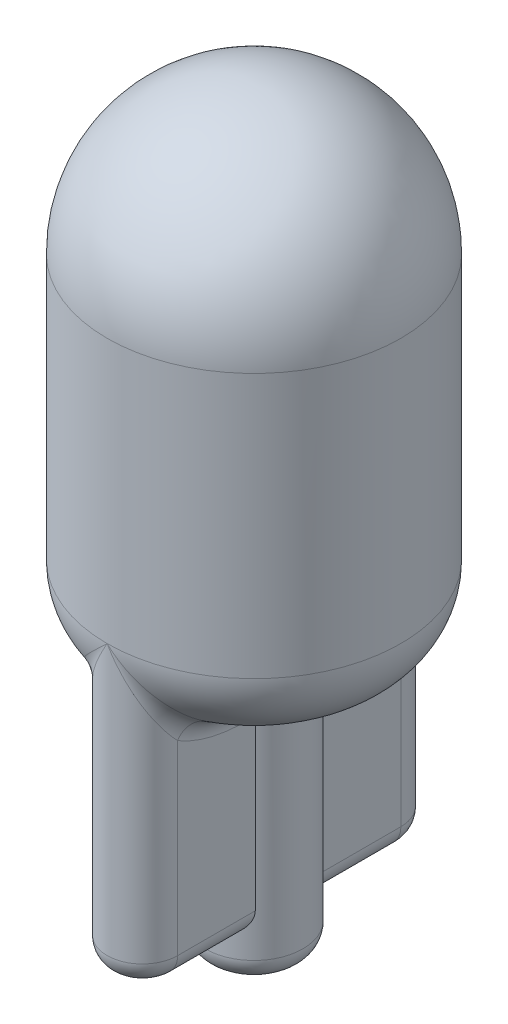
ISO-10303-21;
HEADER;
FILE_DESCRIPTION(('STEP AP214'),'2;1');
FILE_NAME('part.step','',(''),(''),'','','');
FILE_SCHEMA(('AUTOMOTIVE_DESIGN { 1 0 10303 214 1 1 1 1 }'));
ENDSEC;
DATA;
#1=APPLICATION_CONTEXT('core data for automotive mechanical design processes');
#2=APPLICATION_PROTOCOL_DEFINITION('international standard','automotive_design',2000,#1);
#3=PRODUCT_CONTEXT('',#1,'mechanical');
#4=PRODUCT('Part','Part','',(#3));
#5=PRODUCT_RELATED_PRODUCT_CATEGORY('part','',(#4));
#6=PRODUCT_DEFINITION_FORMATION('','',#4);
#7=PRODUCT_DEFINITION_CONTEXT('part definition',#1,'design');
#8=PRODUCT_DEFINITION('design','',#6,#7);
#9=PRODUCT_DEFINITION_SHAPE('','',#8);
#10=(LENGTH_UNIT() NAMED_UNIT(*) SI_UNIT(.MILLI.,.METRE.));
#11=(NAMED_UNIT(*) PLANE_ANGLE_UNIT() SI_UNIT($,.RADIAN.));
#12=(NAMED_UNIT(*) SI_UNIT($,.STERADIAN.) SOLID_ANGLE_UNIT());
#13=UNCERTAINTY_MEASURE_WITH_UNIT(LENGTH_MEASURE(1.E-05),#10,'distance_accuracy_value','');
#14=(GEOMETRIC_REPRESENTATION_CONTEXT(3) GLOBAL_UNCERTAINTY_ASSIGNED_CONTEXT((#13)) GLOBAL_UNIT_ASSIGNED_CONTEXT((#10,
#11,#12)) REPRESENTATION_CONTEXT('',''));
#15=CARTESIAN_POINT('',(0.,0.,0.));
#16=DIRECTION('',(0.,0.,1.));
#17=DIRECTION('',(1.,0.,0.));
#18=AXIS2_PLACEMENT_3D('',#15,#16,#17);
#19=CARTESIAN_POINT('',(1.143,-13.335,3.6195));
#20=DIRECTION('',(1.,0.,0.));
#21=DIRECTION('',(0.,0.,-1.));
#22=AXIS2_PLACEMENT_3D('',#19,#20,#21);
#23=PLANE('',#22);
#24=DIRECTION('',(0.,1.,0.));
#25=VECTOR('',#24,1.);
#26=CARTESIAN_POINT('',(1.143,-24.257,-1.10168382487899));
#27=LINE('',#26,#25);
#28=CARTESIAN_POINT('',(1.143,-16.6369275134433,-1.10168382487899));
#29=VERTEX_POINT('',#28);
#30=CARTESIAN_POINT('',(1.143,-22.098,-1.10168382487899));
#31=VERTEX_POINT('',#30);
#32=EDGE_CURVE('E579',#29,#31,#27,.F.);
#33=ORIENTED_EDGE('',*,*,#32,.T.);
#34=DIRECTION('',(0.,0.,1.));
#35=VECTOR('',#34,1.);
#36=CARTESIAN_POINT('',(1.143,-22.098,3.6195));
#37=LINE('',#36,#35);
#38=CARTESIAN_POINT('',(1.143,-22.098,-3.6195));
#39=VERTEX_POINT('',#38);
#40=EDGE_CURVE('E355',#31,#39,#37,.F.);
#41=ORIENTED_EDGE('',*,*,#40,.T.);
#42=DIRECTION('',(0.,-1.,0.));
#43=VECTOR('',#42,1.);
#44=CARTESIAN_POINT('',(1.143,-13.335,-3.6195));
#45=LINE('',#44,#43);
#46=CARTESIAN_POINT('',(1.143,-16.0580257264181,-3.6195));
#47=VERTEX_POINT('',#46);
#48=EDGE_CURVE('E582',#47,#39,#45,.T.);
#49=ORIENTED_EDGE('',*,*,#48,.F.);
#50=CARTESIAN_POINT('',(1.97818988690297,-15.8632527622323,-0.0348000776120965));
#51=CARTESIAN_POINT('',(1.143,-15.782660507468,-0.0349368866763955));
#52=CARTESIAN_POINT('',(1.143,-16.621728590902,-0.0335125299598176));
#53=CARTESIAN_POINT('',(1.97797793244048,-15.8633091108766,-0.0825578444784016));
#54=CARTESIAN_POINT('',(1.143,-15.782972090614,-0.0828728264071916));
#55=CARTESIAN_POINT('',(1.143,-16.621801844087,-0.0795056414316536));
#56=CARTESIAN_POINT('',(1.97730613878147,-15.8634966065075,-0.130288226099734));
#57=CARTESIAN_POINT('',(1.143,-15.7839722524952,-0.130755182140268));
#58=CARTESIAN_POINT('',(1.143,-16.6220455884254,-0.125498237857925));
#59=CARTESIAN_POINT('',(1.97510115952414,-15.8640959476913,-0.225509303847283));
#60=CARTESIAN_POINT('',(1.143,-15.7872247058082,-0.226287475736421));
#61=CARTESIAN_POINT('',(1.143,-16.6228247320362,-0.217479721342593));
#62=CARTESIAN_POINT('',(1.97356799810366,-15.8645077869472,-0.273000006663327));
#63=CARTESIAN_POINT('',(1.143,-15.7894729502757,-0.2738785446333));
#64=CARTESIAN_POINT('',(1.143,-16.6233601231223,-0.263468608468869));
#65=CARTESIAN_POINT('',(1.96776457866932,-15.8660227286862,-0.414820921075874));
#66=CARTESIAN_POINT('',(1.143,-15.7978742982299,-0.415780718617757));
#67=CARTESIAN_POINT('',(1.143,-16.6253295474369,-0.401411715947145));
#68=CARTESIAN_POINT('',(1.96229025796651,-15.8674053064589,-0.508518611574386));
#69=CARTESIAN_POINT('',(1.143,-15.8056681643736,-0.509319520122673));
#70=CARTESIAN_POINT('',(1.143,-16.6271268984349,-0.493360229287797));
#71=CARTESIAN_POINT('',(1.9489177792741,-15.8703181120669,-0.694503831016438));
#72=CARTESIAN_POINT('',(1.143,-15.8238246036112,-0.695044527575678));
#73=CARTESIAN_POINT('',(1.143,-16.6309135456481,-0.678532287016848));
#74=CARTESIAN_POINT('',(1.94098697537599,-15.8718501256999,-0.78675363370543));
#75=CARTESIAN_POINT('',(1.143,-15.8341701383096,-0.786934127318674));
#76=CARTESIAN_POINT('',(1.143,-16.632905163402,-0.77175578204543));
#77=CARTESIAN_POINT('',(1.92377666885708,-15.8741923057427,-0.9681055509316));
#78=CARTESIAN_POINT('',(1.143,-15.8549897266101,-0.967792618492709));
#79=CARTESIAN_POINT('',(1.143,-16.6359499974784,-0.958237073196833));
#80=CARTESIAN_POINT('',(1.91449690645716,-15.8750023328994,-1.05720705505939));
#81=CARTESIAN_POINT('',(1.143,-15.8654456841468,-1.05665027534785));
#82=CARTESIAN_POINT('',(1.143,-16.6370030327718,-1.05149487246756));
#83=CARTESIAN_POINT('',(1.89065865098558,-15.8749964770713,-1.27698070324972));
#84=CARTESIAN_POINT('',(1.143,-15.8892044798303,-1.2757597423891));
#85=CARTESIAN_POINT('',(1.143,-16.6369954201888,-1.28560671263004));
#86=CARTESIAN_POINT('',(1.87582212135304,-15.8731404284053,-1.40567327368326));
#87=CARTESIAN_POINT('',(1.143,-15.9014116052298,-1.40506743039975));
#88=CARTESIAN_POINT('',(1.143,-16.6345825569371,-1.42647337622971));
#89=CARTESIAN_POINT('',(1.84710701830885,-15.8629383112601,-1.65703386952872));
#90=CARTESIAN_POINT('',(1.143,-15.9166705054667,-1.65924548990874));
#91=CARTESIAN_POINT('',(1.143,-16.6213198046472,-1.70786353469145));
#92=CARTESIAN_POINT('',(1.83322837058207,-15.8545927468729,-1.77970236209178));
#93=CARTESIAN_POINT('',(1.143,-15.9198959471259,-1.78440332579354));
#94=CARTESIAN_POINT('',(1.143,-16.6104705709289,-1.84838705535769));
#95=CARTESIAN_POINT('',(1.80729429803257,-15.829367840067,-2.01891706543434));
#96=CARTESIAN_POINT('',(1.143,-15.9146388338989,-2.0300325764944));
#97=CARTESIAN_POINT('',(1.143,-16.577678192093,-2.12706957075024));
#98=CARTESIAN_POINT('',(1.79522527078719,-15.8125567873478,-2.13550415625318));
#99=CARTESIAN_POINT('',(1.143,-15.9064175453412,-2.1508578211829));
#100=CARTESIAN_POINT('',(1.143,-16.5558238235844,-2.2652384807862));
#101=CARTESIAN_POINT('',(1.77293543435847,-15.7689955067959,-2.36366621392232));
#102=CARTESIAN_POINT('',(1.143,-15.8771171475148,-2.38857510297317));
#103=CARTESIAN_POINT('',(1.143,-16.4991941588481,-2.53887224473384));
#104=CARTESIAN_POINT('',(1.76271358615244,-15.7422508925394,-2.47524397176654));
#105=CARTESIAN_POINT('',(1.143,-15.8561721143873,-2.50578911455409));
#106=CARTESIAN_POINT('',(1.143,-16.4644261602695,-2.67433858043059));
#107=CARTESIAN_POINT('',(1.74339869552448,-15.6758921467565,-2.69988549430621));
#108=CARTESIAN_POINT('',(1.143,-15.7990878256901,-2.74265822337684));
#109=CARTESIAN_POINT('',(1.143,-16.3781597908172,-2.94933703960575));
#110=CARTESIAN_POINT('',(1.73441753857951,-15.6355725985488,-2.81259898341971));
#111=CARTESIAN_POINT('',(1.143,-15.7621475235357,-2.86240775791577));
#112=CARTESIAN_POINT('',(1.143,-16.3257443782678,-3.08858656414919));
#113=CARTESIAN_POINT('',(1.71813524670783,-15.5421810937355,-3.03101837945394));
#114=CARTESIAN_POINT('',(1.143,-15.6729142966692,-3.09514309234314));
#115=CARTESIAN_POINT('',(1.143,-16.2043354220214,-3.36002799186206));
#116=CARTESIAN_POINT('',(1.71083787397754,-15.4890811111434,-3.13670822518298));
#117=CARTESIAN_POINT('',(1.143,-15.6206331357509,-3.2083980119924));
#118=CARTESIAN_POINT('',(1.143,-16.1353054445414,-3.49220359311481));
#119=CARTESIAN_POINT('',(1.6958546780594,-15.3536989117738,-3.36759901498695));
#120=CARTESIAN_POINT('',(1.143,-15.4846459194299,-3.45605734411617));
#121=CARTESIAN_POINT('',(1.143,-15.9593085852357,-3.78210847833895));
#122=CARTESIAN_POINT('',(1.68862263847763,-15.2674076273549,-3.49007940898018));
#123=CARTESIAN_POINT('',(1.143,-15.3960949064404,-3.58833541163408));
#124=CARTESIAN_POINT('',(1.143,-15.8471299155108,-3.93675532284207));
#125=CARTESIAN_POINT('',(1.67919911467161,-15.1236994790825,-3.66053321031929));
#126=CARTESIAN_POINT('',(1.143,-15.2464831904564,-3.7728909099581));
#127=CARTESIAN_POINT('',(1.143,-15.6603093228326,-4.15262917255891));
#128=CARTESIAN_POINT('',(1.67629247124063,-15.0733422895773,-3.71520337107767));
#129=CARTESIAN_POINT('',(1.143,-15.1938433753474,-3.83209108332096));
#130=CARTESIAN_POINT('',(1.143,-15.594844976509,-4.22198525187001));
#131=CARTESIAN_POINT('',(1.67090954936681,-14.9681521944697,-3.81971639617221));
#132=CARTESIAN_POINT('',(1.143,-15.0834040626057,-3.94535074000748));
#133=CARTESIAN_POINT('',(1.143,-15.4580978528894,-4.35474365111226));
#134=CARTESIAN_POINT('',(1.66843340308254,-14.9133179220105,-3.86955777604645));
#135=CARTESIAN_POINT('',(1.143,-15.0255923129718,-3.99944779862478));
#136=CARTESIAN_POINT('',(1.143,-15.3868132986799,-4.41814413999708));
#137=CARTESIAN_POINT('',(1.66614847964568,-14.8563927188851,-3.91680228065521));
#138=CARTESIAN_POINT('',(1.143,-14.9653160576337,-4.05080213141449));
#139=CARTESIAN_POINT('',(1.143,-15.3128105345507,-4.47829736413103));
#140=(BOUNDED_SURFACE() B_SPLINE_SURFACE(3,2,((#50,#51,#52),(#53,#54,#55),(#56,#57,#58),(#59,
#60,#61),(#62,#63,#64),(#65,#66,#67),(#68,#69,#70),(#71,#72,#73),(#74,#75,#76),(#77,#78,#79),
(#80,#81,#82),(#83,#84,#85),(#86,#87,#88),(#89,#90,#91),(#92,#93,#94),(#95,#96,#97),(#98,#99,
#100),(#101,#102,#103),(#104,#105,#106),(#107,#108,#109),(#110,#111,#112),(#113,#114,#115),
(#116,#117,#118),(#119,#120,#121),(#122,#123,#124),(#125,#126,#127),(#128,#129,#130),(#131,#132,
#133),(#134,#135,#136),(#137,#138,#139)),.UNSPECIFIED.,.F.,.F.,
.F.) B_SPLINE_SURFACE_WITH_KNOTS((4,2,2,2,2,2,2,2,2,2,2,2,2,2,4),(3,3),(0.,0.137978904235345,
0.275953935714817,0.551850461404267,0.831583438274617,1.11137035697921,1.53387866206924,
1.95635415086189,2.37547492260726,2.79435920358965,3.23966788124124,3.68596211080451,
4.25605852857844,4.54186222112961,4.8277534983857),(0.,1.),
.UNSPECIFIED.) GEOMETRIC_REPRESENTATION_ITEM() RATIONAL_B_SPLINE_SURFACE(((1.,0.672290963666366,
1.),(1.,0.672394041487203,1.),(1.,0.672722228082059,1.),(1.,0.673796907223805,1.),(1.,
0.674543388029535,1.),(1.,0.677362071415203,1.),(1.,0.680013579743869,1.),(1.,0.686434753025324,
1.),(1.,0.690219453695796,1.),(1.,0.698352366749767,1.),(1.,0.702700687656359,1.),(1.,
0.713760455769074,1.),(1.,0.720545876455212,1.),(1.,0.733505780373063,1.),(1.,0.739680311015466,
1.),(1.,0.75109505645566,1.),(1.,0.756342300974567,1.),(1.,0.765950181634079,1.),(1.,
0.770311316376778,1.),(1.,0.778495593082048,1.),(1.,0.78226744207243,1.),(1.,0.789066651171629,
1.),(1.,0.792092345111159,1.),(1.,0.7982772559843,1.),(1.,0.801240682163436,1.),(1.,
0.805086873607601,1.),(1.,0.806270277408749,1.),(1.,0.808457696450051,1.),(1.,0.809461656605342,
1.),(1.,0.810386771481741,1.))) REPRESENTATION_ITEM('') SURFACE());
#141=CARTESIAN_POINT('',(1.143,-15.3128105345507,-4.47829736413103));
#142=CARTESIAN_POINT('',(1.143,-15.3868132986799,-4.41814413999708));
#143=CARTESIAN_POINT('',(1.143,-15.4580978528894,-4.35474365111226));
#144=CARTESIAN_POINT('',(1.143,-15.594844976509,-4.22198525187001));
#145=CARTESIAN_POINT('',(1.143,-15.6603093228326,-4.15262917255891));
#146=CARTESIAN_POINT('',(1.143,-15.8471299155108,-3.93675532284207));
#147=CARTESIAN_POINT('',(1.143,-15.9593085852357,-3.78210847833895));
#148=CARTESIAN_POINT('',(1.143,-16.1353054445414,-3.49220359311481));
#149=CARTESIAN_POINT('',(1.143,-16.2043354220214,-3.36002799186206));
#150=CARTESIAN_POINT('',(1.143,-16.3257443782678,-3.08858656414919));
#151=CARTESIAN_POINT('',(1.143,-16.3781597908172,-2.94933703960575));
#152=CARTESIAN_POINT('',(1.143,-16.4644261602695,-2.67433858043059));
#153=CARTESIAN_POINT('',(1.143,-16.4991941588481,-2.53887224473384));
#154=CARTESIAN_POINT('',(1.143,-16.5558238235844,-2.2652384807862));
#155=CARTESIAN_POINT('',(1.143,-16.577678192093,-2.12706957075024));
#156=CARTESIAN_POINT('',(1.143,-16.6104705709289,-1.84838705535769));
#157=CARTESIAN_POINT('',(1.143,-16.6213198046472,-1.70786353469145));
#158=CARTESIAN_POINT('',(1.143,-16.6345825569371,-1.42647337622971));
#159=CARTESIAN_POINT('',(1.143,-16.6369954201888,-1.28560671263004));
#160=CARTESIAN_POINT('',(1.143,-16.6370030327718,-1.05149487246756));
#161=CARTESIAN_POINT('',(1.143,-16.6359499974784,-0.958237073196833));
#162=CARTESIAN_POINT('',(1.143,-16.632905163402,-0.77175578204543));
#163=CARTESIAN_POINT('',(1.143,-16.6309135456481,-0.678532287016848));
#164=CARTESIAN_POINT('',(1.143,-16.6271268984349,-0.493360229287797));
#165=CARTESIAN_POINT('',(1.143,-16.6253295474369,-0.401411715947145));
#166=CARTESIAN_POINT('',(1.143,-16.6233601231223,-0.263468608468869));
#167=CARTESIAN_POINT('',(1.143,-16.6228247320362,-0.217479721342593));
#168=CARTESIAN_POINT('',(1.143,-16.6220455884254,-0.125498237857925));
#169=CARTESIAN_POINT('',(1.143,-16.621801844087,-0.0795056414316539));
#170=CARTESIAN_POINT('',(1.143,-16.621728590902,-0.0335125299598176));
#171=B_SPLINE_CURVE_WITH_KNOTS('',3,(#141,#142,#143,#144,#145,#146,#147,#148,#149,#150,#151,
#152,#153,#154,#155,#156,#157,#158,#159,#160,#161,#162,#163,#164,#165,#166,#167,#168,#169,#170),
.UNSPECIFIED.,.F.,.F.,(4,2,2,2,2,2,2,2,2,2,2,2,2,2,4),(0.,0.285891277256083,0.571694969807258,
1.14179138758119,1.58808561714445,2.03339429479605,2.45227857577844,2.87139934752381,
3.29387483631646,3.71638314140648,3.99617006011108,4.27590303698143,4.55179956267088,
4.68977459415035,4.8277534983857),.UNSPECIFIED.);
#172=EDGE_CURVE('E349',#47,#29,#171,.T.);
#173=ORIENTED_EDGE('',*,*,#172,.T.);
#174=EDGE_LOOP('',(#33,#41,#49,#173));
#175=FACE_BOUND('',#174,.T.);
#176=ADVANCED_FACE('F35',(#175),#23,.T.);
#177=DIRECTION('',(0.,-1.,0.));
#178=VECTOR('',#177,1.);
#179=CARTESIAN_POINT('',(1.143,-13.335,3.6195));
#180=LINE('',#179,#178);
#181=CARTESIAN_POINT('',(1.143,-16.0580257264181,3.6195));
#182=VERTEX_POINT('',#181);
#183=CARTESIAN_POINT('',(1.143,-22.098,3.6195));
#184=VERTEX_POINT('',#183);
#185=EDGE_CURVE('E194',#182,#184,#180,.T.);
#186=ORIENTED_EDGE('',*,*,#185,.T.);
#187=DIRECTION('',(0.,0.,1.));
#188=VECTOR('',#187,1.);
#189=CARTESIAN_POINT('',(1.143,-22.098,3.6195));
#190=LINE('',#189,#188);
#191=CARTESIAN_POINT('',(1.143,-22.098,1.10168382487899));
#192=VERTEX_POINT('',#191);
#193=EDGE_CURVE('E378',#184,#192,#190,.F.);
#194=ORIENTED_EDGE('',*,*,#193,.T.);
#195=DIRECTION('',(0.,1.,0.));
#196=VECTOR('',#195,1.);
#197=CARTESIAN_POINT('',(1.143,-24.257,1.10168382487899));
#198=LINE('',#197,#196);
#199=CARTESIAN_POINT('',(1.143,-16.6369275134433,1.10168382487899));
#200=VERTEX_POINT('',#199);
#201=EDGE_CURVE('E596',#192,#200,#198,.T.);
#202=ORIENTED_EDGE('',*,*,#201,.T.);
#203=CARTESIAN_POINT('',(1.66614847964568,-14.8563927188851,3.91680228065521));
#204=CARTESIAN_POINT('',(1.143,-14.9653160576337,4.05080213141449));
#205=CARTESIAN_POINT('',(1.143,-15.3128105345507,4.47829736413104));
#206=CARTESIAN_POINT('',(1.66843521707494,-14.9133654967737,3.86952028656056));
#207=CARTESIAN_POINT('',(1.143,-15.0256429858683,3.99940724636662));
#208=CARTESIAN_POINT('',(1.143,-15.3868751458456,4.41809657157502));
#209=CARTESIAN_POINT('',(1.67091372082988,-14.9682455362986,3.81963249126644));
#210=CARTESIAN_POINT('',(1.143,-15.0835027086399,3.94525968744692));
#211=CARTESIAN_POINT('',(1.143,-15.4582191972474,4.35463700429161));
#212=CARTESIAN_POINT('',(1.67630171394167,-15.0735110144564,3.71502686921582));
#213=CARTESIAN_POINT('',(1.143,-15.1940201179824,3.83189966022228));
#214=CARTESIAN_POINT('',(1.143,-15.595064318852,4.22176111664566));
#215=CARTESIAN_POINT('',(1.67921100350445,-15.1238985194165,3.66031128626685));
#216=CARTESIAN_POINT('',(1.143,-15.246690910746,3.77265029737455));
#217=CARTESIAN_POINT('',(1.143,-15.6605680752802,4.15234756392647));
#218=CARTESIAN_POINT('',(1.68863364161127,-15.2675400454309,3.48989415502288));
#219=CARTESIAN_POINT('',(1.143,-15.3962306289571,3.58813677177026));
#220=CARTESIAN_POINT('',(1.143,-15.8473020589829,3.93652181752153));
#221=CARTESIAN_POINT('',(1.69585979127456,-15.3537463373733,3.36752715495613));
#222=CARTESIAN_POINT('',(1.143,-15.484694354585,3.45598457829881));
#223=CARTESIAN_POINT('',(1.143,-15.9593702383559,3.78202029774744));
#224=CARTESIAN_POINT('',(1.71265081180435,-15.5054608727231,3.10876395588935));
#225=CARTESIAN_POINT('',(1.143,-15.6372290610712,3.17815801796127));
#226=CARTESIAN_POINT('',(1.143,-16.1565991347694,3.45711491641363));
#227=CARTESIAN_POINT('',(1.72221373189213,-15.570986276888,2.97237951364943));
#228=CARTESIAN_POINT('',(1.143,-15.7013026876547,3.03201778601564));
#229=CARTESIAN_POINT('',(1.143,-16.241782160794,3.28672439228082));
#230=CARTESIAN_POINT('',(1.74422987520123,-15.6813101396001,2.68853355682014));
#231=CARTESIAN_POINT('',(1.143,-15.8044902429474,2.73032775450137));
#232=CARTESIAN_POINT('',(1.143,-16.3852031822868,2.93523714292));
#233=CARTESIAN_POINT('',(1.75668014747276,-15.7261296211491,2.54108345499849));
#234=CARTESIAN_POINT('',(1.143,-15.8435058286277,2.57416775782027));
#235=CARTESIAN_POINT('',(1.143,-16.4434685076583,2.75415148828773));
#236=CARTESIAN_POINT('',(1.77968277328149,-15.7835449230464,2.29328492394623));
#237=CARTESIAN_POINT('',(1.143,-15.8874934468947,2.31535512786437));
#238=CARTESIAN_POINT('',(1.143,-16.5181083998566,2.45418985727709));
#239=CARTESIAN_POINT('',(1.78923305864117,-15.8019277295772,2.19569357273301));
#240=CARTESIAN_POINT('',(1.143,-15.8997168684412,2.21356427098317));
#241=CARTESIAN_POINT('',(1.143,-16.5420060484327,2.33708551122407));
#242=CARTESIAN_POINT('',(1.80966190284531,-15.8318632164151,1.99686733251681));
#243=CARTESIAN_POINT('',(1.143,-15.9153449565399,2.00770614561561));
#244=CARTESIAN_POINT('',(1.143,-16.5809221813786,2.10140386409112));
#245=CARTESIAN_POINT('',(1.82054060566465,-15.8434151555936,1.89563204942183));
#246=CARTESIAN_POINT('',(1.143,-15.9186572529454,1.90343071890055));
#247=CARTESIAN_POINT('',(1.143,-16.5959397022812,1.9828264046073));
#248=CARTESIAN_POINT('',(1.84347501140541,-15.8607665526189,1.6888146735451));
#249=CARTESIAN_POINT('',(1.143,-15.9175381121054,1.69204884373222));
#250=CARTESIAN_POINT('',(1.143,-16.618496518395,1.74443445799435));
#251=CARTESIAN_POINT('',(1.85553606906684,-15.8665383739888,1.58321418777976));
#252=CARTESIAN_POINT('',(1.143,-15.9129599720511,1.58472947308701));
#253=CARTESIAN_POINT('',(1.143,-16.6259998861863,1.62461676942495));
#254=CARTESIAN_POINT('',(1.88018709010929,-15.8736543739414,1.36751655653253));
#255=CARTESIAN_POINT('',(1.143,-15.8978041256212,1.36704898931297));
#256=CARTESIAN_POINT('',(1.143,-16.635250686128,1.38478292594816));
#257=CARTESIAN_POINT('',(1.89277709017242,-15.8749982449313,1.2574190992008));
#258=CARTESIAN_POINT('',(1.143,-15.8871240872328,1.25652670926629));
#259=CARTESIAN_POINT('',(1.143,-16.6369977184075,1.2647667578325));
#260=CARTESIAN_POINT('',(1.91448039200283,-15.8750013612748,1.05738330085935));
#261=CARTESIAN_POINT('',(1.143,-15.8654615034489,1.05683325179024));
#262=CARTESIAN_POINT('',(1.143,-16.6370017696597,1.05168427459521));
#263=CARTESIAN_POINT('',(1.92373994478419,-15.8741953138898,0.968464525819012));
#264=CARTESIAN_POINT('',(1.143,-15.8550311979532,0.968153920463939));
#265=CARTESIAN_POINT('',(1.143,-16.6359539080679,0.958613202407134));
#266=CARTESIAN_POINT('',(1.9409204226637,-15.8718611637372,0.787482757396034));
#267=CARTESIAN_POINT('',(1.143,-15.8342540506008,0.787662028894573));
#268=CARTESIAN_POINT('',(1.143,-16.6329195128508,0.772498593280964));
#269=CARTESIAN_POINT('',(1.94884148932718,-15.8703331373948,0.695420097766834));
#270=CARTESIAN_POINT('',(1.143,-15.823925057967,0.695959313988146));
#271=CARTESIAN_POINT('',(1.143,-16.6309330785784,0.679455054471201));
#272=CARTESIAN_POINT('',(1.96223355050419,-15.8674192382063,0.509447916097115));
#273=CARTESIAN_POINT('',(1.143,-15.8057480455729,0.510246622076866));
#274=CARTESIAN_POINT('',(1.143,-16.6271450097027,0.494275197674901));
#275=CARTESIAN_POINT('',(1.96772777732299,-15.8660321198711,0.415565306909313));
#276=CARTESIAN_POINT('',(1.143,-15.7979270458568,0.416524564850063));
#277=CARTESIAN_POINT('',(1.143,-16.6253417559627,0.402138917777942));
#278=CARTESIAN_POINT('',(1.97355217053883,-15.864512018,0.273463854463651));
#279=CARTESIAN_POINT('',(1.143,-15.7894961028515,0.274343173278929));
#280=CARTESIAN_POINT('',(1.143,-16.623365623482,0.263918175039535));
#281=CARTESIAN_POINT('',(1.97509082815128,-15.864098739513,0.225881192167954));
#282=CARTESIAN_POINT('',(1.143,-15.7872398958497,0.226660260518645));
#283=CARTESIAN_POINT('',(1.143,-16.6228283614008,0.217839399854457));
#284=CARTESIAN_POINT('',(1.97730354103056,-15.8634973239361,0.130474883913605));
#285=CARTESIAN_POINT('',(1.143,-15.7839761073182,0.130942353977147));
#286=CARTESIAN_POINT('',(1.143,-16.6220465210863,0.125678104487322));
#287=CARTESIAN_POINT('',(1.97797757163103,-15.8633091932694,0.0826512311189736));
#288=CARTESIAN_POINT('',(1.143,-15.7829726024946,0.0829665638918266));
#289=CARTESIAN_POINT('',(1.143,-16.6218019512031,0.0795955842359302));
#290=CARTESIAN_POINT('',(1.97818988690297,-15.8632527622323,0.0348000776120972));
#291=CARTESIAN_POINT('',(1.143,-15.782660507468,0.0349368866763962));
#292=CARTESIAN_POINT('',(1.143,-16.621728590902,0.0335125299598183));
#293=(BOUNDED_SURFACE() B_SPLINE_SURFACE(3,2,((#203,#204,#205),(#206,#207,#208),(#209,#210,
#211),(#212,#213,#214),(#215,#216,#217),(#218,#219,#220),(#221,#222,#223),(#224,#225,#226),
(#227,#228,#229),(#230,#231,#232),(#233,#234,#235),(#236,#237,#238),(#239,#240,#241),(#242,#243,
#244),(#245,#246,#247),(#248,#249,#250),(#251,#252,#253),(#254,#255,#256),(#257,#258,#259),
(#260,#261,#262),(#263,#264,#265),(#266,#267,#268),(#269,#270,#271),(#272,#273,#274),(#275,#276,
#277),(#278,#279,#280),(#281,#282,#283),(#284,#285,#286),(#287,#288,#289),(#290,#291,#292)),
.UNSPECIFIED.,.F.,.F.,.F.) B_SPLINE_SURFACE_WITH_KNOTS((4,2,2,2,2,2,2,2,2,2,2,2,2,2,4),(3,3),
(0.,0.28613591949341,0.572139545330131,1.14179255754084,1.71097162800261,2.27957152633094,
2.63780066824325,2.99606866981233,3.35604159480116,3.71603952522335,3.99526284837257,
4.27445662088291,4.55091644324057,4.68916119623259,4.82740989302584),(0.,1.),
.UNSPECIFIED.) GEOMETRIC_REPRESENTATION_ITEM() RATIONAL_B_SPLINE_SURFACE(((1.,0.810386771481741,
1.),(1.,0.809460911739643,1.),(1.,0.808455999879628,1.),(1.,0.806266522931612,1.),(1.,
0.805082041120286,1.),(1.,0.801236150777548,1.),(1.,0.798275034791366,1.),(1.,0.791344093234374,
1.),(1.,0.787375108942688,1.),(1.,0.778147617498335,1.),(1.,0.772890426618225,1.),(1.,
0.763048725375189,1.),(1.,0.758934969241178,1.),(1.,0.750051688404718,1.),(1.,0.745282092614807,
1.),(1.,0.735116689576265,1.),(1.,0.72971801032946,1.),(1.,0.718548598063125,1.),(1.,
0.712777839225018,1.),(1.,0.702708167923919,1.),(1.,0.698369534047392,1.),(1.,0.690251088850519,
1.),(1.,0.686471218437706,1.),(1.,0.680040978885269,1.),(1.,0.677379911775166,1.),(1.,
0.674551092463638,1.),(1.,0.673801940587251,1.),(1.,0.672723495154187,1.),(1.,0.672394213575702,
1.),(1.,0.672290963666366,1.))) REPRESENTATION_ITEM('') SURFACE());
#294=CARTESIAN_POINT('',(1.143,-16.621728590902,0.0335125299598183));
#295=CARTESIAN_POINT('',(1.143,-16.6218019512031,0.0795955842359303));
#296=CARTESIAN_POINT('',(1.143,-16.6220465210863,0.125678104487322));
#297=CARTESIAN_POINT('',(1.143,-16.6228283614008,0.217839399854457));
#298=CARTESIAN_POINT('',(1.143,-16.623365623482,0.263918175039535));
#299=CARTESIAN_POINT('',(1.143,-16.6253417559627,0.402138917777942));
#300=CARTESIAN_POINT('',(1.143,-16.6271450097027,0.494275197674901));
#301=CARTESIAN_POINT('',(1.143,-16.6309330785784,0.679455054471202));
#302=CARTESIAN_POINT('',(1.143,-16.6329195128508,0.772498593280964));
#303=CARTESIAN_POINT('',(1.143,-16.6359539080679,0.958613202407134));
#304=CARTESIAN_POINT('',(1.143,-16.6370017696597,1.05168427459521));
#305=CARTESIAN_POINT('',(1.143,-16.6369977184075,1.2647667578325));
#306=CARTESIAN_POINT('',(1.143,-16.635250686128,1.38478292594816));
#307=CARTESIAN_POINT('',(1.143,-16.6259998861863,1.62461676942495));
#308=CARTESIAN_POINT('',(1.143,-16.618496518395,1.74443445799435));
#309=CARTESIAN_POINT('',(1.143,-16.5959397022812,1.9828264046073));
#310=CARTESIAN_POINT('',(1.143,-16.5809221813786,2.10140386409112));
#311=CARTESIAN_POINT('',(1.143,-16.5420060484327,2.33708551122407));
#312=CARTESIAN_POINT('',(1.143,-16.5181083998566,2.45418985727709));
#313=CARTESIAN_POINT('',(1.143,-16.4434685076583,2.75415148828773));
#314=CARTESIAN_POINT('',(1.143,-16.3852031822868,2.93523714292));
#315=CARTESIAN_POINT('',(1.143,-16.241782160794,3.28672439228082));
#316=CARTESIAN_POINT('',(1.143,-16.1565991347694,3.45711491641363));
#317=CARTESIAN_POINT('',(1.143,-15.9593702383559,3.78202029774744));
#318=CARTESIAN_POINT('',(1.143,-15.8473020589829,3.93652181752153));
#319=CARTESIAN_POINT('',(1.143,-15.6605680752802,4.15234756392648));
#320=CARTESIAN_POINT('',(1.143,-15.595064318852,4.22176111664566));
#321=CARTESIAN_POINT('',(1.143,-15.4582191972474,4.35463700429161));
#322=CARTESIAN_POINT('',(1.143,-15.3868751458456,4.41809657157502));
#323=CARTESIAN_POINT('',(1.143,-15.3128105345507,4.47829736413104));
#324=B_SPLINE_CURVE_WITH_KNOTS('',3,(#294,#295,#296,#297,#298,#299,#300,#301,#302,#303,#304,
#305,#306,#307,#308,#309,#310,#311,#312,#313,#314,#315,#316,#317,#318,#319,#320,#321,#322,#323),
.UNSPECIFIED.,.F.,.F.,(4,2,2,2,2,2,2,2,2,2,2,2,2,2,4),(0.,0.138248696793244,0.276493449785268,
0.552953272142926,0.832147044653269,1.11137036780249,1.47136829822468,1.83134122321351,
2.18960922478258,2.54783836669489,3.11643826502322,3.685617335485,4.2552703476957,
4.54127397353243,4.82740989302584),.UNSPECIFIED.);
#325=EDGE_CURVE('E371',#200,#182,#324,.T.);
#326=ORIENTED_EDGE('',*,*,#325,.T.);
#327=EDGE_LOOP('',(#186,#194,#202,#326));
#328=FACE_BOUND('',#327,.T.);
#329=ADVANCED_FACE('F362',(#328),#23,.T.);
#330=CARTESIAN_POINT('',(-1.143,-13.335,3.6195));
#331=DIRECTION('',(-1.,0.,0.));
#332=DIRECTION('',(0.,0.,1.));
#333=AXIS2_PLACEMENT_3D('',#330,#331,#332);
#334=PLANE('',#333);
#335=DIRECTION('',(0.,-1.,0.));
#336=VECTOR('',#335,1.);
#337=CARTESIAN_POINT('',(-1.143,-13.335,3.6195));
#338=LINE('',#337,#336);
#339=CARTESIAN_POINT('',(-1.143,-16.0580257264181,3.6195));
#340=VERTEX_POINT('',#339);
#341=CARTESIAN_POINT('',(-1.143,-22.098,3.6195));
#342=VERTEX_POINT('',#341);
#343=EDGE_CURVE('E602',#340,#342,#338,.T.);
#344=ORIENTED_EDGE('',*,*,#343,.F.);
#345=CARTESIAN_POINT('',(-1.97818988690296,-15.8632527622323,0.0348000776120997));
#346=CARTESIAN_POINT('',(-1.143,-15.782660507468,0.0349368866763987));
#347=CARTESIAN_POINT('',(-1.143,-16.621728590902,0.0335125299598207));
#348=CARTESIAN_POINT('',(-1.97797793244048,-15.8633091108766,0.0825578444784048));
#349=CARTESIAN_POINT('',(-1.143,-15.782972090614,0.082872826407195));
#350=CARTESIAN_POINT('',(-1.143,-16.621801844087,0.0795056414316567));
#351=CARTESIAN_POINT('',(-1.97730613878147,-15.8634966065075,0.130288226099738));
#352=CARTESIAN_POINT('',(-1.143,-15.7839722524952,0.130755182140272));
#353=CARTESIAN_POINT('',(-1.143,-16.6220455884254,0.125498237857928));
#354=CARTESIAN_POINT('',(-1.97510115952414,-15.8640959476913,0.225509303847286));
#355=CARTESIAN_POINT('',(-1.143,-15.7872247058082,0.226287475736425));
#356=CARTESIAN_POINT('',(-1.143,-16.6228247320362,0.217479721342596));
#357=CARTESIAN_POINT('',(-1.97356799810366,-15.8645077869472,0.27300000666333));
#358=CARTESIAN_POINT('',(-1.143,-15.7894729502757,0.273878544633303));
#359=CARTESIAN_POINT('',(-1.143,-16.6233601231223,0.263468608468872));
#360=CARTESIAN_POINT('',(-1.96776457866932,-15.8660227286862,0.414820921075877));
#361=CARTESIAN_POINT('',(-1.143,-15.7978742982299,0.415780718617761));
#362=CARTESIAN_POINT('',(-1.143,-16.6253295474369,0.401411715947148));
#363=CARTESIAN_POINT('',(-1.96229025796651,-15.8674053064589,0.508518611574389));
#364=CARTESIAN_POINT('',(-1.143,-15.8056681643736,0.509319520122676));
#365=CARTESIAN_POINT('',(-1.143,-16.6271268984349,0.493360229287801));
#366=CARTESIAN_POINT('',(-1.9489177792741,-15.8703181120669,0.694503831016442));
#367=CARTESIAN_POINT('',(-1.143,-15.8238246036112,0.695044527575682));
#368=CARTESIAN_POINT('',(-1.143,-16.6309135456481,0.678532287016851));
#369=CARTESIAN_POINT('',(-1.94098697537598,-15.8718501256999,0.786753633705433));
#370=CARTESIAN_POINT('',(-1.143,-15.8341701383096,0.786934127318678));
#371=CARTESIAN_POINT('',(-1.143,-16.632905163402,0.771755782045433));
#372=CARTESIAN_POINT('',(-1.92377666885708,-15.8741923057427,0.968105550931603));
#373=CARTESIAN_POINT('',(-1.143,-15.8549897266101,0.967792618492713));
#374=CARTESIAN_POINT('',(-1.143,-16.6359499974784,0.958237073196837));
#375=CARTESIAN_POINT('',(-1.91449690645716,-15.8750023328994,1.0572070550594));
#376=CARTESIAN_POINT('',(-1.143,-15.8654456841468,1.05665027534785));
#377=CARTESIAN_POINT('',(-1.143,-16.6370030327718,1.05149487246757));
#378=CARTESIAN_POINT('',(-1.89065865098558,-15.8749964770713,1.27698070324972));
#379=CARTESIAN_POINT('',(-1.143,-15.8892044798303,1.27575974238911));
#380=CARTESIAN_POINT('',(-1.143,-16.6369954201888,1.28560671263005));
#381=CARTESIAN_POINT('',(-1.87582212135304,-15.8731404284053,1.40567327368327));
#382=CARTESIAN_POINT('',(-1.143,-15.9014116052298,1.40506743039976));
#383=CARTESIAN_POINT('',(-1.143,-16.6345825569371,1.42647337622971));
#384=CARTESIAN_POINT('',(-1.84710701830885,-15.8629383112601,1.65703386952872));
#385=CARTESIAN_POINT('',(-1.143,-15.9166705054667,1.65924548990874));
#386=CARTESIAN_POINT('',(-1.143,-16.6213198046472,1.70786353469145));
#387=CARTESIAN_POINT('',(-1.83322837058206,-15.8545927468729,1.77970236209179));
#388=CARTESIAN_POINT('',(-1.143,-15.9198959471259,1.78440332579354));
#389=CARTESIAN_POINT('',(-1.143,-16.6104705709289,1.84838705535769));
#390=CARTESIAN_POINT('',(-1.80729429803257,-15.829367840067,2.01891706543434));
#391=CARTESIAN_POINT('',(-1.143,-15.9146388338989,2.0300325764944));
#392=CARTESIAN_POINT('',(-1.143,-16.577678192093,2.12706957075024));
#393=CARTESIAN_POINT('',(-1.79522527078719,-15.8125567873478,2.13550415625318));
#394=CARTESIAN_POINT('',(-1.143,-15.9064175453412,2.1508578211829));
#395=CARTESIAN_POINT('',(-1.143,-16.5558238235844,2.2652384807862));
#396=CARTESIAN_POINT('',(-1.77293543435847,-15.7689955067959,2.36366621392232));
#397=CARTESIAN_POINT('',(-1.143,-15.8771171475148,2.38857510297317));
#398=CARTESIAN_POINT('',(-1.143,-16.4991941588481,2.53887224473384));
#399=CARTESIAN_POINT('',(-1.76271358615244,-15.7422508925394,2.47524397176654));
#400=CARTESIAN_POINT('',(-1.143,-15.8561721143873,2.50578911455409));
#401=CARTESIAN_POINT('',(-1.143,-16.4644261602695,2.67433858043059));
#402=CARTESIAN_POINT('',(-1.74339869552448,-15.6758921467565,2.69988549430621));
#403=CARTESIAN_POINT('',(-1.143,-15.7990878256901,2.74265822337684));
#404=CARTESIAN_POINT('',(-1.143,-16.3781597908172,2.94933703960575));
#405=CARTESIAN_POINT('',(-1.73441753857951,-15.6355725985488,2.81259898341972));
#406=CARTESIAN_POINT('',(-1.143,-15.7621475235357,2.86240775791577));
#407=CARTESIAN_POINT('',(-1.143,-16.3257443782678,3.0885865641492));
#408=CARTESIAN_POINT('',(-1.71813524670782,-15.5421810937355,3.03101837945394));
#409=CARTESIAN_POINT('',(-1.143,-15.6729142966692,3.09514309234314));
#410=CARTESIAN_POINT('',(-1.143,-16.2043354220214,3.36002799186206));
#411=CARTESIAN_POINT('',(-1.71083787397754,-15.4890811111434,3.13670822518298));
#412=CARTESIAN_POINT('',(-1.143,-15.6206331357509,3.2083980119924));
#413=CARTESIAN_POINT('',(-1.143,-16.1353054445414,3.49220359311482));
#414=CARTESIAN_POINT('',(-1.6958546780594,-15.3536989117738,3.36759901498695));
#415=CARTESIAN_POINT('',(-1.143,-15.4846459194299,3.45605734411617));
#416=CARTESIAN_POINT('',(-1.143,-15.9593085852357,3.78210847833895));
#417=CARTESIAN_POINT('',(-1.68862263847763,-15.2674076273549,3.49007940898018));
#418=CARTESIAN_POINT('',(-1.143,-15.3960949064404,3.58833541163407));
#419=CARTESIAN_POINT('',(-1.143,-15.8471299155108,3.93675532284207));
#420=CARTESIAN_POINT('',(-1.67919911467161,-15.1236994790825,3.66053321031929));
#421=CARTESIAN_POINT('',(-1.143,-15.2464831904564,3.7728909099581));
#422=CARTESIAN_POINT('',(-1.143,-15.6603093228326,4.15262917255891));
#423=CARTESIAN_POINT('',(-1.67629247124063,-15.0733422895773,3.71520337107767));
#424=CARTESIAN_POINT('',(-1.143,-15.1938433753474,3.83209108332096));
#425=CARTESIAN_POINT('',(-1.143,-15.594844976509,4.22198525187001));
#426=CARTESIAN_POINT('',(-1.67090954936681,-14.9681521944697,3.81971639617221));
#427=CARTESIAN_POINT('',(-1.143,-15.0834040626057,3.94535074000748));
#428=CARTESIAN_POINT('',(-1.143,-15.4580978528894,4.35474365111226));
#429=CARTESIAN_POINT('',(-1.66843340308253,-14.9133179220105,3.86955777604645));
#430=CARTESIAN_POINT('',(-1.143,-15.0255923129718,3.99944779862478));
#431=CARTESIAN_POINT('',(-1.143,-15.3868132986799,4.41814413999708));
#432=CARTESIAN_POINT('',(-1.66614847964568,-14.8563927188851,3.91680228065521));
#433=CARTESIAN_POINT('',(-1.143,-14.9653160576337,4.05080213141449));
#434=CARTESIAN_POINT('',(-1.143,-15.3128105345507,4.47829736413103));
#435=(BOUNDED_SURFACE() B_SPLINE_SURFACE(3,2,((#345,#346,#347),(#348,#349,#350),(#351,#352,
#353),(#354,#355,#356),(#357,#358,#359),(#360,#361,#362),(#363,#364,#365),(#366,#367,#368),
(#369,#370,#371),(#372,#373,#374),(#375,#376,#377),(#378,#379,#380),(#381,#382,#383),(#384,#385,
#386),(#387,#388,#389),(#390,#391,#392),(#393,#394,#395),(#396,#397,#398),(#399,#400,#401),
(#402,#403,#404),(#405,#406,#407),(#408,#409,#410),(#411,#412,#413),(#414,#415,#416),(#417,#418,
#419),(#420,#421,#422),(#423,#424,#425),(#426,#427,#428),(#429,#430,#431),(#432,#433,#434)),
.UNSPECIFIED.,.F.,.F.,.F.) B_SPLINE_SURFACE_WITH_KNOTS((4,2,2,2,2,2,2,2,2,2,2,2,2,2,4),(3,3),
(0.,0.137978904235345,0.275953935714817,0.551850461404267,0.831583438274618,1.11137035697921,
1.53387866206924,1.95635415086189,2.37547492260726,2.79435920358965,3.23966788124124,
3.68596211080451,4.25605852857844,4.54186222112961,4.82775349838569),(0.,1.),
.UNSPECIFIED.) GEOMETRIC_REPRESENTATION_ITEM() RATIONAL_B_SPLINE_SURFACE(((1.,0.672290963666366,
1.),(1.,0.672394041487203,1.),(1.,0.672722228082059,1.),(1.,0.673796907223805,1.),(1.,
0.674543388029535,1.),(1.,0.677362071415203,1.),(1.,0.680013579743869,1.),(1.,0.686434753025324,
1.),(1.,0.690219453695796,1.),(1.,0.698352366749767,1.),(1.,0.702700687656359,1.),(1.,
0.713760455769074,1.),(1.,0.720545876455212,1.),(1.,0.733505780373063,1.),(1.,0.739680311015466,
1.),(1.,0.75109505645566,1.),(1.,0.756342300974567,1.),(1.,0.765950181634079,1.),(1.,
0.770311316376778,1.),(1.,0.778495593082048,1.),(1.,0.782267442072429,1.),(1.,0.789066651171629,
1.),(1.,0.792092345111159,1.),(1.,0.7982772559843,1.),(1.,0.801240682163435,1.),(1.,
0.805086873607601,1.),(1.,0.806270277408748,1.),(1.,0.80845769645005,1.),(1.,0.809461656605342,
1.),(1.,0.810386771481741,1.))) REPRESENTATION_ITEM('') SURFACE());
#436=CARTESIAN_POINT('',(-1.143,-15.3128105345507,4.47829736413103));
#437=CARTESIAN_POINT('',(-1.143,-15.3868132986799,4.41814413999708));
#438=CARTESIAN_POINT('',(-1.143,-15.4580978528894,4.35474365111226));
#439=CARTESIAN_POINT('',(-1.143,-15.594844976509,4.22198525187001));
#440=CARTESIAN_POINT('',(-1.143,-15.6603093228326,4.15262917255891));
#441=CARTESIAN_POINT('',(-1.143,-15.8471299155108,3.93675532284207));
#442=CARTESIAN_POINT('',(-1.143,-15.9593085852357,3.78210847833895));
#443=CARTESIAN_POINT('',(-1.143,-16.1353054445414,3.49220359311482));
#444=CARTESIAN_POINT('',(-1.143,-16.2043354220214,3.36002799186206));
#445=CARTESIAN_POINT('',(-1.143,-16.3257443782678,3.0885865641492));
#446=CARTESIAN_POINT('',(-1.143,-16.3781597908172,2.94933703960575));
#447=CARTESIAN_POINT('',(-1.143,-16.4644261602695,2.67433858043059));
#448=CARTESIAN_POINT('',(-1.143,-16.4991941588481,2.53887224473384));
#449=CARTESIAN_POINT('',(-1.143,-16.5558238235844,2.2652384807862));
#450=CARTESIAN_POINT('',(-1.143,-16.577678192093,2.12706957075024));
#451=CARTESIAN_POINT('',(-1.143,-16.6104705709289,1.84838705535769));
#452=CARTESIAN_POINT('',(-1.143,-16.6213198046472,1.70786353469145));
#453=CARTESIAN_POINT('',(-1.143,-16.6345825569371,1.42647337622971));
#454=CARTESIAN_POINT('',(-1.143,-16.6369954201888,1.28560671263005));
#455=CARTESIAN_POINT('',(-1.143,-16.6370030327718,1.05149487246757));
#456=CARTESIAN_POINT('',(-1.143,-16.6359499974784,0.958237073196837));
#457=CARTESIAN_POINT('',(-1.143,-16.632905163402,0.771755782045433));
#458=CARTESIAN_POINT('',(-1.143,-16.6309135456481,0.678532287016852));
#459=CARTESIAN_POINT('',(-1.143,-16.6271268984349,0.493360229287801));
#460=CARTESIAN_POINT('',(-1.143,-16.6253295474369,0.401411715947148));
#461=CARTESIAN_POINT('',(-1.143,-16.6233601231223,0.263468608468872));
#462=CARTESIAN_POINT('',(-1.143,-16.6228247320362,0.217479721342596));
#463=CARTESIAN_POINT('',(-1.143,-16.6220455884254,0.125498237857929));
#464=CARTESIAN_POINT('',(-1.143,-16.621801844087,0.079505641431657));
#465=CARTESIAN_POINT('',(-1.143,-16.621728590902,0.0335125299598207));
#466=B_SPLINE_CURVE_WITH_KNOTS('',3,(#436,#437,#438,#439,#440,#441,#442,#443,#444,#445,#446,
#447,#448,#449,#450,#451,#452,#453,#454,#455,#456,#457,#458,#459,#460,#461,#462,#463,#464,#465),
.UNSPECIFIED.,.F.,.F.,(4,2,2,2,2,2,2,2,2,2,2,2,2,2,4),(0.,0.285891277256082,0.571694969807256,
1.14179138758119,1.58808561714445,2.03339429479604,2.45227857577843,2.8713993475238,
3.29387483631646,3.71638314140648,3.99617006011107,4.27590303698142,4.55179956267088,
4.68977459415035,4.82775349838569),.UNSPECIFIED.);
#467=CARTESIAN_POINT('',(-1.143,-16.6369275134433,1.10168382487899));
#468=VERTEX_POINT('',#467);
#469=EDGE_CURVE('E390',#340,#468,#466,.T.);
#470=ORIENTED_EDGE('',*,*,#469,.T.);
#471=DIRECTION('',(0.,1.,0.));
#472=VECTOR('',#471,1.);
#473=CARTESIAN_POINT('',(-1.143,-24.257,1.10168382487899));
#474=LINE('',#473,#472);
#475=CARTESIAN_POINT('',(-1.143,-22.098,1.10168382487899));
#476=VERTEX_POINT('',#475);
#477=EDGE_CURVE('E587',#468,#476,#474,.F.);
#478=ORIENTED_EDGE('',*,*,#477,.T.);
#479=DIRECTION('',(0.,0.,-1.));
#480=VECTOR('',#479,1.);
#481=CARTESIAN_POINT('',(-1.143,-22.098,3.6195));
#482=LINE('',#481,#480);
#483=EDGE_CURVE('E388',#476,#342,#482,.F.);
#484=ORIENTED_EDGE('',*,*,#483,.T.);
#485=EDGE_LOOP('',(#344,#470,#478,#484));
#486=FACE_BOUND('',#485,.T.);
#487=ADVANCED_FACE('F397',(#486),#334,.T.);
#488=DIRECTION('',(0.,1.,0.));
#489=VECTOR('',#488,1.);
#490=CARTESIAN_POINT('',(-1.143,-24.257,-1.10168382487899));
#491=LINE('',#490,#489);
#492=CARTESIAN_POINT('',(-1.143,-22.098,-1.10168382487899));
#493=VERTEX_POINT('',#492);
#494=CARTESIAN_POINT('',(-1.143,-16.6369275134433,-1.10168382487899));
#495=VERTEX_POINT('',#494);
#496=EDGE_CURVE('E585',#493,#495,#491,.T.);
#497=ORIENTED_EDGE('',*,*,#496,.T.);
#498=CARTESIAN_POINT('',(-1.66614847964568,-14.8563927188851,-3.91680228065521));
#499=CARTESIAN_POINT('',(-1.143,-14.9653160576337,-4.05080213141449));
#500=CARTESIAN_POINT('',(-1.143,-15.3128105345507,-4.47829736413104));
#501=CARTESIAN_POINT('',(-1.66843521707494,-14.9133654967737,-3.86952028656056));
#502=CARTESIAN_POINT('',(-1.143,-15.0256429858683,-3.99940724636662));
#503=CARTESIAN_POINT('',(-1.143,-15.3868751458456,-4.41809657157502));
#504=CARTESIAN_POINT('',(-1.67091372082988,-14.9682455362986,-3.81963249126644));
#505=CARTESIAN_POINT('',(-1.143,-15.0835027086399,-3.94525968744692));
#506=CARTESIAN_POINT('',(-1.143,-15.4582191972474,-4.35463700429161));
#507=CARTESIAN_POINT('',(-1.67630171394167,-15.0735110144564,-3.71502686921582));
#508=CARTESIAN_POINT('',(-1.143,-15.1940201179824,-3.83189966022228));
#509=CARTESIAN_POINT('',(-1.143,-15.595064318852,-4.22176111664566));
#510=CARTESIAN_POINT('',(-1.67921100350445,-15.1238985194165,-3.66031128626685));
#511=CARTESIAN_POINT('',(-1.143,-15.246690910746,-3.77265029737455));
#512=CARTESIAN_POINT('',(-1.143,-15.6605680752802,-4.15234756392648));
#513=CARTESIAN_POINT('',(-1.68863364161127,-15.2675400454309,-3.48989415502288));
#514=CARTESIAN_POINT('',(-1.143,-15.3962306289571,-3.58813677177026));
#515=CARTESIAN_POINT('',(-1.143,-15.8473020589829,-3.93652181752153));
#516=CARTESIAN_POINT('',(-1.69585979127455,-15.3537463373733,-3.36752715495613));
#517=CARTESIAN_POINT('',(-1.143,-15.484694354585,-3.45598457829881));
#518=CARTESIAN_POINT('',(-1.143,-15.9593702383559,-3.78202029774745));
#519=CARTESIAN_POINT('',(-1.71265081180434,-15.5054608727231,-3.10876395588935));
#520=CARTESIAN_POINT('',(-1.143,-15.6372290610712,-3.17815801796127));
#521=CARTESIAN_POINT('',(-1.143,-16.1565991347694,-3.45711491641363));
#522=CARTESIAN_POINT('',(-1.72221373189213,-15.570986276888,-2.97237951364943));
#523=CARTESIAN_POINT('',(-1.143,-15.7013026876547,-3.03201778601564));
#524=CARTESIAN_POINT('',(-1.143,-16.241782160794,-3.28672439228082));
#525=CARTESIAN_POINT('',(-1.74422987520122,-15.6813101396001,-2.68853355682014));
#526=CARTESIAN_POINT('',(-1.143,-15.8044902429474,-2.73032775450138));
#527=CARTESIAN_POINT('',(-1.143,-16.3852031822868,-2.93523714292));
#528=CARTESIAN_POINT('',(-1.75668014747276,-15.7261296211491,-2.54108345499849));
#529=CARTESIAN_POINT('',(-1.143,-15.8435058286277,-2.57416775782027));
#530=CARTESIAN_POINT('',(-1.143,-16.4434685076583,-2.75415148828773));
#531=CARTESIAN_POINT('',(-1.77968277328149,-15.7835449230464,-2.29328492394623));
#532=CARTESIAN_POINT('',(-1.143,-15.8874934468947,-2.31535512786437));
#533=CARTESIAN_POINT('',(-1.143,-16.5181083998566,-2.45418985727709));
#534=CARTESIAN_POINT('',(-1.78923305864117,-15.8019277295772,-2.19569357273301));
#535=CARTESIAN_POINT('',(-1.143,-15.8997168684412,-2.21356427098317));
#536=CARTESIAN_POINT('',(-1.143,-16.5420060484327,-2.33708551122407));
#537=CARTESIAN_POINT('',(-1.80966190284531,-15.8318632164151,-1.99686733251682));
#538=CARTESIAN_POINT('',(-1.143,-15.9153449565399,-2.00770614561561));
#539=CARTESIAN_POINT('',(-1.143,-16.5809221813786,-2.10140386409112));
#540=CARTESIAN_POINT('',(-1.82054060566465,-15.8434151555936,-1.89563204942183));
#541=CARTESIAN_POINT('',(-1.143,-15.9186572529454,-1.90343071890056));
#542=CARTESIAN_POINT('',(-1.143,-16.5959397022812,-1.9828264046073));
#543=CARTESIAN_POINT('',(-1.84347501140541,-15.8607665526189,-1.6888146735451));
#544=CARTESIAN_POINT('',(-1.143,-15.9175381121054,-1.69204884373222));
#545=CARTESIAN_POINT('',(-1.143,-16.618496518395,-1.74443445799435));
#546=CARTESIAN_POINT('',(-1.85553606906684,-15.8665383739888,-1.58321418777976));
#547=CARTESIAN_POINT('',(-1.143,-15.9129599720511,-1.58472947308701));
#548=CARTESIAN_POINT('',(-1.143,-16.6259998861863,-1.62461676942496));
#549=CARTESIAN_POINT('',(-1.88018709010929,-15.8736543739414,-1.36751655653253));
#550=CARTESIAN_POINT('',(-1.143,-15.8978041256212,-1.36704898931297));
#551=CARTESIAN_POINT('',(-1.143,-16.635250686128,-1.38478292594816));
#552=CARTESIAN_POINT('',(-1.89277709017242,-15.8749982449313,-1.2574190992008));
#553=CARTESIAN_POINT('',(-1.143,-15.8871240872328,-1.2565267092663));
#554=CARTESIAN_POINT('',(-1.143,-16.6369977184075,-1.26476675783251));
#555=CARTESIAN_POINT('',(-1.91448039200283,-15.8750013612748,-1.05738330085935));
#556=CARTESIAN_POINT('',(-1.143,-15.8654615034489,-1.05683325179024));
#557=CARTESIAN_POINT('',(-1.143,-16.6370017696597,-1.05168427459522));
#558=CARTESIAN_POINT('',(-1.92373994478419,-15.8741953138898,-0.968464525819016));
#559=CARTESIAN_POINT('',(-1.143,-15.8550311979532,-0.968153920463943));
#560=CARTESIAN_POINT('',(-1.143,-16.6359539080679,-0.958613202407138));
#561=CARTESIAN_POINT('',(-1.94092042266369,-15.8718611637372,-0.787482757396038));
#562=CARTESIAN_POINT('',(-1.143,-15.8342540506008,-0.787662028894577));
#563=CARTESIAN_POINT('',(-1.143,-16.6329195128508,-0.772498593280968));
#564=CARTESIAN_POINT('',(-1.94884148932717,-15.8703331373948,-0.695420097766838));
#565=CARTESIAN_POINT('',(-1.143,-15.823925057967,-0.69595931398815));
#566=CARTESIAN_POINT('',(-1.143,-16.6309330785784,-0.679455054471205));
#567=CARTESIAN_POINT('',(-1.96223355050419,-15.8674192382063,-0.509447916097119));
#568=CARTESIAN_POINT('',(-1.143,-15.8057480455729,-0.51024662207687));
#569=CARTESIAN_POINT('',(-1.143,-16.6271450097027,-0.494275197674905));
#570=CARTESIAN_POINT('',(-1.96772777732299,-15.8660321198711,-0.415565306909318));
#571=CARTESIAN_POINT('',(-1.143,-15.7979270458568,-0.416524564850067));
#572=CARTESIAN_POINT('',(-1.143,-16.6253417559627,-0.402138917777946));
#573=CARTESIAN_POINT('',(-1.97355217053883,-15.864512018,-0.273463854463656));
#574=CARTESIAN_POINT('',(-1.143,-15.7894961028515,-0.274343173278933));
#575=CARTESIAN_POINT('',(-1.143,-16.623365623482,-0.26391817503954));
#576=CARTESIAN_POINT('',(-1.97509082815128,-15.864098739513,-0.225881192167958));
#577=CARTESIAN_POINT('',(-1.143,-15.7872398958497,-0.226660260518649));
#578=CARTESIAN_POINT('',(-1.143,-16.6228283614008,-0.217839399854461));
#579=CARTESIAN_POINT('',(-1.97730354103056,-15.8634973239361,-0.130474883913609));
#580=CARTESIAN_POINT('',(-1.143,-15.7839761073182,-0.130942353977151));
#581=CARTESIAN_POINT('',(-1.143,-16.6220465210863,-0.125678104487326));
#582=CARTESIAN_POINT('',(-1.97797757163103,-15.8633091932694,-0.0826512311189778));
#583=CARTESIAN_POINT('',(-1.143,-15.7829726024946,-0.082966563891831));
#584=CARTESIAN_POINT('',(-1.143,-16.6218019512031,-0.0795955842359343));
#585=CARTESIAN_POINT('',(-1.97818988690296,-15.8632527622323,-0.0348000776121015));
#586=CARTESIAN_POINT('',(-1.143,-15.782660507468,-0.0349368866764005));
#587=CARTESIAN_POINT('',(-1.143,-16.621728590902,-0.0335125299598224));
#588=(BOUNDED_SURFACE() B_SPLINE_SURFACE(3,2,((#498,#499,#500),(#501,#502,#503),(#504,#505,
#506),(#507,#508,#509),(#510,#511,#512),(#513,#514,#515),(#516,#517,#518),(#519,#520,#521),
(#522,#523,#524),(#525,#526,#527),(#528,#529,#530),(#531,#532,#533),(#534,#535,#536),(#537,#538,
#539),(#540,#541,#542),(#543,#544,#545),(#546,#547,#548),(#549,#550,#551),(#552,#553,#554),
(#555,#556,#557),(#558,#559,#560),(#561,#562,#563),(#564,#565,#566),(#567,#568,#569),(#570,#571,
#572),(#573,#574,#575),(#576,#577,#578),(#579,#580,#581),(#582,#583,#584),(#585,#586,#587)),
.UNSPECIFIED.,.F.,.F.,.F.) B_SPLINE_SURFACE_WITH_KNOTS((4,2,2,2,2,2,2,2,2,2,2,2,2,2,4),(3,3),
(0.,0.286135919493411,0.572139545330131,1.14179255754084,1.71097162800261,2.27957152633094,
2.63780066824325,2.99606866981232,3.35604159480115,3.71603952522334,3.99526284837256,
4.27445662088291,4.55091644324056,4.68916119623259,4.82740989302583),(0.,1.),
.UNSPECIFIED.) GEOMETRIC_REPRESENTATION_ITEM() RATIONAL_B_SPLINE_SURFACE(((1.,0.810386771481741,
1.),(1.,0.809460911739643,1.),(1.,0.808455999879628,1.),(1.,0.806266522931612,1.),(1.,
0.805082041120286,1.),(1.,0.801236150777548,1.),(1.,0.798275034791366,1.),(1.,0.791344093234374,
1.),(1.,0.787375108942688,1.),(1.,0.778147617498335,1.),(1.,0.772890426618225,1.),(1.,
0.763048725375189,1.),(1.,0.758934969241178,1.),(1.,0.750051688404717,1.),(1.,0.745282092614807,
1.),(1.,0.735116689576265,1.),(1.,0.72971801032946,1.),(1.,0.718548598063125,1.),(1.,
0.712777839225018,1.),(1.,0.702708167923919,1.),(1.,0.698369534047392,1.),(1.,0.690251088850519,
1.),(1.,0.686471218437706,1.),(1.,0.680040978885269,1.),(1.,0.677379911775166,1.),(1.,
0.674551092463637,1.),(1.,0.67380194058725,1.),(1.,0.672723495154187,1.),(1.,0.672394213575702,
1.),(1.,0.672290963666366,1.))) REPRESENTATION_ITEM('') SURFACE());
#589=CARTESIAN_POINT('',(-1.143,-16.621728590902,-0.0335125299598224));
#590=CARTESIAN_POINT('',(-1.143,-16.6218019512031,-0.0795955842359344));
#591=CARTESIAN_POINT('',(-1.143,-16.6220465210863,-0.125678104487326));
#592=CARTESIAN_POINT('',(-1.143,-16.6228283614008,-0.217839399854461));
#593=CARTESIAN_POINT('',(-1.143,-16.623365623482,-0.26391817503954));
#594=CARTESIAN_POINT('',(-1.143,-16.6253417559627,-0.402138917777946));
#595=CARTESIAN_POINT('',(-1.143,-16.6271450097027,-0.494275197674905));
#596=CARTESIAN_POINT('',(-1.143,-16.6309330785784,-0.679455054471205));
#597=CARTESIAN_POINT('',(-1.143,-16.6329195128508,-0.772498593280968));
#598=CARTESIAN_POINT('',(-1.143,-16.6359539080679,-0.958613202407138));
#599=CARTESIAN_POINT('',(-1.143,-16.6370017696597,-1.05168427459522));
#600=CARTESIAN_POINT('',(-1.143,-16.6369977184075,-1.2647667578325));
#601=CARTESIAN_POINT('',(-1.143,-16.635250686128,-1.38478292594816));
#602=CARTESIAN_POINT('',(-1.143,-16.6259998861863,-1.62461676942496));
#603=CARTESIAN_POINT('',(-1.143,-16.618496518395,-1.74443445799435));
#604=CARTESIAN_POINT('',(-1.143,-16.5959397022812,-1.9828264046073));
#605=CARTESIAN_POINT('',(-1.143,-16.5809221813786,-2.10140386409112));
#606=CARTESIAN_POINT('',(-1.143,-16.5420060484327,-2.33708551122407));
#607=CARTESIAN_POINT('',(-1.143,-16.5181083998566,-2.45418985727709));
#608=CARTESIAN_POINT('',(-1.143,-16.4434685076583,-2.75415148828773));
#609=CARTESIAN_POINT('',(-1.143,-16.3852031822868,-2.93523714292));
#610=CARTESIAN_POINT('',(-1.143,-16.241782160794,-3.28672439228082));
#611=CARTESIAN_POINT('',(-1.143,-16.1565991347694,-3.45711491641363));
#612=CARTESIAN_POINT('',(-1.143,-15.9593702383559,-3.78202029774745));
#613=CARTESIAN_POINT('',(-1.143,-15.8473020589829,-3.93652181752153));
#614=CARTESIAN_POINT('',(-1.143,-15.6605680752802,-4.15234756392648));
#615=CARTESIAN_POINT('',(-1.143,-15.595064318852,-4.22176111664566));
#616=CARTESIAN_POINT('',(-1.143,-15.4582191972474,-4.35463700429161));
#617=CARTESIAN_POINT('',(-1.143,-15.3868751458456,-4.41809657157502));
#618=CARTESIAN_POINT('',(-1.143,-15.3128105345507,-4.47829736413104));
#619=B_SPLINE_CURVE_WITH_KNOTS('',3,(#589,#590,#591,#592,#593,#594,#595,#596,#597,#598,#599,
#600,#601,#602,#603,#604,#605,#606,#607,#608,#609,#610,#611,#612,#613,#614,#615,#616,#617,#618),
.UNSPECIFIED.,.F.,.F.,(4,2,2,2,2,2,2,2,2,2,2,2,2,2,4),(0.,0.138248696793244,0.276493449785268,
0.552953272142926,0.832147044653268,1.11137036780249,1.47136829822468,1.83134122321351,
2.18960922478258,2.54783836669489,3.11643826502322,3.685617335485,4.2552703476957,
4.54127397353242,4.82740989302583),.UNSPECIFIED.);
#620=CARTESIAN_POINT('',(-1.143,-16.0580257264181,-3.6195));
#621=VERTEX_POINT('',#620);
#622=EDGE_CURVE('E401',#495,#621,#619,.T.);
#623=ORIENTED_EDGE('',*,*,#622,.T.);
#624=DIRECTION('',(0.,-1.,0.));
#625=VECTOR('',#624,1.);
#626=CARTESIAN_POINT('',(-1.143,-13.335,-3.6195));
#627=LINE('',#626,#625);
#628=CARTESIAN_POINT('',(-1.143,-22.098,-3.6195));
#629=VERTEX_POINT('',#628);
#630=EDGE_CURVE('E599',#621,#629,#627,.T.);
#631=ORIENTED_EDGE('',*,*,#630,.T.);
#632=DIRECTION('',(0.,0.,-1.));
#633=VECTOR('',#632,1.);
#634=CARTESIAN_POINT('',(-1.143,-22.098,3.6195));
#635=LINE('',#634,#633);
#636=EDGE_CURVE('E395',#629,#493,#635,.F.);
#637=ORIENTED_EDGE('',*,*,#636,.T.);
#638=EDGE_LOOP('',(#497,#623,#631,#637));
#639=FACE_BOUND('',#638,.T.);
#640=ADVANCED_FACE('F816',(#639),#334,.T.);
#641=CARTESIAN_POINT('',(0.,-22.86,3.6195));
#642=DIRECTION('',(0.,-1.,0.));
#643=DIRECTION('',(0.,0.,-1.));
#644=AXIS2_PLACEMENT_3D('',#641,#642,#643);
#645=PLANE('',#644);
#646=CARTESIAN_POINT('',(0.,-22.86,0.));
#647=DIRECTION('',(0.,-1.,0.));
#648=DIRECTION('',(0.,0.,-1.));
#649=AXIS2_PLACEMENT_3D('',#646,#647,#648);
#650=CIRCLE('',#649,1.5875);
#651=CARTESIAN_POINT('',(-0.381,-22.86,1.54110195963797));
#652=VERTEX_POINT('',#651);
#653=CARTESIAN_POINT('',(0.381000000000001,-22.86,1.54110195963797));
#654=VERTEX_POINT('',#653);
#655=EDGE_CURVE('E606',#652,#654,#650,.F.);
#656=ORIENTED_EDGE('',*,*,#655,.T.);
#657=DIRECTION('',(0.,0.,1.));
#658=VECTOR('',#657,1.);
#659=CARTESIAN_POINT('',(0.381000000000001,-22.86,3.6195));
#660=LINE('',#659,#658);
#661=CARTESIAN_POINT('',(0.381,-22.86,3.6195));
#662=VERTEX_POINT('',#661);
#663=EDGE_CURVE('E379',#654,#662,#660,.T.);
#664=ORIENTED_EDGE('',*,*,#663,.T.);
#665=CARTESIAN_POINT('',(0.,-22.86,3.6195));
#666=DIRECTION('',(0.,-1.,0.));
#667=DIRECTION('',(0.,0.,-1.));
#668=AXIS2_PLACEMENT_3D('',#665,#666,#667);
#669=CIRCLE('',#668,0.381000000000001);
#670=CARTESIAN_POINT('',(-0.381,-22.86,3.6195));
#671=VERTEX_POINT('',#670);
#672=EDGE_CURVE('E466',#662,#671,#669,.T.);
#673=ORIENTED_EDGE('',*,*,#672,.T.);
#674=DIRECTION('',(0.,0.,-1.));
#675=VECTOR('',#674,1.);
#676=CARTESIAN_POINT('',(-0.381,-22.86,3.6195));
#677=LINE('',#676,#675);
#678=EDGE_CURVE('E623',#671,#652,#677,.T.);
#679=ORIENTED_EDGE('',*,*,#678,.T.);
#680=EDGE_LOOP('',(#656,#664,#673,#679));
#681=FACE_BOUND('',#680,.T.);
#682=ADVANCED_FACE('F364',(#681),#645,.T.);
#683=CARTESIAN_POINT('',(0.,-22.86,-3.6195));
#684=DIRECTION('',(0.,-1.,0.));
#685=DIRECTION('',(0.,0.,-1.));
#686=AXIS2_PLACEMENT_3D('',#683,#684,#685);
#687=CIRCLE('',#686,0.381000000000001);
#688=CARTESIAN_POINT('',(-0.381,-22.86,-3.6195));
#689=VERTEX_POINT('',#688);
#690=CARTESIAN_POINT('',(0.381000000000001,-22.86,-3.6195));
#691=VERTEX_POINT('',#690);
#692=EDGE_CURVE('E620',#689,#691,#687,.T.);
#693=ORIENTED_EDGE('',*,*,#692,.T.);
#694=DIRECTION('',(0.,0.,1.));
#695=VECTOR('',#694,1.);
#696=CARTESIAN_POINT('',(0.381000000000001,-22.86,3.6195));
#697=LINE('',#696,#695);
#698=CARTESIAN_POINT('',(0.381000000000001,-22.86,-1.54110195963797));
#699=VERTEX_POINT('',#698);
#700=EDGE_CURVE('E356',#691,#699,#697,.T.);
#701=ORIENTED_EDGE('',*,*,#700,.T.);
#702=CARTESIAN_POINT('',(-0.381,-22.86,-1.54110195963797));
#703=VERTEX_POINT('',#702);
#704=EDGE_CURVE('E605',#699,#703,#650,.F.);
#705=ORIENTED_EDGE('',*,*,#704,.T.);
#706=DIRECTION('',(0.,0.,-1.));
#707=VECTOR('',#706,1.);
#708=CARTESIAN_POINT('',(-0.381,-22.86,3.6195));
#709=LINE('',#708,#707);
#710=EDGE_CURVE('E187',#703,#689,#709,.T.);
#711=ORIENTED_EDGE('',*,*,#710,.T.);
#712=EDGE_LOOP('',(#693,#701,#705,#711));
#713=FACE_BOUND('',#712,.T.);
#714=ADVANCED_FACE('F614',(#713),#645,.T.);
#715=CARTESIAN_POINT('',(0.,-13.335,0.));
#716=DIRECTION('',(0.,1.,0.));
#717=DIRECTION('',(0.,0.,1.));
#718=AXIS2_PLACEMENT_3D('',#715,#716,#717);
#719=DEGENERATE_TOROIDAL_SURFACE('',#718,2.2225,2.54,.T.);
#720=CARTESIAN_POINT('',(1.97818988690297,-15.8632527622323,-0.0348000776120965));
#721=CARTESIAN_POINT('',(1.97797793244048,-15.8633091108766,-0.0825578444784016));
#722=CARTESIAN_POINT('',(1.97730613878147,-15.8634966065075,-0.130288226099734));
#723=CARTESIAN_POINT('',(1.97510115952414,-15.8640959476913,-0.225509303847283));
#724=CARTESIAN_POINT('',(1.97356799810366,-15.8645077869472,-0.273000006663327));
#725=CARTESIAN_POINT('',(1.96776457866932,-15.8660227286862,-0.414820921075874));
#726=CARTESIAN_POINT('',(1.96229025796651,-15.8674053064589,-0.508518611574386));
#727=CARTESIAN_POINT('',(1.9489177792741,-15.8703181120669,-0.694503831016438));
#728=CARTESIAN_POINT('',(1.94098697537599,-15.8718501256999,-0.78675363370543));
#729=CARTESIAN_POINT('',(1.92377666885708,-15.8741923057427,-0.9681055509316));
#730=CARTESIAN_POINT('',(1.91449690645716,-15.8750023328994,-1.05720705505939));
#731=CARTESIAN_POINT('',(1.89065865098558,-15.8749964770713,-1.27698070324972));
#732=CARTESIAN_POINT('',(1.87582212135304,-15.8731404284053,-1.40567327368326));
#733=CARTESIAN_POINT('',(1.84710701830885,-15.8629383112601,-1.65703386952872));
#734=CARTESIAN_POINT('',(1.83322837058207,-15.8545927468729,-1.77970236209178));
#735=CARTESIAN_POINT('',(1.80729429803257,-15.829367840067,-2.01891706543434));
#736=CARTESIAN_POINT('',(1.79522527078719,-15.8125567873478,-2.13550415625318));
#737=CARTESIAN_POINT('',(1.77293543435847,-15.7689955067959,-2.36366621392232));
#738=CARTESIAN_POINT('',(1.76271358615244,-15.7422508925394,-2.47524397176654));
#739=CARTESIAN_POINT('',(1.74339869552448,-15.6758921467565,-2.69988549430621));
#740=CARTESIAN_POINT('',(1.73441753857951,-15.6355725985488,-2.81259898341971));
#741=CARTESIAN_POINT('',(1.71813524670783,-15.5421810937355,-3.03101837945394));
#742=CARTESIAN_POINT('',(1.71083787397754,-15.4890811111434,-3.13670822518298));
#743=CARTESIAN_POINT('',(1.6958546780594,-15.3536989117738,-3.36759901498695));
#744=CARTESIAN_POINT('',(1.68862263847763,-15.2674076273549,-3.49007940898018));
#745=CARTESIAN_POINT('',(1.67919911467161,-15.1236994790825,-3.66053321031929));
#746=CARTESIAN_POINT('',(1.67629247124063,-15.0733422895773,-3.71520337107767));
#747=CARTESIAN_POINT('',(1.67090954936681,-14.9681521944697,-3.81971639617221));
#748=CARTESIAN_POINT('',(1.66843340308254,-14.9133179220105,-3.86955777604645));
#749=CARTESIAN_POINT('',(1.66614847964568,-14.8563927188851,-3.91680228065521));
#750=B_SPLINE_CURVE_WITH_KNOTS('',3,(#720,#721,#722,#723,#724,#725,#726,#727,#728,#729,#730,
#731,#732,#733,#734,#735,#736,#737,#738,#739,#740,#741,#742,#743,#744,#745,#746,#747,#748,#749),
.UNSPECIFIED.,.F.,.F.,(4,2,2,2,2,2,2,2,2,2,2,2,2,2,4),(0.,0.137978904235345,0.275953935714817,
0.551850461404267,0.831583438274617,1.11137035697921,1.53387866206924,1.95635415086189,
2.37547492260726,2.79435920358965,3.23966788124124,3.68596211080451,4.25605852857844,
4.54186222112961,4.8277534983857),.UNSPECIFIED.);
#751=CARTESIAN_POINT('',(1.881237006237,-15.8731206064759,-1.35802786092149));
#752=VERTEX_POINT('',#751);
#753=CARTESIAN_POINT('',(1.70425879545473,-15.4296351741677,-3.23809171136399));
#754=VERTEX_POINT('',#753);
#755=EDGE_CURVE('E217',#752,#754,#750,.T.);
#756=ORIENTED_EDGE('',*,*,#755,.T.);
#757=CARTESIAN_POINT('',(1.6538433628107,-15.6715372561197,-2.76118062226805));
#758=CARTESIAN_POINT('',(0.999459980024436,-15.7263771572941,-3.00318324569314));
#759=CARTESIAN_POINT('',(1.08443569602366,-16.3724984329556,-3.25832383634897));
#760=CARTESIAN_POINT('',(1.67684678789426,-15.637426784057,-2.84072364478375));
#761=CARTESIAN_POINT('',(1.02973633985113,-15.7072750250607,-3.04652429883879));
#762=CARTESIAN_POINT('',(1.1046517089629,-16.3281548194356,-3.31900151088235));
#763=CARTESIAN_POINT('',(1.69201146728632,-15.5997459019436,-2.92110113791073));
#764=CARTESIAN_POINT('',(1.05807217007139,-15.6838377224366,-3.09573328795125));
#765=CARTESIAN_POINT('',(1.11932098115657,-16.2791696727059,-3.38002830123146));
#766=CARTESIAN_POINT('',(1.70820257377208,-15.5186836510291,-3.08080038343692));
#767=CARTESIAN_POINT('',(1.10675607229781,-15.6285087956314,-3.20165742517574));
#768=CARTESIAN_POINT('',(1.13846245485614,-16.1737887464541,-3.50090715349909));
#769=CARTESIAN_POINT('',(1.70931783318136,-15.4753398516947,-3.16012559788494));
#770=CARTESIAN_POINT('',(1.12729855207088,-15.5969408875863,-3.2580224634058));
#771=CARTESIAN_POINT('',(1.14299857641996,-16.1174418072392,-3.56076420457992));
#772=CARTESIAN_POINT('',(1.69709214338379,-15.3648897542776,-3.34853880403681));
#773=CARTESIAN_POINT('',(1.16456652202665,-15.5108290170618,-3.39947745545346));
#774=CARTESIAN_POINT('',(1.1430020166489,-15.9738566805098,-3.70270535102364));
#775=CARTESIAN_POINT('',(1.67753511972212,-15.2954066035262,-3.45625849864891));
#776=CARTESIAN_POINT('',(1.17702066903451,-15.4520552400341,-3.48751698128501));
#777=CARTESIAN_POINT('',(1.13390395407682,-15.8835285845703,-3.78366060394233));
#778=CARTESIAN_POINT('',(1.61794390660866,-15.1494240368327,-3.66252268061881));
#779=CARTESIAN_POINT('',(1.17990946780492,-15.3203321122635,-3.66466015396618));
#780=CARTESIAN_POINT('',(1.10045007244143,-15.6937512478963,-3.93851460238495));
#781=CARTESIAN_POINT('',(1.57782705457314,-15.0728973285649,-3.7610282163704));
#782=CARTESIAN_POINT('',(1.1709735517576,-15.2476033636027,-3.75397838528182));
#783=CARTESIAN_POINT('',(1.07603257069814,-15.5942665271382,-4.01238342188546));
#784=CARTESIAN_POINT('',(1.47489424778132,-14.9049278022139,-3.95773170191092));
#785=CARTESIAN_POINT('',(1.13036280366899,-15.0819459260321,-3.93722211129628));
#786=CARTESIAN_POINT('',(1.01083365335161,-15.3759061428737,-4.15982370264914));
#787=CARTESIAN_POINT('',(1.40985615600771,-14.8128201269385,-4.054329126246));
#788=CARTESIAN_POINT('',(1.09655346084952,-14.9873101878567,-4.03132465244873));
#789=CARTESIAN_POINT('',(0.96837889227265,-15.2561661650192,-4.23218653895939));
#790=CARTESIAN_POINT('',(1.26363619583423,-14.6243235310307,-4.23017267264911));
#791=CARTESIAN_POINT('',(1.00756902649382,-14.7887353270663,-4.20548300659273));
#792=CARTESIAN_POINT('',(0.871222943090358,-15.0111205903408,-4.36389160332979));
#793=CARTESIAN_POINT('',(1.18246028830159,-14.5279362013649,-4.30942517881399));
#794=CARTESIAN_POINT('',(0.952714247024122,-14.6845228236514,-4.28635039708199));
#795=CARTESIAN_POINT('',(0.816526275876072,-14.8858170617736,-4.42323862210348));
#796=CARTESIAN_POINT('',(1.00707413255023,-14.3310448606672,-4.4502634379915));
#797=CARTESIAN_POINT('',(0.826009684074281,-14.4686636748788,-4.43114665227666));
#798=CARTESIAN_POINT('',(0.697290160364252,-14.6298583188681,-4.52869939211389));
#799=CARTESIAN_POINT('',(0.91272313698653,-14.2305059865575,-4.51163276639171));
#800=CARTESIAN_POINT('',(0.753936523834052,-14.3564567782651,-4.49563441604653));
#801=CARTESIAN_POINT('',(0.632643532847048,-14.4991577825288,-4.57465103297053));
#802=CARTESIAN_POINT('',(0.715498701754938,-14.0274351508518,-4.61469711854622));
#803=CARTESIAN_POINT('',(0.598236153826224,-14.1281498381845,-4.60414574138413));
#804=CARTESIAN_POINT('',(0.496843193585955,-14.2351656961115,-4.65182368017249));
#805=CARTESIAN_POINT('',(0.612626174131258,-13.924903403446,-4.65639424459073));
#806=CARTESIAN_POINT('',(0.514349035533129,-14.011485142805,-4.64875154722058));
#807=CARTESIAN_POINT('',(0.425690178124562,-14.1018744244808,-4.68304626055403));
#808=CARTESIAN_POINT('',(0.425829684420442,-13.742189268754,-4.71250333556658));
#809=CARTESIAN_POINT('',(0.359619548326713,-13.8028308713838,-4.7087292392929));
#810=CARTESIAN_POINT('',(0.296162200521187,-13.8643460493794,-4.72506112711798));
#811=CARTESIAN_POINT('',(0.342908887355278,-13.6622200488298,-4.73096149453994));
#812=CARTESIAN_POINT('',(0.290038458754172,-13.7110830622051,-4.72859189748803));
#813=CARTESIAN_POINT('',(0.238555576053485,-13.7603860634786,-4.73888302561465));
#814=CARTESIAN_POINT('',(0.175568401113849,-13.5019625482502,-4.7557867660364));
#815=CARTESIAN_POINT('',(0.148986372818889,-13.5271533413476,-4.75524802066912));
#816=CARTESIAN_POINT('',(0.122194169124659,-13.5520513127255,-4.75747286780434));
#817=CARTESIAN_POINT('',(0.0911498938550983,-13.4216745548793,-4.76216301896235));
#818=CARTESIAN_POINT('',(0.0772978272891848,-13.4346795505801,-4.76213681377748));
#819=CARTESIAN_POINT('',(0.0634402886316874,-13.447676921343,-4.7622476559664));
#820=CARTESIAN_POINT('',(0.00451961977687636,-13.3392976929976,-4.76249567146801));
#821=CARTESIAN_POINT('',(0.00383264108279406,-13.3399423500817,-4.76249535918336));
#822=CARTESIAN_POINT('',(0.00314565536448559,-13.3405870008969,-4.76249675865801));
#823=CARTESIAN_POINT('',(0.00225978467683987,-13.337148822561,-4.76250000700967));
#824=CARTESIAN_POINT('',(0.00191629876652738,-13.3374711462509,-4.76250002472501));
#825=CARTESIAN_POINT('',(0.00157281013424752,-13.3377934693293,-4.76250000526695));
#826=CARTESIAN_POINT('',(0.,-13.335,-4.7625));
#827=CARTESIAN_POINT('',(0.,-13.335,-4.7625));
#828=CARTESIAN_POINT('',(0.,-13.335,-4.7625));
#829=(BOUNDED_SURFACE() B_SPLINE_SURFACE(3,2,((#757,#758,#759),(#760,#761,#762),(#763,#764,
#765),(#766,#767,#768),(#769,#770,#771),(#772,#773,#774),(#775,#776,#777),(#778,#779,#780),
(#781,#782,#783),(#784,#785,#786),(#787,#788,#789),(#790,#791,#792),(#793,#794,#795),(#796,#797,
#798),(#799,#800,#801),(#802,#803,#804),(#805,#806,#807),(#808,#809,#810),(#811,#812,#813),
(#814,#815,#816),(#817,#818,#819),(#820,#821,#822),(#823,#824,#825),(#826,#827,#828)),
.UNSPECIFIED.,.F.,.F.,.F.) B_SPLINE_SURFACE_WITH_KNOTS((4,2,2,2,2,2,2,2,2,2,2,4),(3,3),(0.,
0.345280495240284,0.68837673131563,1.1744081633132,1.6624092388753,2.21185757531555,
2.76110333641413,3.31674360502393,3.87232448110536,4.30171705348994,4.73078464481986,
4.7422772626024),(0.,1.),
.UNSPECIFIED.) GEOMETRIC_REPRESENTATION_ITEM() RATIONAL_B_SPLINE_SURFACE(((1.,0.736503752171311,
1.),(1.,0.745276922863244,1.),(1.,0.754779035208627,1.),(1.,0.77445682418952,1.),(1.,
0.784627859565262,1.),(1.,0.809229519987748,1.),(1.,0.823669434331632,1.),(1.,0.851525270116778,
1.),(1.,0.864936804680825,1.),(1.,0.891717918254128,1.),(1.,0.904869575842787,1.),(1.,
0.928731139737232,1.),(1.,0.939441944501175,1.),(1.,0.958404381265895,1.),(1.,0.966625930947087,
1.),(1.,0.980391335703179,1.),(1.,0.985935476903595,1.),(1.,0.993382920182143,1.),(1.,
0.995827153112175,1.),(1.,0.999112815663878,1.),(1.,0.999955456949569,1.),(1.,0.999999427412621,
1.),(1.,1.00000000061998,1.),(1.,1.,1.))) REPRESENTATION_ITEM('') SURFACE());
#830=CARTESIAN_POINT('',(1.6538433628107,-15.6715372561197,-2.76118062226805));
#831=CARTESIAN_POINT('',(1.67684678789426,-15.637426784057,-2.84072364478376));
#832=CARTESIAN_POINT('',(1.69201146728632,-15.5997459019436,-2.92110113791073));
#833=CARTESIAN_POINT('',(1.70820257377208,-15.5186836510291,-3.08080038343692));
#834=CARTESIAN_POINT('',(1.70931783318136,-15.4753398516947,-3.16012559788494));
#835=CARTESIAN_POINT('',(1.69709214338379,-15.3648897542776,-3.34853880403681));
#836=CARTESIAN_POINT('',(1.67753511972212,-15.2954066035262,-3.45625849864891));
#837=CARTESIAN_POINT('',(1.61794390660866,-15.1494240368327,-3.66252268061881));
#838=CARTESIAN_POINT('',(1.57782705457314,-15.0728973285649,-3.7610282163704));
#839=CARTESIAN_POINT('',(1.47489424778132,-14.9049278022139,-3.95773170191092));
#840=CARTESIAN_POINT('',(1.40985615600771,-14.8128201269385,-4.054329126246));
#841=CARTESIAN_POINT('',(1.26363619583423,-14.6243235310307,-4.23017267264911));
#842=CARTESIAN_POINT('',(1.18246028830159,-14.5279362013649,-4.30942517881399));
#843=CARTESIAN_POINT('',(1.00707413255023,-14.3310448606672,-4.4502634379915));
#844=CARTESIAN_POINT('',(0.91272313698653,-14.2305059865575,-4.51163276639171));
#845=CARTESIAN_POINT('',(0.715498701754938,-14.0274351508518,-4.61469711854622));
#846=CARTESIAN_POINT('',(0.612626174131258,-13.924903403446,-4.65639424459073));
#847=CARTESIAN_POINT('',(0.425829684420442,-13.742189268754,-4.71250333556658));
#848=CARTESIAN_POINT('',(0.342908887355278,-13.6622200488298,-4.73096149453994));
#849=CARTESIAN_POINT('',(0.175568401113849,-13.5019625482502,-4.7557867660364));
#850=CARTESIAN_POINT('',(0.0911498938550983,-13.4216745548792,-4.76216301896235));
#851=CARTESIAN_POINT('',(0.00451961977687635,-13.3392976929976,-4.76249567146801));
#852=CARTESIAN_POINT('',(0.00225978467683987,-13.337148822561,-4.76250000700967));
#853=CARTESIAN_POINT('',(0.,-13.335,-4.7625));
#854=B_SPLINE_CURVE_WITH_KNOTS('',3,(#830,#831,#832,#833,#834,#835,#836,#837,#838,#839,#840,
#841,#842,#843,#844,#845,#846,#847,#848,#849,#850,#851,#852,#853),.UNSPECIFIED.,.F.,.F.,(4,2,2,
2,2,2,2,2,2,2,2,4),(0.,0.345280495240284,0.68837673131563,1.1744081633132,1.6624092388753,
2.21185757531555,2.76110333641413,3.31674360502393,3.87232448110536,4.30171705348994,
4.73078464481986,4.7422772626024),.UNSPECIFIED.);
#855=CARTESIAN_POINT('',(0.,-13.335,-4.7625));
#856=VERTEX_POINT('',#855);
#857=EDGE_CURVE('E212',#754,#856,#854,.T.);
#858=ORIENTED_EDGE('',*,*,#857,.T.);
#859=CARTESIAN_POINT('',(0.,-13.335,0.));
#860=DIRECTION('',(0.,1.,0.));
#861=DIRECTION('',(0.,0.,1.));
#862=AXIS2_PLACEMENT_3D('',#859,#860,#861);
#863=CIRCLE('',#862,4.7625);
#864=CARTESIAN_POINT('',(0.,-13.335,4.7625));
#865=VERTEX_POINT('',#864);
#866=EDGE_CURVE('E204',#865,#856,#863,.T.);
#867=ORIENTED_EDGE('',*,*,#866,.F.);
#868=CARTESIAN_POINT('',(1.08443569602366,-16.3724984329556,3.25832383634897));
#869=CARTESIAN_POINT('',(0.999459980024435,-15.7263771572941,3.00318324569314));
#870=CARTESIAN_POINT('',(1.6538433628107,-15.6715372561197,2.76118062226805));
#871=CARTESIAN_POINT('',(1.1046517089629,-16.3281548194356,3.31900151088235));
#872=CARTESIAN_POINT('',(1.02973633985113,-15.7072750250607,3.04652429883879));
#873=CARTESIAN_POINT('',(1.67684678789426,-15.637426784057,2.84072364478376));
#874=CARTESIAN_POINT('',(1.11932098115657,-16.2791696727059,3.38002830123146));
#875=CARTESIAN_POINT('',(1.05807217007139,-15.6838377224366,3.09573328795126));
#876=CARTESIAN_POINT('',(1.69201146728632,-15.5997459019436,2.92110113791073));
#877=CARTESIAN_POINT('',(1.13846245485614,-16.1737887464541,3.50090715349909));
#878=CARTESIAN_POINT('',(1.10675607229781,-15.6285087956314,3.20165742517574));
#879=CARTESIAN_POINT('',(1.70820257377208,-15.5186836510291,3.08080038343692));
#880=CARTESIAN_POINT('',(1.14299857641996,-16.1174418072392,3.56076420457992));
#881=CARTESIAN_POINT('',(1.12729855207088,-15.5969408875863,3.2580224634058));
#882=CARTESIAN_POINT('',(1.70931783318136,-15.4753398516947,3.16012559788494));
#883=CARTESIAN_POINT('',(1.1430020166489,-15.9738566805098,3.70270535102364));
#884=CARTESIAN_POINT('',(1.16456652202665,-15.5108290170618,3.39947745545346));
#885=CARTESIAN_POINT('',(1.69709214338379,-15.3648897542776,3.34853880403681));
#886=CARTESIAN_POINT('',(1.13390395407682,-15.8835285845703,3.78366060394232));
#887=CARTESIAN_POINT('',(1.17702066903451,-15.4520552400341,3.48751698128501));
#888=CARTESIAN_POINT('',(1.67753511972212,-15.2954066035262,3.45625849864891));
#889=CARTESIAN_POINT('',(1.10045007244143,-15.6937512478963,3.93851460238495));
#890=CARTESIAN_POINT('',(1.17990946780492,-15.3203321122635,3.66466015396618));
#891=CARTESIAN_POINT('',(1.61794390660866,-15.1494240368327,3.66252268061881));
#892=CARTESIAN_POINT('',(1.07603257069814,-15.5942665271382,4.01238342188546));
#893=CARTESIAN_POINT('',(1.1709735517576,-15.2476033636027,3.75397838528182));
#894=CARTESIAN_POINT('',(1.57782705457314,-15.0728973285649,3.7610282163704));
#895=CARTESIAN_POINT('',(1.01083365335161,-15.3759061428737,4.15982370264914));
#896=CARTESIAN_POINT('',(1.13036280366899,-15.0819459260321,3.93722211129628));
#897=CARTESIAN_POINT('',(1.47489424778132,-14.9049278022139,3.95773170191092));
#898=CARTESIAN_POINT('',(0.968378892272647,-15.2561661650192,4.2321865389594));
#899=CARTESIAN_POINT('',(1.09655346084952,-14.9873101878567,4.03132465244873));
#900=CARTESIAN_POINT('',(1.4098561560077,-14.8128201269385,4.054329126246));
#901=CARTESIAN_POINT('',(0.871222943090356,-15.0111205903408,4.3638916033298));
#902=CARTESIAN_POINT('',(1.00756902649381,-14.7887353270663,4.20548300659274));
#903=CARTESIAN_POINT('',(1.26363619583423,-14.6243235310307,4.23017267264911));
#904=CARTESIAN_POINT('',(0.816526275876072,-14.8858170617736,4.42323862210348));
#905=CARTESIAN_POINT('',(0.952714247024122,-14.6845228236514,4.286350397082));
#906=CARTESIAN_POINT('',(1.18246028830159,-14.5279362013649,4.30942517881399));
#907=CARTESIAN_POINT('',(0.69729016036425,-14.6298583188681,4.52869939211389));
#908=CARTESIAN_POINT('',(0.826009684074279,-14.4686636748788,4.43114665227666));
#909=CARTESIAN_POINT('',(1.00707413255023,-14.3310448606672,4.4502634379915));
#910=CARTESIAN_POINT('',(0.632643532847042,-14.4991577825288,4.57465103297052));
#911=CARTESIAN_POINT('',(0.753936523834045,-14.3564567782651,4.49563441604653));
#912=CARTESIAN_POINT('',(0.912723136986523,-14.2305059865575,4.5116327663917));
#913=CARTESIAN_POINT('',(0.496843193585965,-14.2351656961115,4.65182368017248));
#914=CARTESIAN_POINT('',(0.598236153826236,-14.1281498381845,4.60414574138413));
#915=CARTESIAN_POINT('',(0.715498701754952,-14.0274351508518,4.61469711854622));
#916=CARTESIAN_POINT('',(0.42569017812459,-14.1018744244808,4.68304626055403));
#917=CARTESIAN_POINT('',(0.514349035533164,-14.011485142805,4.64875154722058));
#918=CARTESIAN_POINT('',(0.612626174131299,-13.924903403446,4.65639424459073));
#919=CARTESIAN_POINT('',(0.296162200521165,-13.8643460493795,4.72506112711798));
#920=CARTESIAN_POINT('',(0.359619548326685,-13.8028308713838,4.7087292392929));
#921=CARTESIAN_POINT('',(0.42582968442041,-13.742189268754,4.71250333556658));
#922=CARTESIAN_POINT('',(0.238555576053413,-13.7603860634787,4.73888302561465));
#923=CARTESIAN_POINT('',(0.290038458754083,-13.7110830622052,4.72859189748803));
#924=CARTESIAN_POINT('',(0.342908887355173,-13.6622200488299,4.73096149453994));
#925=CARTESIAN_POINT('',(0.122194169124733,-13.5520513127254,4.75747286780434));
#926=CARTESIAN_POINT('',(0.148986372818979,-13.5271533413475,4.75524802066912));
#927=CARTESIAN_POINT('',(0.175568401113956,-13.5019625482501,4.7557867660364));
#928=CARTESIAN_POINT('',(0.0634402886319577,-13.4476769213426,4.7622476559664));
#929=CARTESIAN_POINT('',(0.0772978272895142,-13.4346795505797,4.76213681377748));
#930=CARTESIAN_POINT('',(0.0911498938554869,-13.4216745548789,4.76216301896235));
#931=CARTESIAN_POINT('',(0.00314565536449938,-13.3405870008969,4.76249675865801));
#932=CARTESIAN_POINT('',(0.00383264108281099,-13.3399423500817,4.76249535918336));
#933=CARTESIAN_POINT('',(0.00451961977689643,-13.3392976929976,4.76249567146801));
#934=CARTESIAN_POINT('',(0.00157281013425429,-13.3377934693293,4.76250000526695));
#935=CARTESIAN_POINT('',(0.00191629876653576,-13.3374711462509,4.76250002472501));
#936=CARTESIAN_POINT('',(0.00225978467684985,-13.337148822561,4.76250000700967));
#937=CARTESIAN_POINT('',(0.,-13.335,4.7625));
#938=CARTESIAN_POINT('',(0.,-13.335,4.7625));
#939=CARTESIAN_POINT('',(0.,-13.335,4.7625));
#940=(BOUNDED_SURFACE() B_SPLINE_SURFACE(3,2,((#868,#869,#870),(#871,#872,#873),(#874,#875,
#876),(#877,#878,#879),(#880,#881,#882),(#883,#884,#885),(#886,#887,#888),(#889,#890,#891),
(#892,#893,#894),(#895,#896,#897),(#898,#899,#900),(#901,#902,#903),(#904,#905,#906),(#907,#908,
#909),(#910,#911,#912),(#913,#914,#915),(#916,#917,#918),(#919,#920,#921),(#922,#923,#924),
(#925,#926,#927),(#928,#929,#930),(#931,#932,#933),(#934,#935,#936),(#937,#938,#939)),
.UNSPECIFIED.,.F.,.F.,.F.) B_SPLINE_SURFACE_WITH_KNOTS((4,2,2,2,2,2,2,2,2,2,2,4),(3,3),(0.,
0.34528049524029,0.68837673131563,1.1744081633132,1.6624092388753,2.21185757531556,
2.76110333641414,3.31674360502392,3.87232448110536,4.30171705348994,4.73078464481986,
4.74227726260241),(0.,1.),
.UNSPECIFIED.) GEOMETRIC_REPRESENTATION_ITEM() RATIONAL_B_SPLINE_SURFACE(((1.,0.736503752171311,
1.),(1.,0.745276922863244,1.),(1.,0.754779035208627,1.),(1.,0.77445682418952,1.),(1.,
0.784627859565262,1.),(1.,0.809229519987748,1.),(1.,0.823669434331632,1.),(1.,0.851525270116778,
1.),(1.,0.864936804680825,1.),(1.,0.891717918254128,1.),(1.,0.904869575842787,1.),(1.,
0.928731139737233,1.),(1.,0.939441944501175,1.),(1.,0.958404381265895,1.),(1.,0.966625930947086,
1.),(1.,0.980391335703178,1.),(1.,0.985935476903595,1.),(1.,0.993382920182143,1.),(1.,
0.995827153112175,1.),(1.,0.999112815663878,1.),(1.,0.999955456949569,1.),(1.,0.999999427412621,
1.),(1.,1.00000000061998,1.),(1.,1.,1.))) REPRESENTATION_ITEM('') SURFACE());
#941=CARTESIAN_POINT('',(1.6538433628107,-15.6715372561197,2.76118062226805));
#942=CARTESIAN_POINT('',(1.67684678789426,-15.637426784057,2.84072364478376));
#943=CARTESIAN_POINT('',(1.69201146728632,-15.5997459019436,2.92110113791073));
#944=CARTESIAN_POINT('',(1.70820257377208,-15.5186836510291,3.08080038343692));
#945=CARTESIAN_POINT('',(1.70931783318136,-15.4753398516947,3.16012559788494));
#946=CARTESIAN_POINT('',(1.69709214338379,-15.3648897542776,3.34853880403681));
#947=CARTESIAN_POINT('',(1.67753511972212,-15.2954066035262,3.45625849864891));
#948=CARTESIAN_POINT('',(1.61794390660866,-15.1494240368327,3.66252268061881));
#949=CARTESIAN_POINT('',(1.57782705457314,-15.0728973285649,3.7610282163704));
#950=CARTESIAN_POINT('',(1.47489424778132,-14.9049278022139,3.95773170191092));
#951=CARTESIAN_POINT('',(1.4098561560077,-14.8128201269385,4.054329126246));
#952=CARTESIAN_POINT('',(1.26363619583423,-14.6243235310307,4.23017267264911));
#953=CARTESIAN_POINT('',(1.18246028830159,-14.5279362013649,4.30942517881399));
#954=CARTESIAN_POINT('',(1.00707413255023,-14.3310448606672,4.4502634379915));
#955=CARTESIAN_POINT('',(0.912723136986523,-14.2305059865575,4.5116327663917));
#956=CARTESIAN_POINT('',(0.715498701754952,-14.0274351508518,4.61469711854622));
#957=CARTESIAN_POINT('',(0.612626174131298,-13.924903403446,4.65639424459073));
#958=CARTESIAN_POINT('',(0.42582968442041,-13.742189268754,4.71250333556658));
#959=CARTESIAN_POINT('',(0.342908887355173,-13.6622200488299,4.73096149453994));
#960=CARTESIAN_POINT('',(0.175568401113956,-13.5019625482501,4.7557867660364));
#961=CARTESIAN_POINT('',(0.0911498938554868,-13.4216745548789,4.76216301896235));
#962=CARTESIAN_POINT('',(0.00451961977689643,-13.3392976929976,4.76249567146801));
#963=CARTESIAN_POINT('',(0.00225978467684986,-13.337148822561,4.76250000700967));
#964=CARTESIAN_POINT('',(0.,-13.335,4.7625));
#965=B_SPLINE_CURVE_WITH_KNOTS('',3,(#941,#942,#943,#944,#945,#946,#947,#948,#949,#950,#951,
#952,#953,#954,#955,#956,#957,#958,#959,#960,#961,#962,#963,#964),.UNSPECIFIED.,.F.,.F.,(4,2,2,
2,2,2,2,2,2,2,2,4),(0.,0.34528049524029,0.68837673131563,1.1744081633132,1.6624092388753,
2.21185757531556,2.76110333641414,3.31674360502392,3.87232448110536,4.30171705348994,
4.73078464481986,4.74227726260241),.UNSPECIFIED.);
#966=CARTESIAN_POINT('',(1.70425879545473,-15.4296351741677,3.23809171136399));
#967=VERTEX_POINT('',#966);
#968=EDGE_CURVE('E210',#865,#967,#965,.F.);
#969=ORIENTED_EDGE('',*,*,#968,.T.);
#970=CARTESIAN_POINT('',(1.66614847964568,-14.8563927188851,3.91680228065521));
#971=CARTESIAN_POINT('',(1.66843521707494,-14.9133654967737,3.86952028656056));
#972=CARTESIAN_POINT('',(1.67091372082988,-14.9682455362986,3.81963249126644));
#973=CARTESIAN_POINT('',(1.67630171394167,-15.0735110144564,3.71502686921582));
#974=CARTESIAN_POINT('',(1.67921100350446,-15.1238985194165,3.66031128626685));
#975=CARTESIAN_POINT('',(1.68863364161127,-15.2675400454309,3.48989415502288));
#976=CARTESIAN_POINT('',(1.69585979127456,-15.3537463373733,3.36752715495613));
#977=CARTESIAN_POINT('',(1.71265081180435,-15.5054608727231,3.10876395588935));
#978=CARTESIAN_POINT('',(1.72221373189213,-15.570986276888,2.97237951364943));
#979=CARTESIAN_POINT('',(1.74422987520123,-15.6813101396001,2.68853355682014));
#980=CARTESIAN_POINT('',(1.75668014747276,-15.7261296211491,2.54108345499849));
#981=CARTESIAN_POINT('',(1.77968277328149,-15.7835449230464,2.29328492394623));
#982=CARTESIAN_POINT('',(1.78923305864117,-15.8019277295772,2.19569357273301));
#983=CARTESIAN_POINT('',(1.80966190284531,-15.8318632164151,1.99686733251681));
#984=CARTESIAN_POINT('',(1.82054060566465,-15.8434151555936,1.89563204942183));
#985=CARTESIAN_POINT('',(1.84347501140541,-15.8607665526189,1.6888146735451));
#986=CARTESIAN_POINT('',(1.85553606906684,-15.8665383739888,1.58321418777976));
#987=CARTESIAN_POINT('',(1.88018709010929,-15.8736543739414,1.36751655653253));
#988=CARTESIAN_POINT('',(1.89277709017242,-15.8749982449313,1.2574190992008));
#989=CARTESIAN_POINT('',(1.91448039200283,-15.8750013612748,1.05738330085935));
#990=CARTESIAN_POINT('',(1.92373994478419,-15.8741953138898,0.968464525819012));
#991=CARTESIAN_POINT('',(1.9409204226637,-15.8718611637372,0.787482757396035));
#992=CARTESIAN_POINT('',(1.94884148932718,-15.8703331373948,0.695420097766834));
#993=CARTESIAN_POINT('',(1.96223355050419,-15.8674192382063,0.509447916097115));
#994=CARTESIAN_POINT('',(1.96772777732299,-15.8660321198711,0.415565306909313));
#995=CARTESIAN_POINT('',(1.97355217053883,-15.864512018,0.273463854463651));
#996=CARTESIAN_POINT('',(1.97509082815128,-15.864098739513,0.225881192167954));
#997=CARTESIAN_POINT('',(1.97730354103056,-15.8634973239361,0.130474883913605));
#998=CARTESIAN_POINT('',(1.97797757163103,-15.8633091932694,0.0826512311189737));
#999=CARTESIAN_POINT('',(1.97818988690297,-15.8632527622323,0.0348000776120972));
#1000=B_SPLINE_CURVE_WITH_KNOTS('',3,(#970,#971,#972,#973,#974,#975,#976,#977,#978,#979,#980,
#981,#982,#983,#984,#985,#986,#987,#988,#989,#990,#991,#992,#993,#994,#995,#996,#997,#998,#999),
.UNSPECIFIED.,.F.,.F.,(4,2,2,2,2,2,2,2,2,2,2,2,2,2,4),(0.,0.28613591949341,0.572139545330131,
1.14179255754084,1.71097162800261,2.27957152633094,2.63780066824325,2.99606866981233,
3.35604159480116,3.71603952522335,3.99526284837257,4.27445662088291,4.55091644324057,
4.68916119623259,4.82740989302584),.UNSPECIFIED.);
#1001=CARTESIAN_POINT('',(1.88123700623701,-15.8731206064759,1.35802786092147));
#1002=VERTEX_POINT('',#1001);
#1003=EDGE_CURVE('E313',#967,#1002,#1000,.T.);
#1004=ORIENTED_EDGE('',*,*,#1003,.T.);
#1005=CARTESIAN_POINT('',(0.,-15.8731206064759,0.));
#1006=DIRECTION('',(0.,1.,0.));
#1007=DIRECTION('',(0.,0.,1.));
#1008=AXIS2_PLACEMENT_3D('',#1005,#1006,#1007);
#1009=CIRCLE('',#1008,2.32019230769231);
#1010=EDGE_CURVE('E221',#1002,#752,#1009,.T.);
#1011=ORIENTED_EDGE('',*,*,#1010,.T.);
#1012=EDGE_LOOP('',(#756,#858,#867,#969,#1004,#1011));
#1013=FACE_BOUND('',#1012,.T.);
#1014=ADVANCED_FACE('F209',(#1013),#719,.T.);
#1015=CARTESIAN_POINT('',(0.,-4.7625,0.));
#1016=DIRECTION('',(0.,1.,0.));
#1017=DIRECTION('',(1.,0.,0.));
#1018=AXIS2_PLACEMENT_3D('',#1015,#1016,#1017);
#1019=SPHERICAL_SURFACE('',#1018,4.7625);
#1020=CARTESIAN_POINT('',(0.,-4.7625,0.));
#1021=DIRECTION('',(0.,1.,0.));
#1022=DIRECTION('',(0.,0.,1.));
#1023=AXIS2_PLACEMENT_3D('',#1020,#1021,#1022);
#1024=CIRCLE('',#1023,4.7625);
#1025=CARTESIAN_POINT('',(0.,-4.7625,4.7625));
#1026=VERTEX_POINT('',#1025);
#1027=EDGE_CURVE('E213',#1026,#1026,#1024,.T.);
#1028=ORIENTED_EDGE('',*,*,#1027,.T.);
#1029=EDGE_LOOP('',(#1028));
#1030=FACE_BOUND('',#1029,.T.);
#1031=ADVANCED_FACE('F793',(#1030),#1019,.T.);
#1032=CARTESIAN_POINT('',(0.,0.,0.));
#1033=DIRECTION('',(0.,1.,0.));
#1034=DIRECTION('',(0.,0.,1.));
#1035=AXIS2_PLACEMENT_3D('',#1032,#1033,#1034);
#1036=CYLINDRICAL_SURFACE('',#1035,4.7625);
#1037=ORIENTED_EDGE('',*,*,#1027,.F.);
#1038=EDGE_LOOP('',(#1037));
#1039=FACE_BOUND('',#1038,.T.);
#1040=ORIENTED_EDGE('',*,*,#866,.T.);
#1041=EDGE_CURVE('E183',#856,#865,#863,.T.);
#1042=ORIENTED_EDGE('',*,*,#1041,.T.);
#1043=EDGE_LOOP('',(#1040,#1042));
#1044=FACE_BOUND('',#1043,.T.);
#1045=ADVANCED_FACE('F203',(#1039,#1044),#1036,.T.);
#1046=CARTESIAN_POINT('',(-1.97818988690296,-15.8632527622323,0.0348000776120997));
#1047=CARTESIAN_POINT('',(-1.97797793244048,-15.8633091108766,0.0825578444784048));
#1048=CARTESIAN_POINT('',(-1.97730613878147,-15.8634966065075,0.130288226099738));
#1049=CARTESIAN_POINT('',(-1.97510115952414,-15.8640959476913,0.225509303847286));
#1050=CARTESIAN_POINT('',(-1.97356799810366,-15.8645077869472,0.27300000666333));
#1051=CARTESIAN_POINT('',(-1.96776457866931,-15.8660227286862,0.414820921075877));
#1052=CARTESIAN_POINT('',(-1.96229025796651,-15.8674053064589,0.508518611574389));
#1053=CARTESIAN_POINT('',(-1.9489177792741,-15.8703181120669,0.694503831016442));
#1054=CARTESIAN_POINT('',(-1.94098697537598,-15.8718501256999,0.786753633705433));
#1055=CARTESIAN_POINT('',(-1.92377666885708,-15.8741923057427,0.968105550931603));
#1056=CARTESIAN_POINT('',(-1.91449690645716,-15.8750023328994,1.0572070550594));
#1057=CARTESIAN_POINT('',(-1.89065865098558,-15.8749964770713,1.27698070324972));
#1058=CARTESIAN_POINT('',(-1.87582212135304,-15.8731404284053,1.40567327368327));
#1059=CARTESIAN_POINT('',(-1.84710701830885,-15.8629383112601,1.65703386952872));
#1060=CARTESIAN_POINT('',(-1.83322837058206,-15.8545927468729,1.77970236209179));
#1061=CARTESIAN_POINT('',(-1.80729429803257,-15.829367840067,2.01891706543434));
#1062=CARTESIAN_POINT('',(-1.79522527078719,-15.8125567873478,2.13550415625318));
#1063=CARTESIAN_POINT('',(-1.77293543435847,-15.7689955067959,2.36366621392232));
#1064=CARTESIAN_POINT('',(-1.76271358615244,-15.7422508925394,2.47524397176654));
#1065=CARTESIAN_POINT('',(-1.74339869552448,-15.6758921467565,2.69988549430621));
#1066=CARTESIAN_POINT('',(-1.73441753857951,-15.6355725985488,2.81259898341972));
#1067=CARTESIAN_POINT('',(-1.71813524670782,-15.5421810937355,3.03101837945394));
#1068=CARTESIAN_POINT('',(-1.71083787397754,-15.4890811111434,3.13670822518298));
#1069=CARTESIAN_POINT('',(-1.6958546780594,-15.3536989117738,3.36759901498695));
#1070=CARTESIAN_POINT('',(-1.68862263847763,-15.2674076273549,3.49007940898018));
#1071=CARTESIAN_POINT('',(-1.67919911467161,-15.1236994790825,3.66053321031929));
#1072=CARTESIAN_POINT('',(-1.67629247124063,-15.0733422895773,3.71520337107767));
#1073=CARTESIAN_POINT('',(-1.67090954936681,-14.9681521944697,3.81971639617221));
#1074=CARTESIAN_POINT('',(-1.66843340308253,-14.9133179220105,3.86955777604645));
#1075=CARTESIAN_POINT('',(-1.66614847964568,-14.8563927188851,3.91680228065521));
#1076=B_SPLINE_CURVE_WITH_KNOTS('',3,(#1046,#1047,#1048,#1049,#1050,#1051,#1052,#1053,#1054,
#1055,#1056,#1057,#1058,#1059,#1060,#1061,#1062,#1063,#1064,#1065,#1066,#1067,#1068,#1069,#1070,
#1071,#1072,#1073,#1074,#1075),.UNSPECIFIED.,.F.,.F.,(4,2,2,2,2,2,2,2,2,2,2,2,2,2,4),(0.,
0.137978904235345,0.275953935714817,0.551850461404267,0.831583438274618,1.11137035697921,
1.53387866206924,1.95635415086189,2.37547492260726,2.79435920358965,3.23966788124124,
3.68596211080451,4.25605852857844,4.54186222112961,4.82775349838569),.UNSPECIFIED.);
#1077=CARTESIAN_POINT('',(-1.881237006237,-15.873120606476,1.3580278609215));
#1078=VERTEX_POINT('',#1077);
#1079=CARTESIAN_POINT('',(-1.70425879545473,-15.4296351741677,3.23809171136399));
#1080=VERTEX_POINT('',#1079);
#1081=EDGE_CURVE('E186',#1078,#1080,#1076,.T.);
#1082=ORIENTED_EDGE('',*,*,#1081,.T.);
#1083=CARTESIAN_POINT('',(-1.6538433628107,-15.6715372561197,2.76118062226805));
#1084=CARTESIAN_POINT('',(-0.999459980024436,-15.7263771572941,3.00318324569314));
#1085=CARTESIAN_POINT('',(-1.08443569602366,-16.3724984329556,3.25832383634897));
#1086=CARTESIAN_POINT('',(-1.67684678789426,-15.637426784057,2.84072364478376));
#1087=CARTESIAN_POINT('',(-1.02973633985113,-15.7072750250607,3.04652429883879));
#1088=CARTESIAN_POINT('',(-1.1046517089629,-16.3281548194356,3.31900151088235));
#1089=CARTESIAN_POINT('',(-1.69201146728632,-15.5997459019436,2.92110113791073));
#1090=CARTESIAN_POINT('',(-1.05807217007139,-15.6838377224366,3.09573328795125));
#1091=CARTESIAN_POINT('',(-1.11932098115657,-16.2791696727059,3.38002830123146));
#1092=CARTESIAN_POINT('',(-1.70820257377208,-15.5186836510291,3.08080038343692));
#1093=CARTESIAN_POINT('',(-1.10675607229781,-15.6285087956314,3.20165742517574));
#1094=CARTESIAN_POINT('',(-1.13846245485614,-16.1737887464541,3.50090715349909));
#1095=CARTESIAN_POINT('',(-1.70931783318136,-15.4753398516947,3.16012559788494));
#1096=CARTESIAN_POINT('',(-1.12729855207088,-15.5969408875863,3.2580224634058));
#1097=CARTESIAN_POINT('',(-1.14299857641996,-16.1174418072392,3.56076420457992));
#1098=CARTESIAN_POINT('',(-1.69709214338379,-15.3648897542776,3.34853880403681));
#1099=CARTESIAN_POINT('',(-1.16456652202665,-15.5108290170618,3.39947745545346));
#1100=CARTESIAN_POINT('',(-1.1430020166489,-15.9738566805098,3.70270535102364));
#1101=CARTESIAN_POINT('',(-1.67753511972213,-15.2954066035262,3.45625849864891));
#1102=CARTESIAN_POINT('',(-1.17702066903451,-15.4520552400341,3.48751698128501));
#1103=CARTESIAN_POINT('',(-1.13390395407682,-15.8835285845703,3.78366060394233));
#1104=CARTESIAN_POINT('',(-1.61794390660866,-15.1494240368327,3.66252268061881));
#1105=CARTESIAN_POINT('',(-1.17990946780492,-15.3203321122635,3.66466015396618));
#1106=CARTESIAN_POINT('',(-1.10045007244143,-15.6937512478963,3.93851460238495));
#1107=CARTESIAN_POINT('',(-1.57782705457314,-15.0728973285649,3.7610282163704));
#1108=CARTESIAN_POINT('',(-1.1709735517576,-15.2476033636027,3.75397838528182));
#1109=CARTESIAN_POINT('',(-1.07603257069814,-15.5942665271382,4.01238342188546));
#1110=CARTESIAN_POINT('',(-1.47489424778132,-14.9049278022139,3.95773170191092));
#1111=CARTESIAN_POINT('',(-1.13036280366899,-15.0819459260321,3.93722211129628));
#1112=CARTESIAN_POINT('',(-1.01083365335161,-15.3759061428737,4.15982370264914));
#1113=CARTESIAN_POINT('',(-1.40985615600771,-14.8128201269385,4.054329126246));
#1114=CARTESIAN_POINT('',(-1.09655346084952,-14.9873101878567,4.03132465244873));
#1115=CARTESIAN_POINT('',(-0.96837889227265,-15.2561661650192,4.2321865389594));
#1116=CARTESIAN_POINT('',(-1.26363619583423,-14.6243235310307,4.23017267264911));
#1117=CARTESIAN_POINT('',(-1.00756902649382,-14.7887353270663,4.20548300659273));
#1118=CARTESIAN_POINT('',(-0.871222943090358,-15.0111205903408,4.3638916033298));
#1119=CARTESIAN_POINT('',(-1.18246028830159,-14.5279362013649,4.30942517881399));
#1120=CARTESIAN_POINT('',(-0.952714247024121,-14.6845228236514,4.28635039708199));
#1121=CARTESIAN_POINT('',(-0.816526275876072,-14.8858170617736,4.42323862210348));
#1122=CARTESIAN_POINT('',(-1.00707413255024,-14.3310448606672,4.4502634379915));
#1123=CARTESIAN_POINT('',(-0.826009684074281,-14.4686636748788,4.43114665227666));
#1124=CARTESIAN_POINT('',(-0.697290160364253,-14.6298583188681,4.52869939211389));
#1125=CARTESIAN_POINT('',(-0.912723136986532,-14.2305059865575,4.51163276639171));
#1126=CARTESIAN_POINT('',(-0.753936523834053,-14.3564567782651,4.49563441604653));
#1127=CARTESIAN_POINT('',(-0.632643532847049,-14.4991577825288,4.57465103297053));
#1128=CARTESIAN_POINT('',(-0.715498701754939,-14.0274351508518,4.61469711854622));
#1129=CARTESIAN_POINT('',(-0.598236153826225,-14.1281498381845,4.60414574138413));
#1130=CARTESIAN_POINT('',(-0.496843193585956,-14.2351656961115,4.65182368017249));
#1131=CARTESIAN_POINT('',(-0.612626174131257,-13.924903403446,4.65639424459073));
#1132=CARTESIAN_POINT('',(-0.514349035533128,-14.011485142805,4.64875154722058));
#1133=CARTESIAN_POINT('',(-0.425690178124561,-14.1018744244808,4.68304626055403));
#1134=CARTESIAN_POINT('',(-0.425829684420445,-13.742189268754,4.71250333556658));
#1135=CARTESIAN_POINT('',(-0.359619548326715,-13.8028308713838,4.7087292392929));
#1136=CARTESIAN_POINT('',(-0.296162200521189,-13.8643460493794,4.72506112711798));
#1137=CARTESIAN_POINT('',(-0.342908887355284,-13.6622200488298,4.73096149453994));
#1138=CARTESIAN_POINT('',(-0.290038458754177,-13.7110830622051,4.72859189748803));
#1139=CARTESIAN_POINT('',(-0.23855557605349,-13.7603860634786,4.73888302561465));
#1140=CARTESIAN_POINT('',(-0.17556840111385,-13.5019625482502,4.7557867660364));
#1141=CARTESIAN_POINT('',(-0.148986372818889,-13.5271533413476,4.75524802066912));
#1142=CARTESIAN_POINT('',(-0.122194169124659,-13.5520513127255,4.75747286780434));
#1143=CARTESIAN_POINT('',(-0.0911498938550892,-13.4216745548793,4.76216301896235));
#1144=CARTESIAN_POINT('',(-0.0772978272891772,-13.4346795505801,4.76213681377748));
#1145=CARTESIAN_POINT('',(-0.0634402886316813,-13.447676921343,4.7622476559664));
#1146=CARTESIAN_POINT('',(-0.00451961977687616,-13.3392976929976,4.76249567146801));
#1147=CARTESIAN_POINT('',(-0.00383264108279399,-13.3399423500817,4.76249535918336));
#1148=CARTESIAN_POINT('',(-0.00314565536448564,-13.3405870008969,4.76249675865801));
#1149=CARTESIAN_POINT('',(-0.00225978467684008,-13.337148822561,4.76250000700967));
#1150=CARTESIAN_POINT('',(-0.00191629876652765,-13.3374711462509,4.76250002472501));
#1151=CARTESIAN_POINT('',(-0.00157281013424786,-13.3377934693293,4.76250000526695));
#1152=CARTESIAN_POINT('',(0.,-13.335,4.7625));
#1153=CARTESIAN_POINT('',(0.,-13.335,4.7625));
#1154=CARTESIAN_POINT('',(0.,-13.335,4.7625));
#1155=(BOUNDED_SURFACE() B_SPLINE_SURFACE(3,2,((#1083,#1084,#1085),(#1086,#1087,#1088),(#1089,
#1090,#1091),(#1092,#1093,#1094),(#1095,#1096,#1097),(#1098,#1099,#1100),(#1101,#1102,#1103),
(#1104,#1105,#1106),(#1107,#1108,#1109),(#1110,#1111,#1112),(#1113,#1114,#1115),(#1116,#1117,
#1118),(#1119,#1120,#1121),(#1122,#1123,#1124),(#1125,#1126,#1127),(#1128,#1129,#1130),(#1131,
#1132,#1133),(#1134,#1135,#1136),(#1137,#1138,#1139),(#1140,#1141,#1142),(#1143,#1144,#1145),
(#1146,#1147,#1148),(#1149,#1150,#1151),(#1152,#1153,#1154)),.UNSPECIFIED.,.F.,.F.,
.F.) B_SPLINE_SURFACE_WITH_KNOTS((4,2,2,2,2,2,2,2,2,2,2,4),(3,3),(0.,0.345280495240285,
0.68837673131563,1.1744081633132,1.6624092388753,2.21185757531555,2.76110333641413,
3.31674360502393,3.87232448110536,4.30171705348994,4.73078464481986,4.7422772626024),(0.,1.),
.UNSPECIFIED.) GEOMETRIC_REPRESENTATION_ITEM() RATIONAL_B_SPLINE_SURFACE(((1.,0.736503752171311,
1.),(1.,0.745276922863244,1.),(1.,0.754779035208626,1.),(1.,0.77445682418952,1.),(1.,
0.784627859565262,1.),(1.,0.809229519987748,1.),(1.,0.823669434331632,1.),(1.,0.851525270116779,
1.),(1.,0.864936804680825,1.),(1.,0.891717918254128,1.),(1.,0.904869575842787,1.),(1.,
0.928731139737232,1.),(1.,0.939441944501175,1.),(1.,0.958404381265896,1.),(1.,0.966625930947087,
1.),(1.,0.980391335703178,1.),(1.,0.985935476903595,1.),(1.,0.993382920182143,1.),(1.,
0.995827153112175,1.),(1.,0.999112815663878,1.),(1.,0.999955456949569,1.),(1.,0.999999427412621,
1.),(1.,1.00000000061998,1.),(1.,1.,1.))) REPRESENTATION_ITEM('') SURFACE());
#1156=CARTESIAN_POINT('',(-1.6538433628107,-15.6715372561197,2.76118062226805));
#1157=CARTESIAN_POINT('',(-1.67684678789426,-15.637426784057,2.84072364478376));
#1158=CARTESIAN_POINT('',(-1.69201146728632,-15.5997459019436,2.92110113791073));
#1159=CARTESIAN_POINT('',(-1.70820257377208,-15.5186836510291,3.08080038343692));
#1160=CARTESIAN_POINT('',(-1.70931783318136,-15.4753398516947,3.16012559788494));
#1161=CARTESIAN_POINT('',(-1.69709214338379,-15.3648897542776,3.34853880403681));
#1162=CARTESIAN_POINT('',(-1.67753511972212,-15.2954066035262,3.45625849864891));
#1163=CARTESIAN_POINT('',(-1.61794390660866,-15.1494240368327,3.66252268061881));
#1164=CARTESIAN_POINT('',(-1.57782705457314,-15.0728973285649,3.7610282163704));
#1165=CARTESIAN_POINT('',(-1.47489424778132,-14.9049278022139,3.95773170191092));
#1166=CARTESIAN_POINT('',(-1.40985615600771,-14.8128201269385,4.054329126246));
#1167=CARTESIAN_POINT('',(-1.26363619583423,-14.6243235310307,4.23017267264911));
#1168=CARTESIAN_POINT('',(-1.18246028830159,-14.5279362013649,4.30942517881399));
#1169=CARTESIAN_POINT('',(-1.00707413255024,-14.3310448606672,4.4502634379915));
#1170=CARTESIAN_POINT('',(-0.912723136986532,-14.2305059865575,4.51163276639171));
#1171=CARTESIAN_POINT('',(-0.715498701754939,-14.0274351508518,4.61469711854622));
#1172=CARTESIAN_POINT('',(-0.612626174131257,-13.924903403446,4.65639424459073));
#1173=CARTESIAN_POINT('',(-0.425829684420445,-13.742189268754,4.71250333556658));
#1174=CARTESIAN_POINT('',(-0.342908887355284,-13.6622200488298,4.73096149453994));
#1175=CARTESIAN_POINT('',(-0.17556840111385,-13.5019625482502,4.7557867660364));
#1176=CARTESIAN_POINT('',(-0.091149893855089,-13.4216745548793,4.76216301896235));
#1177=CARTESIAN_POINT('',(-0.00451961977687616,-13.3392976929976,4.76249567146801));
#1178=CARTESIAN_POINT('',(-0.00225978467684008,-13.337148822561,4.76250000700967));
#1179=CARTESIAN_POINT('',(0.,-13.335,4.7625));
#1180=B_SPLINE_CURVE_WITH_KNOTS('',3,(#1156,#1157,#1158,#1159,#1160,#1161,#1162,#1163,#1164,
#1165,#1166,#1167,#1168,#1169,#1170,#1171,#1172,#1173,#1174,#1175,#1176,#1177,#1178,#1179),
.UNSPECIFIED.,.F.,.F.,(4,2,2,2,2,2,2,2,2,2,2,4),(0.,0.345280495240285,0.68837673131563,
1.1744081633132,1.6624092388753,2.21185757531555,2.76110333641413,3.31674360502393,
3.87232448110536,4.30171705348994,4.73078464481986,4.7422772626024),.UNSPECIFIED.);
#1181=EDGE_CURVE('E169',#1080,#865,#1180,.T.);
#1182=ORIENTED_EDGE('',*,*,#1181,.T.);
#1183=ORIENTED_EDGE('',*,*,#1041,.F.);
#1184=CARTESIAN_POINT('',(-1.08443569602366,-16.3724984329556,-3.25832383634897));
#1185=CARTESIAN_POINT('',(-0.999459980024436,-15.7263771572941,-3.00318324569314));
#1186=CARTESIAN_POINT('',(-1.6538433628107,-15.6715372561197,-2.76118062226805));
#1187=CARTESIAN_POINT('',(-1.1046517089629,-16.3281548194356,-3.31900151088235));
#1188=CARTESIAN_POINT('',(-1.02973633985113,-15.7072750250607,-3.04652429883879));
#1189=CARTESIAN_POINT('',(-1.67684678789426,-15.637426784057,-2.84072364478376));
#1190=CARTESIAN_POINT('',(-1.11932098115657,-16.2791696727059,-3.38002830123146));
#1191=CARTESIAN_POINT('',(-1.05807217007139,-15.6838377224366,-3.09573328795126));
#1192=CARTESIAN_POINT('',(-1.69201146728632,-15.5997459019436,-2.92110113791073));
#1193=CARTESIAN_POINT('',(-1.13846245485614,-16.1737887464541,-3.50090715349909));
#1194=CARTESIAN_POINT('',(-1.10675607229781,-15.6285087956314,-3.20165742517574));
#1195=CARTESIAN_POINT('',(-1.70820257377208,-15.5186836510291,-3.08080038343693));
#1196=CARTESIAN_POINT('',(-1.14299857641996,-16.1174418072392,-3.56076420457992));
#1197=CARTESIAN_POINT('',(-1.12729855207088,-15.5969408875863,-3.2580224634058));
#1198=CARTESIAN_POINT('',(-1.70931783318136,-15.4753398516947,-3.16012559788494));
#1199=CARTESIAN_POINT('',(-1.1430020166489,-15.9738566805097,-3.70270535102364));
#1200=CARTESIAN_POINT('',(-1.16456652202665,-15.5108290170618,-3.39947745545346));
#1201=CARTESIAN_POINT('',(-1.69709214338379,-15.3648897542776,-3.34853880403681));
#1202=CARTESIAN_POINT('',(-1.13390395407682,-15.8835285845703,-3.78366060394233));
#1203=CARTESIAN_POINT('',(-1.17702066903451,-15.4520552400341,-3.48751698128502));
#1204=CARTESIAN_POINT('',(-1.67753511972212,-15.2954066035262,-3.45625849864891));
#1205=CARTESIAN_POINT('',(-1.10045007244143,-15.6937512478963,-3.93851460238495));
#1206=CARTESIAN_POINT('',(-1.17990946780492,-15.3203321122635,-3.66466015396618));
#1207=CARTESIAN_POINT('',(-1.61794390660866,-15.1494240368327,-3.66252268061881));
#1208=CARTESIAN_POINT('',(-1.07603257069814,-15.5942665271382,-4.01238342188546));
#1209=CARTESIAN_POINT('',(-1.1709735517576,-15.2476033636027,-3.75397838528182));
#1210=CARTESIAN_POINT('',(-1.57782705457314,-15.0728973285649,-3.7610282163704));
#1211=CARTESIAN_POINT('',(-1.01083365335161,-15.3759061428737,-4.15982370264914));
#1212=CARTESIAN_POINT('',(-1.13036280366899,-15.0819459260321,-3.93722211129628));
#1213=CARTESIAN_POINT('',(-1.47489424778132,-14.9049278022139,-3.95773170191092));
#1214=CARTESIAN_POINT('',(-0.968378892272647,-15.2561661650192,-4.2321865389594));
#1215=CARTESIAN_POINT('',(-1.09655346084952,-14.9873101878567,-4.03132465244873));
#1216=CARTESIAN_POINT('',(-1.4098561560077,-14.8128201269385,-4.054329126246));
#1217=CARTESIAN_POINT('',(-0.871222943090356,-15.0111205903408,-4.3638916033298));
#1218=CARTESIAN_POINT('',(-1.00756902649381,-14.7887353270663,-4.20548300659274));
#1219=CARTESIAN_POINT('',(-1.26363619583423,-14.6243235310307,-4.23017267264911));
#1220=CARTESIAN_POINT('',(-0.816526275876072,-14.8858170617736,-4.42323862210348));
#1221=CARTESIAN_POINT('',(-0.952714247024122,-14.6845228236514,-4.286350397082));
#1222=CARTESIAN_POINT('',(-1.18246028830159,-14.5279362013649,-4.30942517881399));
#1223=CARTESIAN_POINT('',(-0.69729016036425,-14.6298583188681,-4.52869939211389));
#1224=CARTESIAN_POINT('',(-0.826009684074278,-14.4686636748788,-4.43114665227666));
#1225=CARTESIAN_POINT('',(-1.00707413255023,-14.3310448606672,-4.4502634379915));
#1226=CARTESIAN_POINT('',(-0.632643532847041,-14.4991577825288,-4.57465103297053));
#1227=CARTESIAN_POINT('',(-0.753936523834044,-14.3564567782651,-4.49563441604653));
#1228=CARTESIAN_POINT('',(-0.912723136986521,-14.2305059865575,-4.51163276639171));
#1229=CARTESIAN_POINT('',(-0.496843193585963,-14.2351656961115,-4.65182368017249));
#1230=CARTESIAN_POINT('',(-0.598236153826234,-14.1281498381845,-4.60414574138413));
#1231=CARTESIAN_POINT('',(-0.715498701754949,-14.0274351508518,-4.61469711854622));
#1232=CARTESIAN_POINT('',(-0.425690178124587,-14.1018744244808,-4.68304626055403));
#1233=CARTESIAN_POINT('',(-0.514349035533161,-14.011485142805,-4.64875154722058));
#1234=CARTESIAN_POINT('',(-0.612626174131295,-13.924903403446,-4.65639424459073));
#1235=CARTESIAN_POINT('',(-0.296162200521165,-13.8643460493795,-4.72506112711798));
#1236=CARTESIAN_POINT('',(-0.359619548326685,-13.8028308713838,-4.7087292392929));
#1237=CARTESIAN_POINT('',(-0.425829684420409,-13.742189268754,-4.71250333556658));
#1238=CARTESIAN_POINT('',(-0.238555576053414,-13.7603860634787,-4.73888302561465));
#1239=CARTESIAN_POINT('',(-0.290038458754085,-13.7110830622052,-4.72859189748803));
#1240=CARTESIAN_POINT('',(-0.342908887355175,-13.6622200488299,-4.73096149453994));
#1241=CARTESIAN_POINT('',(-0.122194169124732,-13.5520513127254,-4.75747286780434));
#1242=CARTESIAN_POINT('',(-0.148986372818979,-13.5271533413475,-4.75524802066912));
#1243=CARTESIAN_POINT('',(-0.175568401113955,-13.5019625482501,-4.7557867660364));
#1244=CARTESIAN_POINT('',(-0.0634402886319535,-13.4476769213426,-4.7622476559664));
#1245=CARTESIAN_POINT('',(-0.077297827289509,-13.4346795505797,-4.76213681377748));
#1246=CARTESIAN_POINT('',(-0.0911498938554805,-13.4216745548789,-4.76216301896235));
#1247=CARTESIAN_POINT('',(-0.00314565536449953,-13.3405870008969,-4.76249675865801));
#1248=CARTESIAN_POINT('',(-0.00383264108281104,-13.3399423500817,-4.76249535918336));
#1249=CARTESIAN_POINT('',(-0.00451961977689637,-13.3392976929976,-4.76249567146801));
#1250=CARTESIAN_POINT('',(-0.00157281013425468,-13.3377934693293,-4.76250000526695));
#1251=CARTESIAN_POINT('',(-0.00191629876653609,-13.3374711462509,-4.76250002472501));
#1252=CARTESIAN_POINT('',(-0.00225978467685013,-13.337148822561,-4.76250000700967));
#1253=CARTESIAN_POINT('',(0.,-13.335,-4.7625));
#1254=CARTESIAN_POINT('',(0.,-13.335,-4.7625));
#1255=CARTESIAN_POINT('',(0.,-13.335,-4.7625));
#1256=(BOUNDED_SURFACE() B_SPLINE_SURFACE(3,2,((#1184,#1185,#1186),(#1187,#1188,#1189),(#1190,
#1191,#1192),(#1193,#1194,#1195),(#1196,#1197,#1198),(#1199,#1200,#1201),(#1202,#1203,#1204),
(#1205,#1206,#1207),(#1208,#1209,#1210),(#1211,#1212,#1213),(#1214,#1215,#1216),(#1217,#1218,
#1219),(#1220,#1221,#1222),(#1223,#1224,#1225),(#1226,#1227,#1228),(#1229,#1230,#1231),(#1232,
#1233,#1234),(#1235,#1236,#1237),(#1238,#1239,#1240),(#1241,#1242,#1243),(#1244,#1245,#1246),
(#1247,#1248,#1249),(#1250,#1251,#1252),(#1253,#1254,#1255)),.UNSPECIFIED.,.F.,.F.,
.F.) B_SPLINE_SURFACE_WITH_KNOTS((4,2,2,2,2,2,2,2,2,2,2,4),(3,3),(0.,0.34528049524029,
0.688376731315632,1.1744081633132,1.66240923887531,2.21185757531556,2.76110333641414,
3.31674360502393,3.87232448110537,4.30171705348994,4.73078464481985,4.7422772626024),(0.,1.),
.UNSPECIFIED.) GEOMETRIC_REPRESENTATION_ITEM() RATIONAL_B_SPLINE_SURFACE(((1.,0.736503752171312,
1.),(1.,0.745276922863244,1.),(1.,0.754779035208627,1.),(1.,0.77445682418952,1.),(1.,
0.784627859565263,1.),(1.,0.809229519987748,1.),(1.,0.823669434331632,1.),(1.,0.851525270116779,
1.),(1.,0.864936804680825,1.),(1.,0.891717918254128,1.),(1.,0.904869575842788,1.),(1.,
0.928731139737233,1.),(1.,0.939441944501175,1.),(1.,0.958404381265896,1.),(1.,0.966625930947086,
1.),(1.,0.980391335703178,1.),(1.,0.985935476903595,1.),(1.,0.993382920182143,1.),(1.,
0.995827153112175,1.),(1.,0.999112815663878,1.),(1.,0.999955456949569,1.),(1.,0.999999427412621,
1.),(1.,1.00000000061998,1.),(1.,1.,1.))) REPRESENTATION_ITEM('') SURFACE());
#1257=CARTESIAN_POINT('',(-1.6538433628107,-15.6715372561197,-2.76118062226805));
#1258=CARTESIAN_POINT('',(-1.67684678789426,-15.637426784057,-2.84072364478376));
#1259=CARTESIAN_POINT('',(-1.69201146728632,-15.5997459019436,-2.92110113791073));
#1260=CARTESIAN_POINT('',(-1.70820257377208,-15.5186836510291,-3.08080038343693));
#1261=CARTESIAN_POINT('',(-1.70931783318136,-15.4753398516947,-3.16012559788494));
#1262=CARTESIAN_POINT('',(-1.69709214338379,-15.3648897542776,-3.34853880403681));
#1263=CARTESIAN_POINT('',(-1.67753511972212,-15.2954066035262,-3.45625849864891));
#1264=CARTESIAN_POINT('',(-1.61794390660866,-15.1494240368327,-3.66252268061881));
#1265=CARTESIAN_POINT('',(-1.57782705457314,-15.0728973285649,-3.7610282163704));
#1266=CARTESIAN_POINT('',(-1.47489424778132,-14.9049278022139,-3.95773170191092));
#1267=CARTESIAN_POINT('',(-1.4098561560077,-14.8128201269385,-4.054329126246));
#1268=CARTESIAN_POINT('',(-1.26363619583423,-14.6243235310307,-4.23017267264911));
#1269=CARTESIAN_POINT('',(-1.18246028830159,-14.5279362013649,-4.30942517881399));
#1270=CARTESIAN_POINT('',(-1.00707413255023,-14.3310448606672,-4.4502634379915));
#1271=CARTESIAN_POINT('',(-0.912723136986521,-14.2305059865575,-4.5116327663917));
#1272=CARTESIAN_POINT('',(-0.715498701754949,-14.0274351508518,-4.61469711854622));
#1273=CARTESIAN_POINT('',(-0.612626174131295,-13.924903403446,-4.65639424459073));
#1274=CARTESIAN_POINT('',(-0.425829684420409,-13.742189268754,-4.71250333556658));
#1275=CARTESIAN_POINT('',(-0.342908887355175,-13.6622200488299,-4.73096149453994));
#1276=CARTESIAN_POINT('',(-0.175568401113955,-13.5019625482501,-4.7557867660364));
#1277=CARTESIAN_POINT('',(-0.0911498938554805,-13.4216745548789,-4.76216301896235));
#1278=CARTESIAN_POINT('',(-0.00451961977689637,-13.3392976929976,-4.76249567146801));
#1279=CARTESIAN_POINT('',(-0.00225978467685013,-13.337148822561,-4.76250000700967));
#1280=CARTESIAN_POINT('',(0.,-13.335,-4.7625));
#1281=B_SPLINE_CURVE_WITH_KNOTS('',3,(#1257,#1258,#1259,#1260,#1261,#1262,#1263,#1264,#1265,
#1266,#1267,#1268,#1269,#1270,#1271,#1272,#1273,#1274,#1275,#1276,#1277,#1278,#1279,#1280),
.UNSPECIFIED.,.F.,.F.,(4,2,2,2,2,2,2,2,2,2,2,4),(0.,0.34528049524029,0.688376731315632,
1.1744081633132,1.66240923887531,2.21185757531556,2.76110333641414,3.31674360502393,
3.87232448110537,4.30171705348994,4.73078464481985,4.7422772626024),.UNSPECIFIED.);
#1282=CARTESIAN_POINT('',(-1.70425879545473,-15.4296351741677,-3.23809171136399));
#1283=VERTEX_POINT('',#1282);
#1284=EDGE_CURVE('E188',#856,#1283,#1281,.F.);
#1285=ORIENTED_EDGE('',*,*,#1284,.T.);
#1286=CARTESIAN_POINT('',(-1.66614847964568,-14.8563927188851,-3.91680228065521));
#1287=CARTESIAN_POINT('',(-1.66843521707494,-14.9133654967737,-3.86952028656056));
#1288=CARTESIAN_POINT('',(-1.67091372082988,-14.9682455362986,-3.81963249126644));
#1289=CARTESIAN_POINT('',(-1.67630171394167,-15.0735110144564,-3.71502686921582));
#1290=CARTESIAN_POINT('',(-1.67921100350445,-15.1238985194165,-3.66031128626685));
#1291=CARTESIAN_POINT('',(-1.68863364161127,-15.2675400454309,-3.48989415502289));
#1292=CARTESIAN_POINT('',(-1.69585979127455,-15.3537463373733,-3.36752715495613));
#1293=CARTESIAN_POINT('',(-1.71265081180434,-15.5054608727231,-3.10876395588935));
#1294=CARTESIAN_POINT('',(-1.72221373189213,-15.570986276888,-2.97237951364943));
#1295=CARTESIAN_POINT('',(-1.74422987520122,-15.6813101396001,-2.68853355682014));
#1296=CARTESIAN_POINT('',(-1.75668014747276,-15.7261296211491,-2.54108345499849));
#1297=CARTESIAN_POINT('',(-1.77968277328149,-15.7835449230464,-2.29328492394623));
#1298=CARTESIAN_POINT('',(-1.78923305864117,-15.8019277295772,-2.19569357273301));
#1299=CARTESIAN_POINT('',(-1.80966190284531,-15.8318632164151,-1.99686733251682));
#1300=CARTESIAN_POINT('',(-1.82054060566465,-15.8434151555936,-1.89563204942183));
#1301=CARTESIAN_POINT('',(-1.84347501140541,-15.8607665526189,-1.6888146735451));
#1302=CARTESIAN_POINT('',(-1.85553606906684,-15.8665383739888,-1.58321418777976));
#1303=CARTESIAN_POINT('',(-1.88018709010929,-15.8736543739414,-1.36751655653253));
#1304=CARTESIAN_POINT('',(-1.89277709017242,-15.8749982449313,-1.2574190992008));
#1305=CARTESIAN_POINT('',(-1.91448039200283,-15.8750013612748,-1.05738330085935));
#1306=CARTESIAN_POINT('',(-1.92373994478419,-15.8741953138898,-0.968464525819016));
#1307=CARTESIAN_POINT('',(-1.94092042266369,-15.8718611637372,-0.787482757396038));
#1308=CARTESIAN_POINT('',(-1.94884148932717,-15.8703331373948,-0.695420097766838));
#1309=CARTESIAN_POINT('',(-1.96223355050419,-15.8674192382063,-0.509447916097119));
#1310=CARTESIAN_POINT('',(-1.96772777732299,-15.8660321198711,-0.415565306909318));
#1311=CARTESIAN_POINT('',(-1.97355217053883,-15.864512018,-0.273463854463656));
#1312=CARTESIAN_POINT('',(-1.97509082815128,-15.864098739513,-0.225881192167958));
#1313=CARTESIAN_POINT('',(-1.97730354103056,-15.8634973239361,-0.130474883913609));
#1314=CARTESIAN_POINT('',(-1.97797757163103,-15.8633091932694,-0.0826512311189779));
#1315=CARTESIAN_POINT('',(-1.97818988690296,-15.8632527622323,-0.0348000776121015));
#1316=B_SPLINE_CURVE_WITH_KNOTS('',3,(#1286,#1287,#1288,#1289,#1290,#1291,#1292,#1293,#1294,
#1295,#1296,#1297,#1298,#1299,#1300,#1301,#1302,#1303,#1304,#1305,#1306,#1307,#1308,#1309,#1310,
#1311,#1312,#1313,#1314,#1315),.UNSPECIFIED.,.F.,.F.,(4,2,2,2,2,2,2,2,2,2,2,2,2,2,4),(0.,
0.286135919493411,0.572139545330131,1.14179255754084,1.71097162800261,2.27957152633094,
2.63780066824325,2.99606866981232,3.35604159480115,3.71603952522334,3.99526284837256,
4.27445662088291,4.55091644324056,4.68916119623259,4.82740989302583),.UNSPECIFIED.);
#1317=CARTESIAN_POINT('',(-1.88123700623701,-15.8731206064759,-1.35802786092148));
#1318=VERTEX_POINT('',#1317);
#1319=EDGE_CURVE('E199',#1283,#1318,#1316,.T.);
#1320=ORIENTED_EDGE('',*,*,#1319,.T.);
#1321=CARTESIAN_POINT('',(0.,-15.873120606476,0.));
#1322=DIRECTION('',(0.,1.,0.));
#1323=DIRECTION('',(0.,0.,1.));
#1324=AXIS2_PLACEMENT_3D('',#1321,#1322,#1323);
#1325=CIRCLE('',#1324,2.32019230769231);
#1326=EDGE_CURVE('E333',#1318,#1078,#1325,.T.);
#1327=ORIENTED_EDGE('',*,*,#1326,.T.);
#1328=EDGE_LOOP('',(#1082,#1182,#1183,#1285,#1320,#1327));
#1329=FACE_BOUND('',#1328,.T.);
#1330=ADVANCED_FACE('F181',(#1329),#719,.T.);
#1331=CARTESIAN_POINT('',(0.,-13.335,3.6195));
#1332=DIRECTION('',(0.,-1.,0.));
#1333=DIRECTION('',(0.,0.,-1.));
#1334=AXIS2_PLACEMENT_3D('',#1331,#1332,#1333);
#1335=CYLINDRICAL_SURFACE('',#1334,1.143);
#1336=ORIENTED_EDGE('',*,*,#185,.F.);
#1337=CARTESIAN_POINT('',(1.08443569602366,-16.3724984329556,3.25832383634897));
#1338=CARTESIAN_POINT('',(1.1046517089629,-16.3281548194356,3.31900151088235));
#1339=CARTESIAN_POINT('',(1.11932098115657,-16.2791696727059,3.38002830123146));
#1340=CARTESIAN_POINT('',(1.13846245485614,-16.1737887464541,3.50090715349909));
#1341=CARTESIAN_POINT('',(1.14299857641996,-16.1174418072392,3.56076420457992));
#1342=CARTESIAN_POINT('',(1.1430020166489,-15.9738566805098,3.70270535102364));
#1343=CARTESIAN_POINT('',(1.13390395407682,-15.8835285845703,3.78366060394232));
#1344=CARTESIAN_POINT('',(1.10045007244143,-15.6937512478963,3.93851460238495));
#1345=CARTESIAN_POINT('',(1.07603257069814,-15.5942665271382,4.01238342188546));
#1346=CARTESIAN_POINT('',(1.01083365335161,-15.3759061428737,4.15982370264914));
#1347=CARTESIAN_POINT('',(0.968378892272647,-15.2561661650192,4.2321865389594));
#1348=CARTESIAN_POINT('',(0.871222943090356,-15.0111205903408,4.3638916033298));
#1349=CARTESIAN_POINT('',(0.816526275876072,-14.8858170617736,4.42323862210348));
#1350=CARTESIAN_POINT('',(0.69729016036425,-14.6298583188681,4.52869939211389));
#1351=CARTESIAN_POINT('',(0.632643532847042,-14.4991577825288,4.57465103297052));
#1352=CARTESIAN_POINT('',(0.496843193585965,-14.2351656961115,4.65182368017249));
#1353=CARTESIAN_POINT('',(0.42569017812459,-14.1018744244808,4.68304626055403));
#1354=CARTESIAN_POINT('',(0.296162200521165,-13.8643460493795,4.72506112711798));
#1355=CARTESIAN_POINT('',(0.238555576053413,-13.7603860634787,4.73888302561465));
#1356=CARTESIAN_POINT('',(0.122194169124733,-13.5520513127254,4.75747286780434));
#1357=CARTESIAN_POINT('',(0.0634402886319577,-13.4476769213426,4.7622476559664));
#1358=CARTESIAN_POINT('',(0.00314565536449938,-13.3405870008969,4.76249675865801));
#1359=CARTESIAN_POINT('',(0.00157281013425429,-13.3377934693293,4.76250000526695));
#1360=CARTESIAN_POINT('',(0.,-13.335,4.7625));
#1361=B_SPLINE_CURVE_WITH_KNOTS('',3,(#1337,#1338,#1339,#1340,#1341,#1342,#1343,#1344,#1345,
#1346,#1347,#1348,#1349,#1350,#1351,#1352,#1353,#1354,#1355,#1356,#1357,#1358,#1359,#1360),
.UNSPECIFIED.,.F.,.F.,(4,2,2,2,2,2,2,2,2,2,2,4),(0.,0.34528049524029,0.68837673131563,
1.1744081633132,1.6624092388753,2.21185757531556,2.76110333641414,3.31674360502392,
3.87232448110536,4.30171705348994,4.73078464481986,4.74227726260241),.UNSPECIFIED.);
#1362=EDGE_CURVE('E176',#182,#865,#1361,.T.);
#1363=ORIENTED_EDGE('',*,*,#1362,.T.);
#1364=CARTESIAN_POINT('',(-1.08443569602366,-16.3724984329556,3.25832383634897));
#1365=CARTESIAN_POINT('',(-1.1046517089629,-16.3281548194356,3.31900151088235));
#1366=CARTESIAN_POINT('',(-1.11932098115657,-16.2791696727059,3.38002830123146));
#1367=CARTESIAN_POINT('',(-1.13846245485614,-16.1737887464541,3.50090715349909));
#1368=CARTESIAN_POINT('',(-1.14299857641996,-16.1174418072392,3.56076420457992));
#1369=CARTESIAN_POINT('',(-1.1430020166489,-15.9738566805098,3.70270535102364));
#1370=CARTESIAN_POINT('',(-1.13390395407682,-15.8835285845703,3.78366060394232));
#1371=CARTESIAN_POINT('',(-1.10045007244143,-15.6937512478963,3.93851460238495));
#1372=CARTESIAN_POINT('',(-1.07603257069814,-15.5942665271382,4.01238342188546));
#1373=CARTESIAN_POINT('',(-1.01083365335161,-15.3759061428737,4.15982370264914));
#1374=CARTESIAN_POINT('',(-0.96837889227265,-15.2561661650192,4.2321865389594));
#1375=CARTESIAN_POINT('',(-0.871222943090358,-15.0111205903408,4.3638916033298));
#1376=CARTESIAN_POINT('',(-0.816526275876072,-14.8858170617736,4.42323862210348));
#1377=CARTESIAN_POINT('',(-0.697290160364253,-14.6298583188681,4.52869939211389));
#1378=CARTESIAN_POINT('',(-0.632643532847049,-14.4991577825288,4.57465103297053));
#1379=CARTESIAN_POINT('',(-0.496843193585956,-14.2351656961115,4.65182368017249));
#1380=CARTESIAN_POINT('',(-0.425690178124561,-14.1018744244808,4.68304626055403));
#1381=CARTESIAN_POINT('',(-0.296162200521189,-13.8643460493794,4.72506112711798));
#1382=CARTESIAN_POINT('',(-0.23855557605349,-13.7603860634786,4.73888302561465));
#1383=CARTESIAN_POINT('',(-0.122194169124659,-13.5520513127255,4.75747286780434));
#1384=CARTESIAN_POINT('',(-0.0634402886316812,-13.447676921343,4.7622476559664));
#1385=CARTESIAN_POINT('',(-0.00314565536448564,-13.3405870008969,4.76249675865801));
#1386=CARTESIAN_POINT('',(-0.00157281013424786,-13.3377934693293,4.76250000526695));
#1387=CARTESIAN_POINT('',(0.,-13.335,4.7625));
#1388=B_SPLINE_CURVE_WITH_KNOTS('',3,(#1364,#1365,#1366,#1367,#1368,#1369,#1370,#1371,#1372,
#1373,#1374,#1375,#1376,#1377,#1378,#1379,#1380,#1381,#1382,#1383,#1384,#1385,#1386,#1387),
.UNSPECIFIED.,.F.,.F.,(4,2,2,2,2,2,2,2,2,2,2,4),(0.,0.345280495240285,0.68837673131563,
1.1744081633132,1.6624092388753,2.21185757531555,2.76110333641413,3.31674360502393,
3.87232448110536,4.30171705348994,4.73078464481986,4.7422772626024),.UNSPECIFIED.);
#1389=EDGE_CURVE('E166',#865,#340,#1388,.F.);
#1390=ORIENTED_EDGE('',*,*,#1389,.T.);
#1391=ORIENTED_EDGE('',*,*,#343,.T.);
#1392=CARTESIAN_POINT('',(0.,-22.098,3.6195));
#1393=DIRECTION('',(0.,-1.,0.));
#1394=DIRECTION('',(0.,0.,-1.));
#1395=AXIS2_PLACEMENT_3D('',#1392,#1393,#1394);
#1396=CIRCLE('',#1395,1.143);
#1397=EDGE_CURVE('E177',#342,#184,#1396,.F.);
#1398=ORIENTED_EDGE('',*,*,#1397,.T.);
#1399=EDGE_LOOP('',(#1336,#1363,#1390,#1391,#1398));
#1400=FACE_BOUND('',#1399,.T.);
#1401=ADVANCED_FACE('F192',(#1400),#1335,.T.);
#1402=CARTESIAN_POINT('',(0.,-13.335,-3.6195));
#1403=DIRECTION('',(0.,-1.,0.));
#1404=DIRECTION('',(0.,0.,-1.));
#1405=AXIS2_PLACEMENT_3D('',#1402,#1403,#1404);
#1406=CYLINDRICAL_SURFACE('',#1405,1.143);
#1407=CARTESIAN_POINT('',(-1.08443569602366,-16.3724984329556,-3.25832383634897));
#1408=CARTESIAN_POINT('',(-1.1046517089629,-16.3281548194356,-3.31900151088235));
#1409=CARTESIAN_POINT('',(-1.11932098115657,-16.2791696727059,-3.38002830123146));
#1410=CARTESIAN_POINT('',(-1.13846245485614,-16.1737887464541,-3.50090715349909));
#1411=CARTESIAN_POINT('',(-1.14299857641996,-16.1174418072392,-3.56076420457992));
#1412=CARTESIAN_POINT('',(-1.1430020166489,-15.9738566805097,-3.70270535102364));
#1413=CARTESIAN_POINT('',(-1.13390395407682,-15.8835285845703,-3.78366060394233));
#1414=CARTESIAN_POINT('',(-1.10045007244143,-15.6937512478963,-3.93851460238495));
#1415=CARTESIAN_POINT('',(-1.07603257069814,-15.5942665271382,-4.01238342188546));
#1416=CARTESIAN_POINT('',(-1.01083365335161,-15.3759061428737,-4.15982370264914));
#1417=CARTESIAN_POINT('',(-0.968378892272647,-15.2561661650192,-4.2321865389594));
#1418=CARTESIAN_POINT('',(-0.871222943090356,-15.0111205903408,-4.3638916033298));
#1419=CARTESIAN_POINT('',(-0.816526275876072,-14.8858170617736,-4.42323862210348));
#1420=CARTESIAN_POINT('',(-0.69729016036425,-14.6298583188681,-4.52869939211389));
#1421=CARTESIAN_POINT('',(-0.632643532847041,-14.4991577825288,-4.57465103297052));
#1422=CARTESIAN_POINT('',(-0.496843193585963,-14.2351656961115,-4.65182368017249));
#1423=CARTESIAN_POINT('',(-0.425690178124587,-14.1018744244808,-4.68304626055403));
#1424=CARTESIAN_POINT('',(-0.296162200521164,-13.8643460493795,-4.72506112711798));
#1425=CARTESIAN_POINT('',(-0.238555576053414,-13.7603860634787,-4.73888302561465));
#1426=CARTESIAN_POINT('',(-0.122194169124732,-13.5520513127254,-4.75747286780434));
#1427=CARTESIAN_POINT('',(-0.0634402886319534,-13.4476769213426,-4.7622476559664));
#1428=CARTESIAN_POINT('',(-0.00314565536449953,-13.3405870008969,-4.76249675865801));
#1429=CARTESIAN_POINT('',(-0.00157281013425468,-13.3377934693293,-4.76250000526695));
#1430=CARTESIAN_POINT('',(0.,-13.335,-4.7625));
#1431=B_SPLINE_CURVE_WITH_KNOTS('',3,(#1407,#1408,#1409,#1410,#1411,#1412,#1413,#1414,#1415,
#1416,#1417,#1418,#1419,#1420,#1421,#1422,#1423,#1424,#1425,#1426,#1427,#1428,#1429,#1430),
.UNSPECIFIED.,.F.,.F.,(4,2,2,2,2,2,2,2,2,2,2,4),(0.,0.34528049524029,0.688376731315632,
1.1744081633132,1.66240923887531,2.21185757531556,2.76110333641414,3.31674360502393,
3.87232448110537,4.30171705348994,4.73078464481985,4.7422772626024),.UNSPECIFIED.);
#1432=EDGE_CURVE('E867',#621,#856,#1431,.T.);
#1433=ORIENTED_EDGE('',*,*,#1432,.T.);
#1434=CARTESIAN_POINT('',(1.08443569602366,-16.3724984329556,-3.25832383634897));
#1435=CARTESIAN_POINT('',(1.1046517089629,-16.3281548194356,-3.31900151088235));
#1436=CARTESIAN_POINT('',(1.11932098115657,-16.2791696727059,-3.38002830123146));
#1437=CARTESIAN_POINT('',(1.13846245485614,-16.1737887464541,-3.50090715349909));
#1438=CARTESIAN_POINT('',(1.14299857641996,-16.1174418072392,-3.56076420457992));
#1439=CARTESIAN_POINT('',(1.1430020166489,-15.9738566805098,-3.70270535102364));
#1440=CARTESIAN_POINT('',(1.13390395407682,-15.8835285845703,-3.78366060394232));
#1441=CARTESIAN_POINT('',(1.10045007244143,-15.6937512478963,-3.93851460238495));
#1442=CARTESIAN_POINT('',(1.07603257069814,-15.5942665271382,-4.01238342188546));
#1443=CARTESIAN_POINT('',(1.01083365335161,-15.3759061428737,-4.15982370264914));
#1444=CARTESIAN_POINT('',(0.96837889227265,-15.2561661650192,-4.23218653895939));
#1445=CARTESIAN_POINT('',(0.871222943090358,-15.0111205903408,-4.36389160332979));
#1446=CARTESIAN_POINT('',(0.816526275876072,-14.8858170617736,-4.42323862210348));
#1447=CARTESIAN_POINT('',(0.697290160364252,-14.6298583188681,-4.52869939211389));
#1448=CARTESIAN_POINT('',(0.632643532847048,-14.4991577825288,-4.57465103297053));
#1449=CARTESIAN_POINT('',(0.496843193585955,-14.2351656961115,-4.65182368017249));
#1450=CARTESIAN_POINT('',(0.425690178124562,-14.1018744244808,-4.68304626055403));
#1451=CARTESIAN_POINT('',(0.296162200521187,-13.8643460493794,-4.72506112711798));
#1452=CARTESIAN_POINT('',(0.238555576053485,-13.7603860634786,-4.73888302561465));
#1453=CARTESIAN_POINT('',(0.122194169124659,-13.5520513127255,-4.75747286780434));
#1454=CARTESIAN_POINT('',(0.0634402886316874,-13.447676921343,-4.7622476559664));
#1455=CARTESIAN_POINT('',(0.00314565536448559,-13.3405870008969,-4.76249675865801));
#1456=CARTESIAN_POINT('',(0.00157281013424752,-13.3377934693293,-4.76250000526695));
#1457=CARTESIAN_POINT('',(0.,-13.335,-4.7625));
#1458=B_SPLINE_CURVE_WITH_KNOTS('',3,(#1434,#1435,#1436,#1437,#1438,#1439,#1440,#1441,#1442,
#1443,#1444,#1445,#1446,#1447,#1448,#1449,#1450,#1451,#1452,#1453,#1454,#1455,#1456,#1457),
.UNSPECIFIED.,.F.,.F.,(4,2,2,2,2,2,2,2,2,2,2,4),(0.,0.345280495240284,0.68837673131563,
1.1744081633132,1.6624092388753,2.21185757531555,2.76110333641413,3.31674360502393,
3.87232448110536,4.30171705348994,4.73078464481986,4.7422772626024),.UNSPECIFIED.);
#1459=EDGE_CURVE('E572',#856,#47,#1458,.F.);
#1460=ORIENTED_EDGE('',*,*,#1459,.T.);
#1461=ORIENTED_EDGE('',*,*,#48,.T.);
#1462=CARTESIAN_POINT('',(0.,-22.098,-3.6195));
#1463=DIRECTION('',(0.,-1.,0.));
#1464=DIRECTION('',(0.,0.,-1.));
#1465=AXIS2_PLACEMENT_3D('',#1462,#1463,#1464);
#1466=CIRCLE('',#1465,1.143);
#1467=EDGE_CURVE('E219',#39,#629,#1466,.F.);
#1468=ORIENTED_EDGE('',*,*,#1467,.T.);
#1469=ORIENTED_EDGE('',*,*,#630,.F.);
#1470=EDGE_LOOP('',(#1433,#1460,#1461,#1468,#1469));
#1471=FACE_BOUND('',#1470,.T.);
#1472=ADVANCED_FACE('F366',(#1471),#1406,.T.);
#1473=CARTESIAN_POINT('',(0.,-24.257,0.));
#1474=DIRECTION('',(0.,1.,0.));
#1475=DIRECTION('',(0.,0.,1.));
#1476=AXIS2_PLACEMENT_3D('',#1473,#1474,#1475);
#1477=CYLINDRICAL_SURFACE('',#1476,1.5875);
#1478=CARTESIAN_POINT('',(0.,-23.495,0.));
#1479=DIRECTION('',(0.,-1.,0.));
#1480=DIRECTION('',(0.,0.,-1.));
#1481=AXIS2_PLACEMENT_3D('',#1478,#1479,#1480);
#1482=CIRCLE('',#1481,1.5875);
#1483=CARTESIAN_POINT('',(0.,-23.495,-1.5875));
#1484=VERTEX_POINT('',#1483);
#1485=EDGE_CURVE('E382',#1484,#1484,#1482,.F.);
#1486=ORIENTED_EDGE('',*,*,#1485,.T.);
#1487=EDGE_LOOP('',(#1486));
#1488=FACE_BOUND('',#1487,.T.);
#1489=CARTESIAN_POINT('',(1.143,-16.6345567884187,-1.10168382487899));
#1490=VERTEX_POINT('',#1489);
#1491=EDGE_CURVE('E575',#1490,#29,#27,.F.);
#1492=ORIENTED_EDGE('',*,*,#1491,.F.);
#1493=CARTESIAN_POINT('',(0.,-16.6345567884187,0.));
#1494=DIRECTION('',(0.,-1.,0.));
#1495=DIRECTION('',(0.,0.,-1.));
#1496=AXIS2_PLACEMENT_3D('',#1493,#1494,#1495);
#1497=CIRCLE('',#1496,1.5875);
#1498=CARTESIAN_POINT('',(1.143,-16.6345567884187,1.10168382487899));
#1499=VERTEX_POINT('',#1498);
#1500=EDGE_CURVE('E386',#1490,#1499,#1497,.T.);
#1501=ORIENTED_EDGE('',*,*,#1500,.T.);
#1502=EDGE_CURVE('E593',#200,#1499,#198,.T.);
#1503=ORIENTED_EDGE('',*,*,#1502,.F.);
#1504=ORIENTED_EDGE('',*,*,#201,.F.);
#1505=CARTESIAN_POINT('',(1.143,-22.098,1.10168382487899));
#1506=CARTESIAN_POINT('',(1.14300322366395,-22.1158571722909,1.10167668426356));
#1507=CARTESIAN_POINT('',(1.14237187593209,-22.1337009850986,1.10233573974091));
#1508=CARTESIAN_POINT('',(1.13987530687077,-22.1691844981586,1.10491884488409));
#1509=CARTESIAN_POINT('',(1.13801188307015,-22.1868244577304,1.1068410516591));
#1510=CARTESIAN_POINT('',(1.13068549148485,-22.238810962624,1.11434107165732));
#1511=CARTESIAN_POINT('',(1.12348437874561,-22.2726810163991,1.12165582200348));
#1512=CARTESIAN_POINT('',(1.10501472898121,-22.3379951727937,1.13985181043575));
#1513=CARTESIAN_POINT('',(1.09376817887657,-22.3694512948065,1.15071374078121));
#1514=CARTESIAN_POINT('',(1.06769918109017,-22.429928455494,1.17494398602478));
#1515=CARTESIAN_POINT('',(1.05286340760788,-22.4589398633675,1.18832159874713));
#1516=CARTESIAN_POINT('',(1.01240531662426,-22.5271818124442,1.22318996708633));
#1517=CARTESIAN_POINT('',(0.984974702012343,-22.5648935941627,1.24556136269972));
#1518=CARTESIAN_POINT('',(0.924151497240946,-22.6344395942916,1.29133874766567));
#1519=CARTESIAN_POINT('',(0.890751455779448,-22.666266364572,1.31474600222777));
#1520=CARTESIAN_POINT('',(0.818100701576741,-22.72390581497,1.36115562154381));
#1521=CARTESIAN_POINT('',(0.778791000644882,-22.7496502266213,1.38415093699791));
#1522=CARTESIAN_POINT('',(0.695254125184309,-22.7937798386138,1.42793298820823));
#1523=CARTESIAN_POINT('',(0.651042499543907,-22.8121875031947,1.44872632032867));
#1524=CARTESIAN_POINT('',(0.569485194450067,-22.8372430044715,1.48232809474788));
#1525=CARTESIAN_POINT('',(0.53297640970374,-22.8456397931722,1.49586353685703));
#1526=CARTESIAN_POINT('',(0.458139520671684,-22.8570393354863,1.52047771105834));
#1527=CARTESIAN_POINT('',(0.419803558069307,-22.8600161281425,1.53154439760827));
#1528=CARTESIAN_POINT('',(0.381000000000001,-22.86,1.54110195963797));
#1529=B_SPLINE_CURVE_WITH_KNOTS('',3,(#1505,#1506,#1507,#1508,#1509,#1510,#1511,#1512,#1513,
#1514,#1515,#1516,#1517,#1518,#1519,#1520,#1521,#1522,#1523,#1524,#1525,#1526,#1527,#1528),
.UNSPECIFIED.,.F.,.F.,(4,2,2,2,2,2,2,2,2,2,2,4),(0.,0.053523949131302,0.106969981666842,
0.212515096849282,0.317495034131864,0.422870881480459,0.577231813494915,0.731786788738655,
0.888001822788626,1.0437348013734,1.16277217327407,1.28237823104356),.UNSPECIFIED.);
#1530=EDGE_CURVE('E415',#192,#654,#1529,.T.);
#1531=ORIENTED_EDGE('',*,*,#1530,.T.);
#1532=ORIENTED_EDGE('',*,*,#655,.F.);
#1533=CARTESIAN_POINT('',(-0.381,-22.86,1.54110195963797));
#1534=CARTESIAN_POINT('',(-0.402852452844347,-22.8600009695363,1.53570222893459));
#1535=CARTESIAN_POINT('',(-0.424572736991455,-22.8590597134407,1.52983604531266));
#1536=CARTESIAN_POINT('',(-0.467586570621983,-22.8553718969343,1.51724071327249));
#1537=CARTESIAN_POINT('',(-0.488880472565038,-22.852626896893,1.51051231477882));
#1538=CARTESIAN_POINT('',(-0.551635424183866,-22.841853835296,1.48922516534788));
#1539=CARTESIAN_POINT('',(-0.592285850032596,-22.8312853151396,1.47348541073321));
#1540=CARTESIAN_POINT('',(-0.670271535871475,-22.8041653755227,1.43968705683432));
#1541=CARTESIAN_POINT('',(-0.707616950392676,-22.7876331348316,1.42163600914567));
#1542=CARTESIAN_POINT('',(-0.778700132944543,-22.7492400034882,1.38398095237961));
#1543=CARTESIAN_POINT('',(-0.812430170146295,-22.7273680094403,1.36437376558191));
#1544=CARTESIAN_POINT('',(-0.879756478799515,-22.6758409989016,1.32210171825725));
#1545=CARTESIAN_POINT('',(-0.91282312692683,-22.6455587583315,1.29935800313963));
#1546=CARTESIAN_POINT('',(-0.973411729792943,-22.5793591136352,1.25460814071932));
#1547=CARTESIAN_POINT('',(-1.00093238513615,-22.5434403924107,1.23260216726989));
#1548=CARTESIAN_POINT('',(-1.04445379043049,-22.4745047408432,1.19578546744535));
#1549=CARTESIAN_POINT('',(-1.06165894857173,-22.4425329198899,1.18044656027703));
#1550=CARTESIAN_POINT('',(-1.09161918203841,-22.3754969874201,1.15279545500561));
#1551=CARTESIAN_POINT('',(-1.10439473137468,-22.3404480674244,1.14046941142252));
#1552=CARTESIAN_POINT('',(-1.12375613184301,-22.2714787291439,1.12138163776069));
#1553=CARTESIAN_POINT('',(-1.13085665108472,-22.2378363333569,1.11416680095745));
#1554=CARTESIAN_POINT('',(-1.13808111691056,-22.1862074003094,1.10676969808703));
#1555=CARTESIAN_POINT('',(-1.13991872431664,-22.1686887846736,1.10487397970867));
#1556=CARTESIAN_POINT('',(-1.14238069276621,-22.1334511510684,1.10232659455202));
#1557=CARTESIAN_POINT('',(-1.14300323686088,-22.1157318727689,1.10167679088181));
#1558=CARTESIAN_POINT('',(-1.143,-22.098,1.10168382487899));
#1559=B_SPLINE_CURVE_WITH_KNOTS('',3,(#1533,#1534,#1535,#1536,#1537,#1538,#1539,#1540,#1541,
#1542,#1543,#1544,#1545,#1546,#1547,#1548,#1549,#1550,#1551,#1552,#1553,#1554,#1555,#1556,#1557,
#1558),.UNSPECIFIED.,.F.,.F.,(4,2,2,2,2,2,2,2,2,2,2,2,4),(0.,0.0674751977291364,
0.13489210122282,0.268762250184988,0.402205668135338,0.535928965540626,0.686145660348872,
0.836397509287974,0.954241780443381,1.0715338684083,1.17632187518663,1.22939256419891,
1.28254255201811),.UNSPECIFIED.);
#1560=EDGE_CURVE('E11',#652,#476,#1559,.T.);
#1561=ORIENTED_EDGE('',*,*,#1560,.T.);
#1562=ORIENTED_EDGE('',*,*,#477,.F.);
#1563=CARTESIAN_POINT('',(-1.143,-16.6345567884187,1.10168382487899));
#1564=VERTEX_POINT('',#1563);
#1565=EDGE_CURVE('E592',#1564,#468,#474,.F.);
#1566=ORIENTED_EDGE('',*,*,#1565,.F.);
#1567=CARTESIAN_POINT('',(0.,-16.6345567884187,0.));
#1568=DIRECTION('',(0.,-1.,0.));
#1569=DIRECTION('',(0.,0.,-1.));
#1570=AXIS2_PLACEMENT_3D('',#1567,#1568,#1569);
#1571=CIRCLE('',#1570,1.5875);
#1572=CARTESIAN_POINT('',(-1.143,-16.6345567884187,-1.10168382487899));
#1573=VERTEX_POINT('',#1572);
#1574=EDGE_CURVE('E52',#1564,#1573,#1571,.T.);
#1575=ORIENTED_EDGE('',*,*,#1574,.T.);
#1576=EDGE_CURVE('E56',#495,#1573,#491,.T.);
#1577=ORIENTED_EDGE('',*,*,#1576,.F.);
#1578=ORIENTED_EDGE('',*,*,#496,.F.);
#1579=CARTESIAN_POINT('',(-1.143,-22.098,-1.10168382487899));
#1580=CARTESIAN_POINT('',(-1.14300322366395,-22.1158571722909,-1.10167668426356));
#1581=CARTESIAN_POINT('',(-1.14237187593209,-22.1337009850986,-1.10233573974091));
#1582=CARTESIAN_POINT('',(-1.13987530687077,-22.1691844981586,-1.10491884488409));
#1583=CARTESIAN_POINT('',(-1.13801188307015,-22.1868244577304,-1.1068410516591));
#1584=CARTESIAN_POINT('',(-1.13068549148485,-22.238810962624,-1.11434107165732));
#1585=CARTESIAN_POINT('',(-1.12348437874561,-22.2726810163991,-1.12165582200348));
#1586=CARTESIAN_POINT('',(-1.10501472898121,-22.3379951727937,-1.13985181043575));
#1587=CARTESIAN_POINT('',(-1.09376817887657,-22.3694512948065,-1.15071374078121));
#1588=CARTESIAN_POINT('',(-1.06769918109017,-22.429928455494,-1.17494398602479));
#1589=CARTESIAN_POINT('',(-1.05286340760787,-22.4589398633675,-1.18832159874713));
#1590=CARTESIAN_POINT('',(-1.01240531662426,-22.5271818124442,-1.22318996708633));
#1591=CARTESIAN_POINT('',(-0.984974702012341,-22.5648935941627,-1.24556136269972));
#1592=CARTESIAN_POINT('',(-0.924151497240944,-22.6344395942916,-1.29133874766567));
#1593=CARTESIAN_POINT('',(-0.890751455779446,-22.666266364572,-1.31474600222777));
#1594=CARTESIAN_POINT('',(-0.818100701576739,-22.72390581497,-1.36115562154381));
#1595=CARTESIAN_POINT('',(-0.77879100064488,-22.7496502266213,-1.38415093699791));
#1596=CARTESIAN_POINT('',(-0.695254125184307,-22.7937798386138,-1.42793298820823));
#1597=CARTESIAN_POINT('',(-0.651042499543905,-22.8121875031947,-1.44872632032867));
#1598=CARTESIAN_POINT('',(-0.569485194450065,-22.8372430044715,-1.48232809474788));
#1599=CARTESIAN_POINT('',(-0.532976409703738,-22.8456397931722,-1.49586353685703));
#1600=CARTESIAN_POINT('',(-0.458139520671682,-22.8570393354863,-1.52047771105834));
#1601=CARTESIAN_POINT('',(-0.419803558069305,-22.8600161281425,-1.53154439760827));
#1602=CARTESIAN_POINT('',(-0.380999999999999,-22.86,-1.54110195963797));
#1603=B_SPLINE_CURVE_WITH_KNOTS('',3,(#1579,#1580,#1581,#1582,#1583,#1584,#1585,#1586,#1587,
#1588,#1589,#1590,#1591,#1592,#1593,#1594,#1595,#1596,#1597,#1598,#1599,#1600,#1601,#1602),
.UNSPECIFIED.,.F.,.F.,(4,2,2,2,2,2,2,2,2,2,2,4),(0.,0.053523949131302,0.106969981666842,
0.212515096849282,0.317495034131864,0.422870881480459,0.577231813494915,0.731786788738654,
0.888001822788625,1.0437348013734,1.16277217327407,1.28237823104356),.UNSPECIFIED.);
#1604=EDGE_CURVE('E44',#493,#703,#1603,.T.);
#1605=ORIENTED_EDGE('',*,*,#1604,.T.);
#1606=ORIENTED_EDGE('',*,*,#704,.F.);
#1607=CARTESIAN_POINT('',(0.381000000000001,-22.86,-1.54110195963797));
#1608=CARTESIAN_POINT('',(0.402852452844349,-22.8600009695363,-1.53570222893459));
#1609=CARTESIAN_POINT('',(0.424572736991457,-22.8590597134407,-1.52983604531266));
#1610=CARTESIAN_POINT('',(0.467586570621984,-22.8553718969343,-1.51724071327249));
#1611=CARTESIAN_POINT('',(0.48888047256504,-22.852626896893,-1.51051231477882));
#1612=CARTESIAN_POINT('',(0.551635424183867,-22.841853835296,-1.48922516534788));
#1613=CARTESIAN_POINT('',(0.592285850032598,-22.8312853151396,-1.47348541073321));
#1614=CARTESIAN_POINT('',(0.670271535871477,-22.8041653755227,-1.43968705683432));
#1615=CARTESIAN_POINT('',(0.707616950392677,-22.7876331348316,-1.42163600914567));
#1616=CARTESIAN_POINT('',(0.778700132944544,-22.7492400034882,-1.38398095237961));
#1617=CARTESIAN_POINT('',(0.812430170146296,-22.7273680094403,-1.36437376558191));
#1618=CARTESIAN_POINT('',(0.879756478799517,-22.6758409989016,-1.32210171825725));
#1619=CARTESIAN_POINT('',(0.912823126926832,-22.6455587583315,-1.29935800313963));
#1620=CARTESIAN_POINT('',(0.973411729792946,-22.5793591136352,-1.25460814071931));
#1621=CARTESIAN_POINT('',(1.00093238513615,-22.5434403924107,-1.23260216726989));
#1622=CARTESIAN_POINT('',(1.04445379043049,-22.4745047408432,-1.19578546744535));
#1623=CARTESIAN_POINT('',(1.06165894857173,-22.4425329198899,-1.18044656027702));
#1624=CARTESIAN_POINT('',(1.09161918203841,-22.3754969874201,-1.1527954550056));
#1625=CARTESIAN_POINT('',(1.10439473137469,-22.3404480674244,-1.14046941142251));
#1626=CARTESIAN_POINT('',(1.12375613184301,-22.2714787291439,-1.12138163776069));
#1627=CARTESIAN_POINT('',(1.13085665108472,-22.2378363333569,-1.11416680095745));
#1628=CARTESIAN_POINT('',(1.13808111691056,-22.1862074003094,-1.10676969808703));
#1629=CARTESIAN_POINT('',(1.13991872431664,-22.1686887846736,-1.10487397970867));
#1630=CARTESIAN_POINT('',(1.14238069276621,-22.1334511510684,-1.10232659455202));
#1631=CARTESIAN_POINT('',(1.14300323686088,-22.1157318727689,-1.10167679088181));
#1632=CARTESIAN_POINT('',(1.143,-22.098,-1.10168382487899));
#1633=B_SPLINE_CURVE_WITH_KNOTS('',3,(#1607,#1608,#1609,#1610,#1611,#1612,#1613,#1614,#1615,
#1616,#1617,#1618,#1619,#1620,#1621,#1622,#1623,#1624,#1625,#1626,#1627,#1628,#1629,#1630,#1631,
#1632),.UNSPECIFIED.,.F.,.F.,(4,2,2,2,2,2,2,2,2,2,2,2,4),(0.,0.0674751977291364,
0.13489210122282,0.268762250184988,0.402205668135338,0.535928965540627,0.686145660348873,
0.836397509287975,0.954241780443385,1.0715338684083,1.17632187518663,1.22939256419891,
1.28254255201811),.UNSPECIFIED.);
#1634=EDGE_CURVE('E409',#699,#31,#1633,.T.);
#1635=ORIENTED_EDGE('',*,*,#1634,.T.);
#1636=ORIENTED_EDGE('',*,*,#32,.F.);
#1637=EDGE_LOOP('',(#1492,#1501,#1503,#1504,#1531,#1532,#1561,#1562,#1566,#1575,#1577,#1578,
#1605,#1606,#1635,#1636));
#1638=FACE_BOUND('',#1637,.T.);
#1639=ADVANCED_FACE('F421',(#1488,#1638),#1477,.T.);
#1640=CARTESIAN_POINT('',(0.,-24.257,0.));
#1641=DIRECTION('',(0.,-1.,0.));
#1642=DIRECTION('',(0.,0.,-1.));
#1643=AXIS2_PLACEMENT_3D('',#1640,#1641,#1642);
#1644=PLANE('',#1643);
#1645=CARTESIAN_POINT('',(0.,-24.257,0.));
#1646=DIRECTION('',(0.,-1.,0.));
#1647=DIRECTION('',(0.,0.,-1.));
#1648=AXIS2_PLACEMENT_3D('',#1645,#1646,#1647);
#1649=CIRCLE('',#1648,0.8255);
#1650=CARTESIAN_POINT('',(0.,-24.257,-0.8255));
#1651=VERTEX_POINT('',#1650);
#1652=EDGE_CURVE('E406',#1651,#1651,#1649,.T.);
#1653=ORIENTED_EDGE('',*,*,#1652,.T.);
#1654=EDGE_LOOP('',(#1653));
#1655=FACE_BOUND('',#1654,.T.);
#1656=ADVANCED_FACE('F637',(#1655),#1644,.T.);
#1657=ORIENTED_EDGE('',*,*,#968,.F.);
#1658=ORIENTED_EDGE('',*,*,#1362,.F.);
#1659=CARTESIAN_POINT('',(1.905,-16.0580257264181,3.6195));
#1660=DIRECTION('',(0.,0.518864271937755,0.854856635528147));
#1661=DIRECTION('',(0.,-0.854856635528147,0.518864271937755));
#1662=AXIS2_PLACEMENT_3D('',#1659,#1660,#1661);
#1663=CIRCLE('',#1662,0.762);
#1664=EDGE_CURVE('E215',#967,#182,#1663,.T.);
#1665=ORIENTED_EDGE('',*,*,#1664,.F.);
#1666=EDGE_LOOP('',(#1657,#1658,#1665));
#1667=FACE_BOUND('',#1666,.T.);
#1668=ADVANCED_FACE('F214',(#1667),#940,.F.);
#1669=ORIENTED_EDGE('',*,*,#325,.F.);
#1670=ORIENTED_EDGE('',*,*,#1502,.T.);
#1671=CARTESIAN_POINT('',(1.14300368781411,-16.6345567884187,1.10167999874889));
#1672=CARTESIAN_POINT('',(1.1430664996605,-16.6141572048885,1.10161338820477));
#1673=CARTESIAN_POINT('',(1.14395034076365,-16.5937694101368,1.10187910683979));
#1674=CARTESIAN_POINT('',(1.14734532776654,-16.5531534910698,1.10306277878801));
#1675=CARTESIAN_POINT('',(1.1498560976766,-16.5329253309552,1.10398058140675));
#1676=CARTESIAN_POINT('',(1.15978205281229,-16.4728230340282,1.10768425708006));
#1677=CARTESIAN_POINT('',(1.16959162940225,-16.4333738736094,1.11142009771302));
#1678=CARTESIAN_POINT('',(1.19521662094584,-16.3568288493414,1.12118128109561));
#1679=CARTESIAN_POINT('',(1.21102966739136,-16.3197320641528,1.12720572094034));
#1680=CARTESIAN_POINT('',(1.24810313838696,-16.2487566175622,1.14120395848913));
#1681=CARTESIAN_POINT('',(1.26936599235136,-16.2148794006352,1.14917862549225));
#1682=CARTESIAN_POINT('',(1.31748333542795,-16.1499959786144,1.16700065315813));
#1683=CARTESIAN_POINT('',(1.34450635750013,-16.1191303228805,1.17690342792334));
#1684=CARTESIAN_POINT('',(1.40286503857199,-16.0622829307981,1.19796255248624));
#1685=CARTESIAN_POINT('',(1.43420262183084,-16.0363033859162,1.20911946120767));
#1686=CARTESIAN_POINT('',(1.50258934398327,-15.9881405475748,1.23310068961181));
#1687=CARTESIAN_POINT('',(1.53988150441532,-15.9663332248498,1.24598675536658));
#1688=CARTESIAN_POINT('',(1.61741541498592,-15.9293015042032,1.27229510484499));
#1689=CARTESIAN_POINT('',(1.65765609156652,-15.9140747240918,1.28571719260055));
#1690=CARTESIAN_POINT('',(1.72740605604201,-15.8941065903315,1.30869207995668));
#1691=CARTESIAN_POINT('',(1.75644390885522,-15.8875835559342,1.31817607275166));
#1692=CARTESIAN_POINT('',(1.81507066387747,-15.8779438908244,1.33706286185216));
#1693=CARTESIAN_POINT('',(1.84465855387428,-15.8748215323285,1.34646576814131));
#1694=CARTESIAN_POINT('',(1.87661904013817,-15.8733079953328,1.35656892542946));
#1695=CARTESIAN_POINT('',(1.8789278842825,-15.8732090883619,1.35729848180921));
#1696=CARTESIAN_POINT('',(1.88123700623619,-15.8731206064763,1.35802786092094));
#1697=B_SPLINE_CURVE_WITH_KNOTS('',3,(#1671,#1672,#1673,#1674,#1675,#1676,#1677,#1678,#1679,
#1680,#1681,#1682,#1683,#1684,#1685,#1686,#1687,#1688,#1689,#1690,#1691,#1692,#1693,#1694,#1695,
#1696),.UNSPECIFIED.,.F.,.F.,(4,2,2,2,2,2,2,2,2,2,2,2,4),(0.,0.0611599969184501,
0.122305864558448,0.244132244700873,0.365910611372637,0.487743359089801,0.613806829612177,
0.739926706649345,0.874583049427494,1.00919060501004,1.10273194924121,1.19611549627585,
1.20338554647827),.UNSPECIFIED.);
#1698=EDGE_CURVE('E530',#1002,#1499,#1697,.F.);
#1699=ORIENTED_EDGE('',*,*,#1698,.F.);
#1700=ORIENTED_EDGE('',*,*,#1003,.F.);
#1701=ORIENTED_EDGE('',*,*,#1664,.T.);
#1702=EDGE_LOOP('',(#1669,#1670,#1699,#1700,#1701));
#1703=FACE_BOUND('',#1702,.T.);
#1704=ADVANCED_FACE('F274',(#1703),#293,.F.);
#1705=CARTESIAN_POINT('',(0.,-16.6345567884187,0.));
#1706=DIRECTION('',(0.,-1.,0.));
#1707=DIRECTION('',(0.,0.,-1.));
#1708=AXIS2_PLACEMENT_3D('',#1705,#1706,#1707);
#1709=TOROIDAL_SURFACE('',#1708,2.3495,0.762);
#1710=ORIENTED_EDGE('',*,*,#1698,.T.);
#1711=ORIENTED_EDGE('',*,*,#1500,.F.);
#1712=CARTESIAN_POINT('',(1.14300368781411,-16.6345567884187,-1.10167999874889));
#1713=CARTESIAN_POINT('',(1.14306650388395,-16.6141572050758,-1.10161338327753));
#1714=CARTESIAN_POINT('',(1.14395036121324,-16.593769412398,-1.10187908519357));
#1715=CARTESIAN_POINT('',(1.14734537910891,-16.553153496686,-1.10306272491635));
#1716=CARTESIAN_POINT('',(1.14985616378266,-16.5329253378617,-1.10398051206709));
#1717=CARTESIAN_POINT('',(1.15978212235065,-16.4728230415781,-1.10768418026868));
#1718=CARTESIAN_POINT('',(1.16959164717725,-16.4333738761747,-1.11142006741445));
#1719=CARTESIAN_POINT('',(1.19521660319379,-16.3568288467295,-1.12118131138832));
#1720=CARTESIAN_POINT('',(1.21102966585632,-16.3197320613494,-1.12720576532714));
#1721=CARTESIAN_POINT('',(1.24810326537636,-16.2487566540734,-1.14120375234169));
#1722=CARTESIAN_POINT('',(1.2693662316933,-16.2148794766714,-1.1491781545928));
#1723=CARTESIAN_POINT('',(1.31748309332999,-16.1499958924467,-1.16700114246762));
#1724=CARTESIAN_POINT('',(1.34450549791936,-16.1191300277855,-1.17690519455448));
#1725=CARTESIAN_POINT('',(1.4028647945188,-16.0622828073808,-1.19796271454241));
#1726=CARTESIAN_POINT('',(1.43420361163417,-16.0363036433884,-1.20911673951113));
#1727=CARTESIAN_POINT('',(1.5025883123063,-15.9881402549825,-1.233103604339));
#1728=CARTESIAN_POINT('',(1.53987690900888,-15.96633191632,-1.24599897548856));
#1729=CARTESIAN_POINT('',(1.61741422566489,-15.929300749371,-1.27229702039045));
#1730=CARTESIAN_POINT('',(1.65766186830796,-15.9140755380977,-1.28569950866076));
#1731=CARTESIAN_POINT('',(1.72740209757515,-15.8941060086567,-1.30870438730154));
#1732=CARTESIAN_POINT('',(1.75642983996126,-15.8875812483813,-1.31821869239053));
#1733=CARTESIAN_POINT('',(1.81505811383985,-15.8779418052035,-1.33710058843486));
#1734=CARTESIAN_POINT('',(1.84465759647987,-15.8748213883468,-1.34646839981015));
#1735=CARTESIAN_POINT('',(1.87661910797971,-15.8733080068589,-1.35656871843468));
#1736=CARTESIAN_POINT('',(1.87892795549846,-15.8732091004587,-1.35729826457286));
#1737=CARTESIAN_POINT('',(1.88123700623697,-15.8731206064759,-1.35802786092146));
#1738=B_SPLINE_CURVE_WITH_KNOTS('',3,(#1712,#1713,#1714,#1715,#1716,#1717,#1718,#1719,#1720,
#1721,#1722,#1723,#1724,#1725,#1726,#1727,#1728,#1729,#1730,#1731,#1732,#1733,#1734,#1735,#1736,
#1737),.UNSPECIFIED.,.F.,.F.,(4,2,2,2,2,2,2,2,2,2,2,2,4),(0.,0.0611599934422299,
0.122305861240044,0.2441322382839,0.365910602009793,0.487743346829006,0.61380684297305,
0.739926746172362,0.874583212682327,1.00919089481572,1.10273250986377,1.19611632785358,
1.20338637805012),.UNSPECIFIED.);
#1739=EDGE_CURVE('E542',#752,#1490,#1738,.F.);
#1740=ORIENTED_EDGE('',*,*,#1739,.F.);
#1741=ORIENTED_EDGE('',*,*,#1010,.F.);
#1742=EDGE_LOOP('',(#1710,#1711,#1740,#1741));
#1743=FACE_BOUND('',#1742,.T.);
#1744=ADVANCED_FACE('F549',(#1743),#1709,.F.);
#1745=ORIENTED_EDGE('',*,*,#1491,.T.);
#1746=ORIENTED_EDGE('',*,*,#172,.F.);
#1747=CARTESIAN_POINT('',(1.905,-16.0580257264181,-3.6195));
#1748=DIRECTION('',(0.,-0.518864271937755,0.854856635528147));
#1749=DIRECTION('',(0.,-0.854856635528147,-0.518864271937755));
#1750=AXIS2_PLACEMENT_3D('',#1747,#1748,#1749);
#1751=CIRCLE('',#1750,0.762);
#1752=EDGE_CURVE('E450',#754,#47,#1751,.T.);
#1753=ORIENTED_EDGE('',*,*,#1752,.F.);
#1754=ORIENTED_EDGE('',*,*,#755,.F.);
#1755=ORIENTED_EDGE('',*,*,#1739,.T.);
#1756=EDGE_LOOP('',(#1745,#1746,#1753,#1754,#1755));
#1757=FACE_BOUND('',#1756,.T.);
#1758=ADVANCED_FACE('F266',(#1757),#140,.F.);
#1759=ORIENTED_EDGE('',*,*,#1752,.T.);
#1760=ORIENTED_EDGE('',*,*,#1459,.F.);
#1761=ORIENTED_EDGE('',*,*,#857,.F.);
#1762=EDGE_LOOP('',(#1759,#1760,#1761));
#1763=FACE_BOUND('',#1762,.T.);
#1764=ADVANCED_FACE('F258',(#1763),#829,.F.);
#1765=ORIENTED_EDGE('',*,*,#1284,.F.);
#1766=ORIENTED_EDGE('',*,*,#1432,.F.);
#1767=CARTESIAN_POINT('',(-1.905,-16.0580257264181,-3.6195));
#1768=DIRECTION('',(0.,0.518864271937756,-0.854856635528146));
#1769=DIRECTION('',(0.,0.854856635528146,0.518864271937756));
#1770=AXIS2_PLACEMENT_3D('',#1767,#1768,#1769);
#1771=CIRCLE('',#1770,0.762);
#1772=EDGE_CURVE('E484',#1283,#621,#1771,.T.);
#1773=ORIENTED_EDGE('',*,*,#1772,.F.);
#1774=EDGE_LOOP('',(#1765,#1766,#1773));
#1775=FACE_BOUND('',#1774,.T.);
#1776=ADVANCED_FACE('F306',(#1775),#1256,.F.);
#1777=ORIENTED_EDGE('',*,*,#622,.F.);
#1778=ORIENTED_EDGE('',*,*,#1576,.T.);
#1779=CARTESIAN_POINT('',(-1.14300368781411,-16.6345567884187,-1.10167999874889));
#1780=CARTESIAN_POINT('',(-1.14306649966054,-16.6141572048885,-1.10161338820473));
#1781=CARTESIAN_POINT('',(-1.14395034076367,-16.5937694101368,-1.10187910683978));
#1782=CARTESIAN_POINT('',(-1.14734532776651,-16.5531534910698,-1.10306277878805));
#1783=CARTESIAN_POINT('',(-1.14985609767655,-16.5329253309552,-1.10398058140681));
#1784=CARTESIAN_POINT('',(-1.15978205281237,-16.4728230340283,-1.10768425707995));
#1785=CARTESIAN_POINT('',(-1.16959162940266,-16.4333738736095,-1.11142009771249));
#1786=CARTESIAN_POINT('',(-1.19521662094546,-16.3568288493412,-1.12118128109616));
#1787=CARTESIAN_POINT('',(-1.21102966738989,-16.3197320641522,-1.12720572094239));
#1788=CARTESIAN_POINT('',(-1.24810313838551,-16.2487566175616,-1.14120395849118));
#1789=CARTESIAN_POINT('',(-1.269365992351,-16.214879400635,-1.14917862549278));
#1790=CARTESIAN_POINT('',(-1.31748333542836,-16.1499959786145,-1.16700065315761));
#1791=CARTESIAN_POINT('',(-1.34450635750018,-16.1191303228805,-1.17690342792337));
#1792=CARTESIAN_POINT('',(-1.40286503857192,-16.0622829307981,-1.19796255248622));
#1793=CARTESIAN_POINT('',(-1.43420262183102,-16.0363033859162,-1.20911946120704));
#1794=CARTESIAN_POINT('',(-1.5025893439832,-15.9881405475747,-1.23310068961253));
#1795=CARTESIAN_POINT('',(-1.53988150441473,-15.9663332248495,-1.24598675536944));
#1796=CARTESIAN_POINT('',(-1.61741541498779,-15.9293015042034,-1.27229510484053));
#1797=CARTESIAN_POINT('',(-1.65765609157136,-15.9140747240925,-1.28571719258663));
#1798=CARTESIAN_POINT('',(-1.72740605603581,-15.8941065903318,-1.30869207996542));
#1799=CARTESIAN_POINT('',(-1.75644390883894,-15.8875835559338,-1.31817607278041));
#1800=CARTESIAN_POINT('',(-1.81507066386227,-15.8779438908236,-1.33706286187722));
#1801=CARTESIAN_POINT('',(-1.84465855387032,-15.8748215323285,-1.34646576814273));
#1802=CARTESIAN_POINT('',(-1.87661904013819,-15.8733079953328,-1.35656892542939));
#1803=CARTESIAN_POINT('',(-1.87892788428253,-15.8732090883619,-1.3572984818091));
#1804=CARTESIAN_POINT('',(-1.88123700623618,-15.8731206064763,-1.35802786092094));
#1805=B_SPLINE_CURVE_WITH_KNOTS('',3,(#1779,#1780,#1781,#1782,#1783,#1784,#1785,#1786,#1787,
#1788,#1789,#1790,#1791,#1792,#1793,#1794,#1795,#1796,#1797,#1798,#1799,#1800,#1801,#1802,#1803,
#1804),.UNSPECIFIED.,.F.,.F.,(4,2,2,2,2,2,2,2,2,2,2,2,4),(0.,0.0611599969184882,
0.12230586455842,0.244132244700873,0.365910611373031,0.487743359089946,0.613806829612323,
0.739926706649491,0.874583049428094,1.00919060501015,1.1027319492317,1.19611549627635,
1.20338554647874),.UNSPECIFIED.);
#1806=EDGE_CURVE('E487',#1318,#1573,#1805,.F.);
#1807=ORIENTED_EDGE('',*,*,#1806,.F.);
#1808=ORIENTED_EDGE('',*,*,#1319,.F.);
#1809=ORIENTED_EDGE('',*,*,#1772,.T.);
#1810=EDGE_LOOP('',(#1777,#1778,#1807,#1808,#1809));
#1811=FACE_BOUND('',#1810,.T.);
#1812=ADVANCED_FACE('F299',(#1811),#588,.F.);
#1813=CARTESIAN_POINT('',(0.,-16.6345567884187,0.));
#1814=DIRECTION('',(0.,-1.,0.));
#1815=DIRECTION('',(0.,0.,-1.));
#1816=AXIS2_PLACEMENT_3D('',#1813,#1814,#1815);
#1817=TOROIDAL_SURFACE('',#1816,2.3495,0.762);
#1818=ORIENTED_EDGE('',*,*,#1806,.T.);
#1819=ORIENTED_EDGE('',*,*,#1574,.F.);
#1820=CARTESIAN_POINT('',(-1.14300368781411,-16.6345567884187,1.10167999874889));
#1821=CARTESIAN_POINT('',(-1.1430665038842,-16.6141572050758,1.10161338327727));
#1822=CARTESIAN_POINT('',(-1.14395036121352,-16.593769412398,1.10187908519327));
#1823=CARTESIAN_POINT('',(-1.14734537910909,-16.553153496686,1.10306272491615));
#1824=CARTESIAN_POINT('',(-1.14985616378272,-16.5329253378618,1.10398051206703));
#1825=CARTESIAN_POINT('',(-1.1597821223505,-16.4728230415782,1.1076841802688));
#1826=CARTESIAN_POINT('',(-1.16959164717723,-16.4333738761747,1.11142006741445));
#1827=CARTESIAN_POINT('',(-1.19521660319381,-16.3568288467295,1.12118131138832));
#1828=CARTESIAN_POINT('',(-1.21102966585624,-16.3197320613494,1.12720576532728));
#1829=CARTESIAN_POINT('',(-1.24810326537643,-16.2487566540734,1.14120375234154));
#1830=CARTESIAN_POINT('',(-1.26936623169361,-16.2148794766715,1.14917815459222));
#1831=CARTESIAN_POINT('',(-1.31748309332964,-16.1499958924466,1.16700114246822));
#1832=CARTESIAN_POINT('',(-1.34450549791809,-16.1191300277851,1.17690519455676));
#1833=CARTESIAN_POINT('',(-1.4028647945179,-16.0622828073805,1.1979627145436));
#1834=CARTESIAN_POINT('',(-1.43420361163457,-16.0363036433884,1.20911673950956));
#1835=CARTESIAN_POINT('',(-1.50258831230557,-15.9881402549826,1.23310360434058));
#1836=CARTESIAN_POINT('',(-1.53987690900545,-15.9663319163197,1.24599897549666));
#1837=CARTESIAN_POINT('',(-1.61741422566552,-15.9293007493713,1.27229702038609));
#1838=CARTESIAN_POINT('',(-1.6576618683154,-15.914075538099,1.28569950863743));
#1839=CARTESIAN_POINT('',(-1.72740209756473,-15.8941060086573,1.30870438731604));
#1840=CARTESIAN_POINT('',(-1.75642983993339,-15.8875812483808,1.31821869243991));
#1841=CARTESIAN_POINT('',(-1.81505811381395,-15.8779418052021,1.33710058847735));
#1842=CARTESIAN_POINT('',(-1.84465759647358,-15.8748213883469,1.34646839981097));
#1843=CARTESIAN_POINT('',(-1.87661910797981,-15.873308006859,1.35656871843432));
#1844=CARTESIAN_POINT('',(-1.87892795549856,-15.8732091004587,1.35729826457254));
#1845=CARTESIAN_POINT('',(-1.88123700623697,-15.8731206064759,1.35802786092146));
#1846=B_SPLINE_CURVE_WITH_KNOTS('',3,(#1820,#1821,#1822,#1823,#1824,#1825,#1826,#1827,#1828,
#1829,#1830,#1831,#1832,#1833,#1834,#1835,#1836,#1837,#1838,#1839,#1840,#1841,#1842,#1843,#1844,
#1845),.UNSPECIFIED.,.F.,.F.,(4,2,2,2,2,2,2,2,2,2,2,2,4),(0.,0.0611599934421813,
0.122305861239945,0.244132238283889,0.365910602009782,0.487743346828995,0.613806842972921,
0.739926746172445,0.874583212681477,1.00919089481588,1.1027325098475,1.1961163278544,
1.20338637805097),.UNSPECIFIED.);
#1847=EDGE_CURVE('E499',#1078,#1564,#1846,.F.);
#1848=ORIENTED_EDGE('',*,*,#1847,.F.);
#1849=ORIENTED_EDGE('',*,*,#1326,.F.);
#1850=EDGE_LOOP('',(#1818,#1819,#1848,#1849));
#1851=FACE_BOUND('',#1850,.T.);
#1852=ADVANCED_FACE('F506',(#1851),#1817,.F.);
#1853=ORIENTED_EDGE('',*,*,#1565,.T.);
#1854=ORIENTED_EDGE('',*,*,#469,.F.);
#1855=CARTESIAN_POINT('',(-1.905,-16.0580257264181,3.6195));
#1856=DIRECTION('',(0.,-0.518864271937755,-0.854856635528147));
#1857=DIRECTION('',(0.,0.854856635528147,-0.518864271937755));
#1858=AXIS2_PLACEMENT_3D('',#1855,#1856,#1857);
#1859=CIRCLE('',#1858,0.762);
#1860=EDGE_CURVE('E171',#1080,#340,#1859,.T.);
#1861=ORIENTED_EDGE('',*,*,#1860,.F.);
#1862=ORIENTED_EDGE('',*,*,#1081,.F.);
#1863=ORIENTED_EDGE('',*,*,#1847,.T.);
#1864=EDGE_LOOP('',(#1853,#1854,#1861,#1862,#1863));
#1865=FACE_BOUND('',#1864,.T.);
#1866=ADVANCED_FACE('F292',(#1865),#435,.F.);
#1867=ORIENTED_EDGE('',*,*,#1860,.T.);
#1868=ORIENTED_EDGE('',*,*,#1389,.F.);
#1869=ORIENTED_EDGE('',*,*,#1181,.F.);
#1870=EDGE_LOOP('',(#1867,#1868,#1869));
#1871=FACE_BOUND('',#1870,.T.);
#1872=ADVANCED_FACE('F168',(#1871),#1155,.F.);
#1873=CARTESIAN_POINT('',(-0.381,-22.098,3.6195));
#1874=DIRECTION('',(0.,0.,-1.));
#1875=DIRECTION('',(-1.,0.,0.));
#1876=AXIS2_PLACEMENT_3D('',#1873,#1874,#1875);
#1877=CYLINDRICAL_SURFACE('',#1876,0.762);
#1878=ORIENTED_EDGE('',*,*,#1604,.F.);
#1879=ORIENTED_EDGE('',*,*,#636,.F.);
#1880=CARTESIAN_POINT('',(-0.381,-22.098,-3.6195));
#1881=DIRECTION('',(0.,0.,-1.));
#1882=DIRECTION('',(-1.,0.,0.));
#1883=AXIS2_PLACEMENT_3D('',#1880,#1881,#1882);
#1884=CIRCLE('',#1883,0.762);
#1885=EDGE_CURVE('E473',#689,#629,#1884,.T.);
#1886=ORIENTED_EDGE('',*,*,#1885,.F.);
#1887=ORIENTED_EDGE('',*,*,#710,.F.);
#1888=EDGE_LOOP('',(#1878,#1879,#1886,#1887));
#1889=FACE_BOUND('',#1888,.T.);
#1890=ADVANCED_FACE('F435',(#1889),#1877,.T.);
#1891=CARTESIAN_POINT('',(0.,-22.098,-3.6195));
#1892=DIRECTION('',(0.,-1.,0.));
#1893=DIRECTION('',(0.,0.,-1.));
#1894=AXIS2_PLACEMENT_3D('',#1891,#1892,#1893);
#1895=DEGENERATE_TOROIDAL_SURFACE('',#1894,0.381000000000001,0.762,.T.);
#1896=ORIENTED_EDGE('',*,*,#1885,.T.);
#1897=ORIENTED_EDGE('',*,*,#1467,.F.);
#1898=CARTESIAN_POINT('',(0.381000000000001,-22.098,-3.6195));
#1899=DIRECTION('',(0.,0.,1.));
#1900=DIRECTION('',(1.,0.,0.));
#1901=AXIS2_PLACEMENT_3D('',#1898,#1899,#1900);
#1902=CIRCLE('',#1901,0.762);
#1903=EDGE_CURVE('E470',#691,#39,#1902,.T.);
#1904=ORIENTED_EDGE('',*,*,#1903,.F.);
#1905=ORIENTED_EDGE('',*,*,#692,.F.);
#1906=EDGE_LOOP('',(#1896,#1897,#1904,#1905));
#1907=FACE_BOUND('',#1906,.T.);
#1908=ADVANCED_FACE('F430',(#1907),#1895,.T.);
#1909=CARTESIAN_POINT('',(0.381000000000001,-22.098,3.6195));
#1910=DIRECTION('',(0.,0.,1.));
#1911=DIRECTION('',(1.,0.,0.));
#1912=AXIS2_PLACEMENT_3D('',#1909,#1910,#1911);
#1913=CYLINDRICAL_SURFACE('',#1912,0.762);
#1914=ORIENTED_EDGE('',*,*,#1903,.T.);
#1915=ORIENTED_EDGE('',*,*,#40,.F.);
#1916=ORIENTED_EDGE('',*,*,#1634,.F.);
#1917=ORIENTED_EDGE('',*,*,#700,.F.);
#1918=EDGE_LOOP('',(#1914,#1915,#1916,#1917));
#1919=FACE_BOUND('',#1918,.T.);
#1920=ADVANCED_FACE('F424',(#1919),#1913,.T.);
#1921=CARTESIAN_POINT('',(-0.381,-22.098,3.6195));
#1922=DIRECTION('',(0.,0.,-1.));
#1923=DIRECTION('',(-1.,0.,0.));
#1924=AXIS2_PLACEMENT_3D('',#1921,#1922,#1923);
#1925=CYLINDRICAL_SURFACE('',#1924,0.762);
#1926=ORIENTED_EDGE('',*,*,#1560,.F.);
#1927=ORIENTED_EDGE('',*,*,#678,.F.);
#1928=CARTESIAN_POINT('',(-0.381,-22.098,3.6195));
#1929=DIRECTION('',(0.,0.,1.));
#1930=DIRECTION('',(1.,0.,0.));
#1931=AXIS2_PLACEMENT_3D('',#1928,#1929,#1930);
#1932=CIRCLE('',#1931,0.762);
#1933=EDGE_CURVE('E39',#342,#671,#1932,.T.);
#1934=ORIENTED_EDGE('',*,*,#1933,.F.);
#1935=ORIENTED_EDGE('',*,*,#483,.F.);
#1936=EDGE_LOOP('',(#1926,#1927,#1934,#1935));
#1937=FACE_BOUND('',#1936,.T.);
#1938=ADVANCED_FACE('F429',(#1937),#1925,.T.);
#1939=CARTESIAN_POINT('',(0.,-22.098,3.6195));
#1940=DIRECTION('',(0.,-1.,0.));
#1941=DIRECTION('',(0.,0.,-1.));
#1942=AXIS2_PLACEMENT_3D('',#1939,#1940,#1941);
#1943=DEGENERATE_TOROIDAL_SURFACE('',#1942,0.381000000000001,0.762,.T.);
#1944=ORIENTED_EDGE('',*,*,#1933,.T.);
#1945=ORIENTED_EDGE('',*,*,#672,.F.);
#1946=CARTESIAN_POINT('',(0.381,-22.098,3.6195));
#1947=DIRECTION('',(0.,0.,-1.));
#1948=DIRECTION('',(0.,1.,0.));
#1949=AXIS2_PLACEMENT_3D('',#1946,#1947,#1948);
#1950=CIRCLE('',#1949,0.762);
#1951=EDGE_CURVE('E471',#184,#662,#1950,.T.);
#1952=ORIENTED_EDGE('',*,*,#1951,.F.);
#1953=ORIENTED_EDGE('',*,*,#1397,.F.);
#1954=EDGE_LOOP('',(#1944,#1945,#1952,#1953));
#1955=FACE_BOUND('',#1954,.T.);
#1956=ADVANCED_FACE('F453',(#1955),#1943,.T.);
#1957=CARTESIAN_POINT('',(0.381000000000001,-22.098,3.6195));
#1958=DIRECTION('',(0.,0.,1.));
#1959=DIRECTION('',(1.,0.,0.));
#1960=AXIS2_PLACEMENT_3D('',#1957,#1958,#1959);
#1961=CYLINDRICAL_SURFACE('',#1960,0.762);
#1962=ORIENTED_EDGE('',*,*,#1530,.F.);
#1963=ORIENTED_EDGE('',*,*,#193,.F.);
#1964=ORIENTED_EDGE('',*,*,#1951,.T.);
#1965=ORIENTED_EDGE('',*,*,#663,.F.);
#1966=EDGE_LOOP('',(#1962,#1963,#1964,#1965));
#1967=FACE_BOUND('',#1966,.T.);
#1968=ADVANCED_FACE('F440',(#1967),#1961,.T.);
#1969=CARTESIAN_POINT('',(0.,-23.495,0.));
#1970=DIRECTION('',(0.,-1.,0.));
#1971=DIRECTION('',(0.,0.,-1.));
#1972=AXIS2_PLACEMENT_3D('',#1969,#1970,#1971);
#1973=TOROIDAL_SURFACE('',#1972,0.8255,0.762);
#1974=ORIENTED_EDGE('',*,*,#1485,.F.);
#1975=EDGE_LOOP('',(#1974));
#1976=FACE_BOUND('',#1975,.T.);
#1977=ORIENTED_EDGE('',*,*,#1652,.F.);
#1978=EDGE_LOOP('',(#1977));
#1979=FACE_BOUND('',#1978,.T.);
#1980=ADVANCED_FACE('F37',(#1976,#1979),#1973,.T.);
#1981=CLOSED_SHELL('',(#176,#329,#487,#640,#682,#714,#1014,#1031,#1045,#1330,#1401,#1472,#1639,
#1656,#1668,#1704,#1744,#1758,#1764,#1776,#1812,#1852,#1866,#1872,#1890,#1908,#1920,#1938,#1956,
#1968,#1980));
#1982=MANIFOLD_SOLID_BREP('B2',#1981);
#1983=ADVANCED_BREP_SHAPE_REPRESENTATION('',(#18,#1982),#14);
#1984=SHAPE_DEFINITION_REPRESENTATION(#9,#1983);
ENDSEC;
END-ISO-10303-21;
